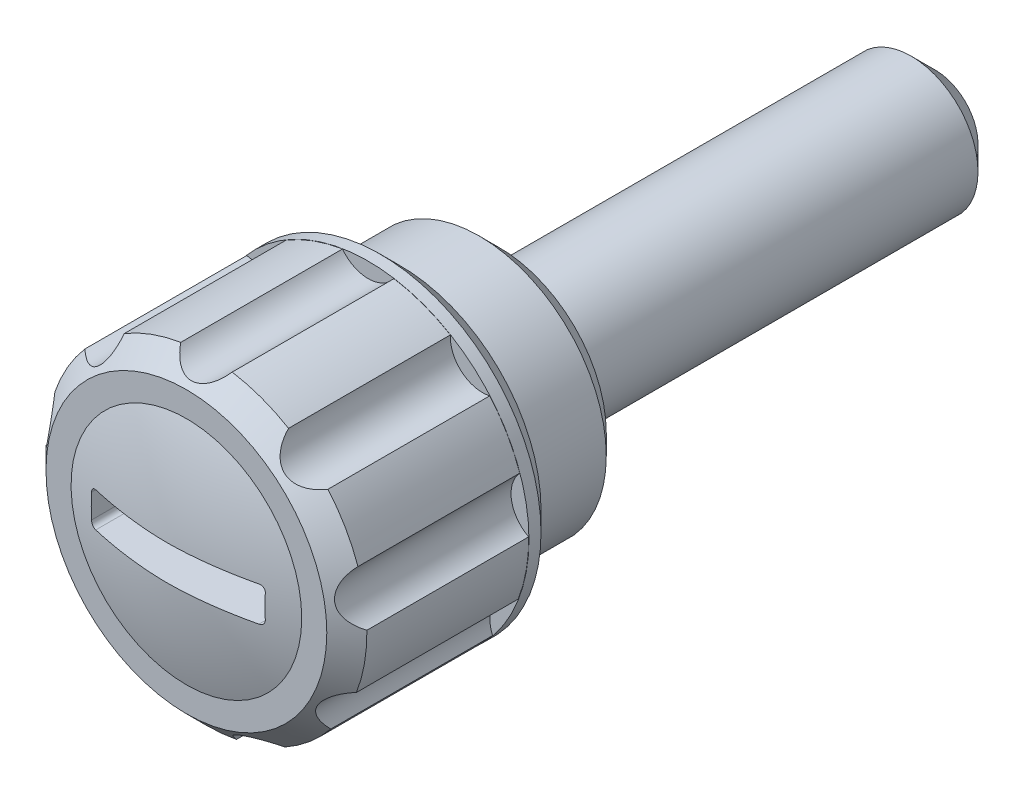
ISO-10303-21;
HEADER;
FILE_DESCRIPTION(('STEP AP214'),'2;1');
FILE_NAME('part.step','',(''),(''),'','','');
FILE_SCHEMA(('AUTOMOTIVE_DESIGN { 1 0 10303 214 1 1 1 1 }'));
ENDSEC;
DATA;
#1=APPLICATION_CONTEXT('core data for automotive mechanical design processes');
#2=APPLICATION_PROTOCOL_DEFINITION('international standard','automotive_design',2000,#1);
#3=PRODUCT_CONTEXT('',#1,'mechanical');
#4=PRODUCT('Part','Part','',(#3));
#5=PRODUCT_RELATED_PRODUCT_CATEGORY('part','',(#4));
#6=PRODUCT_DEFINITION_FORMATION('','',#4);
#7=PRODUCT_DEFINITION_CONTEXT('part definition',#1,'design');
#8=PRODUCT_DEFINITION('design','',#6,#7);
#9=PRODUCT_DEFINITION_SHAPE('','',#8);
#10=(LENGTH_UNIT() NAMED_UNIT(*) SI_UNIT(.MILLI.,.METRE.));
#11=(NAMED_UNIT(*) PLANE_ANGLE_UNIT() SI_UNIT($,.RADIAN.));
#12=(NAMED_UNIT(*) SI_UNIT($,.STERADIAN.) SOLID_ANGLE_UNIT());
#13=UNCERTAINTY_MEASURE_WITH_UNIT(LENGTH_MEASURE(1.E-05),#10,'distance_accuracy_value','');
#14=(GEOMETRIC_REPRESENTATION_CONTEXT(3) GLOBAL_UNCERTAINTY_ASSIGNED_CONTEXT((#13)) GLOBAL_UNIT_ASSIGNED_CONTEXT((#10,
#11,#12)) REPRESENTATION_CONTEXT('',''));
#15=CARTESIAN_POINT('',(0.,0.,0.));
#16=DIRECTION('',(0.,0.,1.));
#17=DIRECTION('',(1.,0.,0.));
#18=AXIS2_PLACEMENT_3D('',#15,#16,#17);
#19=CARTESIAN_POINT('',(0.,0.,-2.24502330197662));
#20=DIRECTION('',(0.,0.,1.));
#21=DIRECTION('',(1.,0.,0.));
#22=AXIS2_PLACEMENT_3D('',#19,#20,#21);
#23=DEGENERATE_TOROIDAL_SURFACE('',#22,0.386362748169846,14.9999999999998,.F.);
#24=CARTESIAN_POINT('',(0.,0.,12.));
#25=DIRECTION('',(0.,0.,1.));
#26=DIRECTION('',(1.,0.,0.));
#27=AXIS2_PLACEMENT_3D('',#24,#25,#26);
#28=CIRCLE('',#27,4.3125);
#29=CARTESIAN_POINT('',(4.3125,0.,12.));
#30=VERTEX_POINT('',#29);
#31=EDGE_CURVE('E351',#30,#30,#28,.T.);
#32=ORIENTED_EDGE('',*,*,#31,.T.);
#33=EDGE_LOOP('',(#32));
#34=FACE_BOUND('',#33,.T.);
#35=CARTESIAN_POINT('',(-3.0498,-0.649999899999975,12.3398097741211));
#36=CARTESIAN_POINT('',(-3.06120822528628,-0.650019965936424,12.3371277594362));
#37=CARTESIAN_POINT('',(-3.07262553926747,-0.649047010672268,12.3344789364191));
#38=CARTESIAN_POINT('',(-3.09516164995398,-0.645167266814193,12.3293198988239));
#39=CARTESIAN_POINT('',(-3.10628037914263,-0.642260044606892,12.326809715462));
#40=CARTESIAN_POINT('',(-3.1279071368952,-0.634560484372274,12.3219992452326));
#41=CARTESIAN_POINT('',(-3.13841459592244,-0.629766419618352,12.3196991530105));
#42=CARTESIAN_POINT('',(-3.15848770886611,-0.618413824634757,12.3153819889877));
#43=CARTESIAN_POINT('',(-3.16805381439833,-0.611856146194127,12.3133647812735));
#44=CARTESIAN_POINT('',(-3.18579781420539,-0.59727066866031,12.3097075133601));
#45=CARTESIAN_POINT('',(-3.19399634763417,-0.589269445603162,12.308061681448));
#46=CARTESIAN_POINT('',(-3.20893719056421,-0.571941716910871,12.3051577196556));
#47=CARTESIAN_POINT('',(-3.2156793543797,-0.562615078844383,12.303899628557));
#48=CARTESIAN_POINT('',(-3.22732440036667,-0.543172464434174,12.3018421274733));
#49=CARTESIAN_POINT('',(-3.23227144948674,-0.533084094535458,12.3010314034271));
#50=CARTESIAN_POINT('',(-3.24041051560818,-0.512202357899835,12.2998457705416));
#51=CARTESIAN_POINT('',(-3.24360397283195,-0.501409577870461,12.299470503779));
#52=CARTESIAN_POINT('',(-3.24725089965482,-0.483746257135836,12.2992265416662));
#53=CARTESIAN_POINT('',(-3.24828749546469,-0.476992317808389,12.2992171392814));
#54=CARTESIAN_POINT('',(-3.24966526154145,-0.4634255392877,12.2993633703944));
#55=CARTESIAN_POINT('',(-3.25000743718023,-0.456612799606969,12.2995187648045));
#56=CARTESIAN_POINT('',(-3.24999990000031,-0.449800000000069,12.2997561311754));
#57=B_SPLINE_CURVE_WITH_KNOTS('',3,(#35,#36,#37,#38,#39,#40,#41,#42,#43,#44,#45,#46,#47,#48,#49,
#50,#51,#52,#53,#54,#55,#56),.UNSPECIFIED.,.F.,.F.,(4,2,2,2,2,2,2,2,2,2,4),(0.,
0.0351172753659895,0.0702424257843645,0.10539979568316,0.140540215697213,0.175089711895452,
0.209642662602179,0.243276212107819,0.276882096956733,0.297346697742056,0.317781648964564),.UNSPECIFIED.);
#58=CARTESIAN_POINT('',(-3.05,-0.65,12.3397627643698));
#59=VERTEX_POINT('',#58);
#60=CARTESIAN_POINT('',(-3.25,-0.45,12.2997491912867));
#61=VERTEX_POINT('',#60);
#62=EDGE_CURVE('E462',#59,#61,#57,.T.);
#63=ORIENTED_EDGE('',*,*,#62,.T.);
#64=CARTESIAN_POINT('',(-3.25,0.,12.3075320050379));
#65=CARTESIAN_POINT('',(-3.25,0.277728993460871,12.3075356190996));
#66=CARTESIAN_POINT('',(-3.25,0.555440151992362,12.2986179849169));
#67=CARTESIAN_POINT('',(-3.25,1.10971337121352,12.2631914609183));
#68=CARTESIAN_POINT('',(-3.25,1.38627553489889,12.2366841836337));
#69=CARTESIAN_POINT('',(-3.25,1.93745588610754,12.1665755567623));
#70=CARTESIAN_POINT('',(-3.25,2.21207222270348,12.122959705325));
#71=CARTESIAN_POINT('',(-3.25,2.75819405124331,12.019207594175));
#72=CARTESIAN_POINT('',(-3.25,3.02969897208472,11.9590683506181));
#73=CARTESIAN_POINT('',(-3.25,3.68907942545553,11.7923343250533));
#74=CARTESIAN_POINT('',(-3.25,4.07477310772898,11.6769874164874));
#75=CARTESIAN_POINT('',(-3.25,4.83507528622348,11.4141726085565));
#76=CARTESIAN_POINT('',(-3.25,5.20968196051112,11.2666994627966));
#77=CARTESIAN_POINT('',(-3.25,5.94561682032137,10.9408021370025));
#78=CARTESIAN_POINT('',(-3.25,6.30693188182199,10.7623483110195));
#79=CARTESIAN_POINT('',(-3.25,7.013278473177,10.3760839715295));
#80=CARTESIAN_POINT('',(-3.25,7.35831779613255,10.1682877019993));
#81=CARTESIAN_POINT('',(-3.25,8.03118455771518,9.72399493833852));
#82=CARTESIAN_POINT('',(-3.25,8.35894545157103,9.48739766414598));
#83=CARTESIAN_POINT('',(-3.25,8.99368126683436,8.98778857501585));
#84=CARTESIAN_POINT('',(-3.25,9.30065586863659,8.72477635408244));
#85=CARTESIAN_POINT('',(-3.25,9.8916546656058,8.1742495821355));
#86=CARTESIAN_POINT('',(-3.25,10.1756840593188,7.88674061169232));
#87=CARTESIAN_POINT('',(-3.25,10.7189336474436,7.2891687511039));
#88=CARTESIAN_POINT('',(-3.25,10.9781537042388,6.97910573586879));
#89=CARTESIAN_POINT('',(-3.25,11.4737062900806,6.33376323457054));
#90=CARTESIAN_POINT('',(-3.25,11.7096373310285,5.9981753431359));
#91=CARTESIAN_POINT('',(-3.25,12.1524595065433,5.30835452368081));
#92=CARTESIAN_POINT('',(-3.25,12.3593503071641,4.95412138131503));
#93=CARTESIAN_POINT('',(-3.25,12.7426542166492,4.22948724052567));
#94=CARTESIAN_POINT('',(-3.25,12.9190643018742,3.85908464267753));
#95=CARTESIAN_POINT('',(-3.25,13.2401398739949,3.10476845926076));
#96=CARTESIAN_POINT('',(-3.25,13.3848053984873,2.72085488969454));
#97=CARTESIAN_POINT('',(-3.25,13.6416809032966,1.94130139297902));
#98=CARTESIAN_POINT('',(-3.25,13.753812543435,1.5456356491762));
#99=CARTESIAN_POINT('',(-3.25,13.944363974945,0.746267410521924));
#100=CARTESIAN_POINT('',(-3.25,14.0227836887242,0.342564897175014));
#101=CARTESIAN_POINT('',(-3.25,14.1453548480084,-0.469998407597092));
#102=CARTESIAN_POINT('',(-3.25,14.1895071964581,-0.8788590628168));
#103=CARTESIAN_POINT('',(-3.25,14.2432347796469,-1.69884576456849));
#104=CARTESIAN_POINT('',(-3.25,14.2528100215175,-2.10997181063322));
#105=CARTESIAN_POINT('',(-3.25,14.2373111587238,-2.93180992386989));
#106=CARTESIAN_POINT('',(-3.25,14.2122168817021,-3.34252161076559));
#107=CARTESIAN_POINT('',(-3.25,14.1275207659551,-4.16037161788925));
#108=CARTESIAN_POINT('',(-3.25,14.0679189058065,-4.56750993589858));
#109=CARTESIAN_POINT('',(-3.25,13.9146256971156,-5.37533907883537));
#110=CARTESIAN_POINT('',(-3.25,13.8209326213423,-5.77602957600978));
#111=CARTESIAN_POINT('',(-3.25,13.6001207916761,-6.568092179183));
#112=CARTESIAN_POINT('',(-3.25,13.4730020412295,-6.95946428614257));
#113=CARTESIAN_POINT('',(-3.25,13.186232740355,-7.7301217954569));
#114=CARTESIAN_POINT('',(-3.25,13.0265808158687,-8.10940668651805));
#115=CARTESIAN_POINT('',(-3.25,12.6758786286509,-8.85317181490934));
#116=CARTESIAN_POINT('',(-3.25,12.4848283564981,-9.21765204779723));
#117=CARTESIAN_POINT('',(-3.25,12.072711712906,-9.92915798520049));
#118=CARTESIAN_POINT('',(-3.25,11.8516496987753,-10.2761862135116));
#119=CARTESIAN_POINT('',(-3.25,11.3810523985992,-10.9503675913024));
#120=CARTESIAN_POINT('',(-3.25,11.1315171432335,-11.2775207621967));
#121=CARTESIAN_POINT('',(-3.25,10.6059307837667,-11.9093794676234));
#122=CARTESIAN_POINT('',(-3.25,10.3298992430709,-12.2141012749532));
#123=CARTESIAN_POINT('',(-3.25,9.75311451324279,-12.7991756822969));
#124=CARTESIAN_POINT('',(-3.25,9.45236128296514,-13.0795282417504));
#125=CARTESIAN_POINT('',(-3.25,8.82813062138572,-13.6139441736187));
#126=CARTESIAN_POINT('',(-3.25,8.50464416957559,-13.8679970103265));
#127=CARTESIAN_POINT('',(-3.25,7.8373363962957,-14.3478241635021));
#128=CARTESIAN_POINT('',(-3.25,7.49351512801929,-14.573598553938));
#129=CARTESIAN_POINT('',(-3.25,6.78879460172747,-14.9946762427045));
#130=CARTESIAN_POINT('',(-3.25,6.42793763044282,-15.1900503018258));
#131=CARTESIAN_POINT('',(-3.25,5.69092259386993,-15.5494366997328));
#132=CARTESIAN_POINT('',(-3.25,5.31476441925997,-15.7134488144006));
#133=CARTESIAN_POINT('',(-3.25,4.54996490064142,-16.0086112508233));
#134=CARTESIAN_POINT('',(-3.25,4.16132971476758,-16.1397775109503));
#135=CARTESIAN_POINT('',(-3.25,3.37414151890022,-16.367940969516));
#136=CARTESIAN_POINT('',(-3.25,2.97558824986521,-16.4649372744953));
#137=CARTESIAN_POINT('',(-3.25,2.17796770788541,-16.6218590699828));
#138=CARTESIAN_POINT('',(-3.25,1.77901685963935,-16.682368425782));
#139=CARTESIAN_POINT('',(-3.25,1.17783289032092,-16.7458571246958));
#140=CARTESIAN_POINT('',(-3.25,0.976962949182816,-16.7624743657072));
#141=CARTESIAN_POINT('',(-3.25,0.574677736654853,-16.7864370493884));
#142=CARTESIAN_POINT('',(-3.25,0.373262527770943,-16.7937835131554));
#143=CARTESIAN_POINT('',(-3.25,-0.0296307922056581,-16.7991040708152));
#144=CARTESIAN_POINT('',(-3.25,-0.231108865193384,-16.7970810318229));
#145=CARTESIAN_POINT('',(-3.25,-0.633740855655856,-16.7837024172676));
#146=CARTESIAN_POINT('',(-3.25,-0.834894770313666,-16.7723467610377));
#147=CARTESIAN_POINT('',(-3.25,-1.43727360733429,-16.7244784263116));
#148=CARTESIAN_POINT('',(-3.25,-1.83748615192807,-16.6741652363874));
#149=CARTESIAN_POINT('',(-3.25,-2.60244344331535,-16.5434913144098));
#150=CARTESIAN_POINT('',(-3.25,-2.9676242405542,-16.465624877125));
#151=CARTESIAN_POINT('',(-3.25,-3.69061293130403,-16.2811099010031));
#152=CARTESIAN_POINT('',(-3.25,-4.04842149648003,-16.1744639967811));
#153=CARTESIAN_POINT('',(-3.25,-4.75476881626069,-15.9334225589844));
#154=CARTESIAN_POINT('',(-3.25,-5.10330243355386,-15.7990119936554));
#155=CARTESIAN_POINT('',(-3.25,-5.78889033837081,-15.5035347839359));
#156=CARTESIAN_POINT('',(-3.25,-6.12594408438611,-15.3424668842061));
#157=CARTESIAN_POINT('',(-3.25,-6.80932679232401,-14.9828170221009));
#158=CARTESIAN_POINT('',(-3.25,-7.15470066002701,-14.7824174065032));
#159=CARTESIAN_POINT('',(-3.25,-7.82779768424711,-14.3538815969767));
#160=CARTESIAN_POINT('',(-3.25,-8.15552013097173,-14.1257442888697));
#161=CARTESIAN_POINT('',(-3.25,-8.79107255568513,-13.6433774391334));
#162=CARTESIAN_POINT('',(-3.25,-9.09890611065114,-13.3891526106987));
#163=CARTESIAN_POINT('',(-3.25,-9.69269581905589,-12.8563257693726));
#164=CARTESIAN_POINT('',(-3.25,-9.97865187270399,-12.5777236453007));
#165=CARTESIAN_POINT('',(-3.25,-10.5337680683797,-11.9906483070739));
#166=CARTESIAN_POINT('',(-3.25,-10.8023152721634,-11.6815951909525));
#167=CARTESIAN_POINT('',(-3.25,-11.3125257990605,-11.0420356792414));
#168=CARTESIAN_POINT('',(-3.25,-11.5541885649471,-10.7115288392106));
#169=CARTESIAN_POINT('',(-3.25,-12.0089741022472,-10.0313455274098));
#170=CARTESIAN_POINT('',(-3.25,-12.2220918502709,-9.6816656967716));
#171=CARTESIAN_POINT('',(-3.25,-12.6182423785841,-8.96566280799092));
#172=CARTESIAN_POINT('',(-3.25,-12.8012752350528,-8.59933979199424));
#173=CARTESIAN_POINT('',(-3.25,-13.1366167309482,-7.85119993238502));
#174=CARTESIAN_POINT('',(-3.25,-13.2888047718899,-7.46932902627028));
#175=CARTESIAN_POINT('',(-3.25,-13.5604975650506,-6.69413124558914));
#176=CARTESIAN_POINT('',(-3.25,-13.680002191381,-6.30080432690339));
#177=CARTESIAN_POINT('',(-3.25,-13.885478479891,-5.505506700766));
#178=CARTESIAN_POINT('',(-3.25,-13.9714517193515,-5.10353640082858));
#179=CARTESIAN_POINT('',(-3.25,-14.1092657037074,-4.29378701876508));
#180=CARTESIAN_POINT('',(-3.25,-14.1611064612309,-3.88600793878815));
#181=CARTESIAN_POINT('',(-3.25,-14.2303212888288,-3.06715435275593));
#182=CARTESIAN_POINT('',(-3.25,-14.2476633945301,-2.65607714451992));
#183=CARTESIAN_POINT('',(-3.25,-14.2476620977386,-1.83392251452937));
#184=CARTESIAN_POINT('',(-3.25,-14.2303186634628,-1.42284509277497));
#185=CARTESIAN_POINT('',(-3.25,-14.1610682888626,-0.603603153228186));
#186=CARTESIAN_POINT('',(-3.25,-14.1091606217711,-0.195438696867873));
#187=CARTESIAN_POINT('',(-3.25,-13.9711485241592,0.615067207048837));
#188=CARTESIAN_POINT('',(-3.25,-13.885044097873,1.01740865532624));
#189=CARTESIAN_POINT('',(-3.25,-13.6792331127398,1.81346557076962));
#190=CARTESIAN_POINT('',(-3.25,-13.5595217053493,2.20717978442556));
#191=CARTESIAN_POINT('',(-3.25,-13.2873494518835,2.98312116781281));
#192=CARTESIAN_POINT('',(-3.25,-13.1348885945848,3.36534833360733));
#193=CARTESIAN_POINT('',(-3.25,-12.7982999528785,4.11558729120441));
#194=CARTESIAN_POINT('',(-3.25,-12.6141727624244,4.48359934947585));
#195=CARTESIAN_POINT('',(-3.25,-12.2155528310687,5.20279306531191));
#196=CARTESIAN_POINT('',(-3.25,-12.0010601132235,5.55397473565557));
#197=CARTESIAN_POINT('',(-3.25,-11.5433180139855,6.2368658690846));
#198=CARTESIAN_POINT('',(-3.25,-11.3000801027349,6.56858302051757));
#199=CARTESIAN_POINT('',(-3.25,-10.7864981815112,7.2103264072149));
#200=CARTESIAN_POINT('',(-3.25,-10.5161541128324,7.52035259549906));
#201=CARTESIAN_POINT('',(-3.25,-9.95025306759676,8.11650757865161));
#202=CARTESIAN_POINT('',(-3.25,-9.65469453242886,8.4026348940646));
#203=CARTESIAN_POINT('',(-3.25,-9.04046877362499,8.94890264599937));
#204=CARTESIAN_POINT('',(-3.25,-8.72180175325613,9.20904331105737));
#205=CARTESIAN_POINT('',(-3.25,-8.06411837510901,9.70105813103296));
#206=CARTESIAN_POINT('',(-3.25,-7.72513441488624,9.93297559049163));
#207=CARTESIAN_POINT('',(-3.25,-7.02875492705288,10.3672880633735));
#208=CARTESIAN_POINT('',(-3.25,-6.67135962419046,10.5696834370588));
#209=CARTESIAN_POINT('',(-3.25,-5.94066060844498,10.9433896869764));
#210=CARTESIAN_POINT('',(-3.25,-5.56735649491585,11.1146997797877));
#211=CARTESIAN_POINT('',(-3.25,-4.80749189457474,11.4247686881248));
#212=CARTESIAN_POINT('',(-3.25,-4.42093314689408,11.5635317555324));
#213=CARTESIAN_POINT('',(-3.25,-3.70318039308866,11.786627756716));
#214=CARTESIAN_POINT('',(-3.25,-3.37360154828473,11.876189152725));
#215=CARTESIAN_POINT('',(-3.25,-2.70877137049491,12.0309482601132));
#216=CARTESIAN_POINT('',(-3.25,-2.37352047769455,12.0961478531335));
#217=CARTESIAN_POINT('',(-3.25,-1.69957377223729,12.2010954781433));
#218=CARTESIAN_POINT('',(-3.25,-1.36088404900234,12.2408824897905));
#219=CARTESIAN_POINT('',(-3.25,-0.681453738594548,12.2940966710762));
#220=CARTESIAN_POINT('',(-3.25,-0.340713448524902,12.3075275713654));
#221=CARTESIAN_POINT('',(-3.25,0.,12.3075320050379));
#222=B_SPLINE_CURVE_WITH_KNOTS('',3,(#64,#65,#66,#67,#68,#69,#70,#71,#72,#73,#74,#75,#76,#77,
#78,#79,#80,#81,#82,#83,#84,#85,#86,#87,#88,#89,#90,#91,#92,#93,#94,#95,#96,#97,#98,#99,#100,
#101,#102,#103,#104,#105,#106,#107,#108,#109,#110,#111,#112,#113,#114,#115,#116,#117,#118,#119,
#120,#121,#122,#123,#124,#125,#126,#127,#128,#129,#130,#131,#132,#133,#134,#135,#136,#137,#138,
#139,#140,#141,#142,#143,#144,#145,#146,#147,#148,#149,#150,#151,#152,#153,#154,#155,#156,#157,
#158,#159,#160,#161,#162,#163,#164,#165,#166,#167,#168,#169,#170,#171,#172,#173,#174,#175,#176,
#177,#178,#179,#180,#181,#182,#183,#184,#185,#186,#187,#188,#189,#190,#191,#192,#193,#194,#195,
#196,#197,#198,#199,#200,#201,#202,#203,#204,#205,#206,#207,#208,#209,#210,#211,#212,#213,#214,
#215,#216,#217,#218,#219,#220,#221),.UNSPECIFIED.,.T.,.F.,(4,2,2,2,2,2,2,2,2,2,2,2,2,2,2,2,2,2,
2,2,2,2,2,2,2,2,2,2,2,2,2,2,2,2,2,2,2,2,2,2,2,2,2,2,2,2,2,2,2,2,2,2,2,2,2,2,2,2,2,2,2,2,2,2,2,2,
2,2,2,2,2,2,2,2,2,2,2,2,4),(0.,0.833015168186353,1.66595398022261,2.49960035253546,
3.33339736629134,4.53957397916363,5.74594771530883,6.95348227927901,8.16043266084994,
9.37173482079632,10.583055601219,11.7941011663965,13.0051534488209,14.2343656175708,
15.4635919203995,16.6929400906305,17.9222868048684,19.15456962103,20.3868552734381,
21.6191084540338,22.8513613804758,24.0843315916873,25.3173025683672,26.5503360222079,
27.7833693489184,29.01645476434,30.2495405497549,31.4824474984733,32.7153531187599,
33.9473553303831,35.1793595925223,36.4118555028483,37.6443481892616,38.8739277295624,
40.1035160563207,41.3325065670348,42.5615292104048,43.7703236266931,44.3748145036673,
44.97923879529,45.583478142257,46.1877227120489,47.3960010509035,48.5150195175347,
49.6339355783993,50.7534590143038,51.8730351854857,53.0695719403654,54.2661567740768,
55.4625258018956,56.658900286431,57.8857327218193,59.1125905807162,60.3396640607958,
61.5667344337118,62.7985136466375,64.0302976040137,65.2620236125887,66.4937491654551,
67.7266154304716,68.9594828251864,70.1923761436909,71.4252693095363,72.6583404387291,
73.8914119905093,75.1244604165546,76.3575079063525,77.5900650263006,78.8226248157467,
80.05526085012,81.2878860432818,82.5185954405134,83.7492898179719,84.9800152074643,
86.2105797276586,87.2343070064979,88.2579551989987,89.2800294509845,90.3019590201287),.UNSPECIFIED.);
#223=CARTESIAN_POINT('',(-3.25,0.45,12.2997491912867));
#224=VERTEX_POINT('',#223);
#225=EDGE_CURVE('E194',#61,#224,#222,.T.);
#226=ORIENTED_EDGE('',*,*,#225,.T.);
#227=CARTESIAN_POINT('',(-3.24999989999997,0.4498,12.2997561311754));
#228=CARTESIAN_POINT('',(-3.25002147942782,0.460776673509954,12.2993714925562));
#229=CARTESIAN_POINT('',(-3.24911882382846,0.471758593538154,12.2992032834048));
#230=CARTESIAN_POINT('',(-3.24553635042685,0.493412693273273,12.2992941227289));
#231=CARTESIAN_POINT('',(-3.24285883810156,0.504085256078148,12.299552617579));
#232=CARTESIAN_POINT('',(-3.23579622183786,0.524834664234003,12.3004904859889));
#233=CARTESIAN_POINT('',(-3.23141042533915,0.53491126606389,12.3011700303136));
#234=CARTESIAN_POINT('',(-3.22107038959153,0.554184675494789,12.3029273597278));
#235=CARTESIAN_POINT('',(-3.21511623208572,0.563381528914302,12.3040051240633));
#236=CARTESIAN_POINT('',(-3.20177417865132,0.580709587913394,12.3065339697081));
#237=CARTESIAN_POINT('',(-3.19437690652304,0.588833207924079,12.3079875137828));
#238=CARTESIAN_POINT('',(-3.17839327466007,0.603735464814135,12.3112205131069));
#239=CARTESIAN_POINT('',(-3.16980667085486,0.610513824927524,12.3130000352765));
#240=CARTESIAN_POINT('',(-3.15148706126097,0.62269653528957,12.3168763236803));
#241=CARTESIAN_POINT('',(-3.14173272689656,0.628066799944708,12.3189792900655));
#242=CARTESIAN_POINT('',(-3.12151319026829,0.637105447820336,12.3234120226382));
#243=CARTESIAN_POINT('',(-3.11104805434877,0.640773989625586,12.3257417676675));
#244=CARTESIAN_POINT('',(-3.09210451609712,0.64570458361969,12.3300193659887));
#245=CARTESIAN_POINT('',(-3.08370936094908,0.647322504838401,12.3319350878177));
#246=CARTESIAN_POINT('',(-3.06680849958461,0.649474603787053,12.3358309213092));
#247=CARTESIAN_POINT('',(-3.05830296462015,0.650010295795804,12.3378109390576));
#248=CARTESIAN_POINT('',(-3.0498,0.649999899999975,12.3398097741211));
#249=B_SPLINE_CURVE_WITH_KNOTS('',3,(#227,#228,#229,#230,#231,#232,#233,#234,#235,#236,#237,
#238,#239,#240,#241,#242,#243,#244,#245,#246,#247,#248),.UNSPECIFIED.,.F.,.F.,(4,2,2,2,2,2,2,2,
2,2,4),(0.,0.0329053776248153,0.0657680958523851,0.0986441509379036,0.13151849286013,
0.1646140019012,0.197716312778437,0.231558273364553,0.265397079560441,0.291616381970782,
0.31779897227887),.UNSPECIFIED.);
#250=CARTESIAN_POINT('',(-3.04999999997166,0.65,12.3397627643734));
#251=VERTEX_POINT('',#250);
#252=EDGE_CURVE('E416',#224,#251,#249,.T.);
#253=ORIENTED_EDGE('',*,*,#252,.T.);
#254=CARTESIAN_POINT('',(0.,0.65,12.7191322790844));
#255=CARTESIAN_POINT('',(0.108520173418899,0.65,12.7191277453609));
#256=CARTESIAN_POINT('',(0.217041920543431,0.65,12.7172094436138));
#257=CARTESIAN_POINT('',(0.433997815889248,0.65,12.7099981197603));
#258=CARTESIAN_POINT('',(0.542431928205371,0.65,12.7047040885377));
#259=CARTESIAN_POINT('',(0.759555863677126,0.65,12.6912706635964));
#260=CARTESIAN_POINT('',(0.868244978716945,0.65,12.6831199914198));
#261=CARTESIAN_POINT('',(1.08539837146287,0.65,12.6642185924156));
#262=CARTESIAN_POINT('',(1.19386263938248,0.65,12.6534677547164));
#263=CARTESIAN_POINT('',(1.51887735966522,0.65,12.6174925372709));
#264=CARTESIAN_POINT('',(1.73502604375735,0.65,12.5885469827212));
#265=CARTESIAN_POINT('',(2.16611297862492,0.65,12.5210525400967));
#266=CARTESIAN_POINT('',(2.38104917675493,0.65,12.4824906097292));
#267=CARTESIAN_POINT('',(2.80901885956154,0.65,12.3959374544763));
#268=CARTESIAN_POINT('',(3.02205219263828,0.65,12.3479454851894));
#269=CARTESIAN_POINT('',(3.64169701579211,0.65,12.1939819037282));
#270=CARTESIAN_POINT('',(4.04525595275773,0.65,12.0754170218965));
#271=CARTESIAN_POINT('',(4.84106887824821,0.65,11.804706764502));
#272=CARTESIAN_POINT('',(5.23331827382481,0.65,11.6525479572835));
#273=CARTESIAN_POINT('',(6.00390173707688,0.65,11.3156534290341));
#274=CARTESIAN_POINT('',(6.382226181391,0.65,11.1308956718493));
#275=CARTESIAN_POINT('',(7.12194189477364,0.65,10.7302214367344));
#276=CARTESIAN_POINT('',(7.48333496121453,0.65,10.5143082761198));
#277=CARTESIAN_POINT('',(8.18679974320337,0.65,10.0527629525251));
#278=CARTESIAN_POINT('',(8.52886465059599,0.65,9.80712041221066));
#279=CARTESIAN_POINT('',(9.19111928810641,0.65,9.28791513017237));
#280=CARTESIAN_POINT('',(9.51130841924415,0.65,9.01435162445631));
#281=CARTESIAN_POINT('',(10.1275007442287,0.65,8.44128082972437));
#282=CARTESIAN_POINT('',(10.4235063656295,0.65,8.14177615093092));
#283=CARTESIAN_POINT('',(10.9892674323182,0.65,7.51892636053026));
#284=CARTESIAN_POINT('',(11.2590230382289,0.65,7.19558139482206));
#285=CARTESIAN_POINT('',(11.7706885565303,0.65,6.52693164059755));
#286=CARTESIAN_POINT('',(12.012563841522,0.65,6.18160035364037));
#287=CARTESIAN_POINT('',(12.4663665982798,0.65,5.47179015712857));
#288=CARTESIAN_POINT('',(12.6782939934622,0.65,5.10731119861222));
#289=CARTESIAN_POINT('',(13.0706918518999,0.65,4.36180202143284));
#290=CARTESIAN_POINT('',(13.2511627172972,0.65,3.98077201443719));
#291=CARTESIAN_POINT('',(13.5793682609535,0.65,3.20486500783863));
#292=CARTESIAN_POINT('',(13.7271029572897,0.65,2.80998801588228));
#293=CARTESIAN_POINT('',(13.988800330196,0.65,2.00915107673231));
#294=CARTESIAN_POINT('',(14.1027594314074,0.65,1.60318996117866));
#295=CARTESIAN_POINT('',(14.2960746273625,0.65,0.783110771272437));
#296=CARTESIAN_POINT('',(14.3754307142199,0.65,0.368992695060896));
#297=CARTESIAN_POINT('',(14.498977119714,0.65,-0.464465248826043));
#298=CARTESIAN_POINT('',(14.5431666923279,0.65,-0.883805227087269));
#299=CARTESIAN_POINT('',(14.596063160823,0.65,-1.72471716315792));
#300=CARTESIAN_POINT('',(14.6047700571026,0.65,-2.1462891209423));
#301=CARTESIAN_POINT('',(14.5866390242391,0.65,-2.98868011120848));
#302=CARTESIAN_POINT('',(14.5598000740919,0.65,-3.40949912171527));
#303=CARTESIAN_POINT('',(14.4707663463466,0.65,-4.24738022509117));
#304=CARTESIAN_POINT('',(14.4085715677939,0.65,-4.66444231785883));
#305=CARTESIAN_POINT('',(14.2492707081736,0.65,-5.49183187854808));
#306=CARTESIAN_POINT('',(14.1521656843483,0.65,-5.90215955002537));
#307=CARTESIAN_POINT('',(13.92373427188,0.65,-6.7131760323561));
#308=CARTESIAN_POINT('',(13.7924078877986,0.65,-7.11386484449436));
#309=CARTESIAN_POINT('',(13.4964692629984,0.65,-7.90274953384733));
#310=CARTESIAN_POINT('',(13.3318574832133,0.65,-8.29094558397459));
#311=CARTESIAN_POINT('',(12.9705168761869,0.65,-9.05209088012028));
#312=CARTESIAN_POINT('',(12.7737880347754,0.65,-9.42504011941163));
#313=CARTESIAN_POINT('',(12.3495993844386,0.65,-10.1530610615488));
#314=CARTESIAN_POINT('',(12.1221378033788,0.65,-10.5081317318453));
#315=CARTESIAN_POINT('',(11.6381096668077,0.65,-11.1978469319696));
#316=CARTESIAN_POINT('',(11.3815431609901,0.65,-11.5324914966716));
#317=CARTESIAN_POINT('',(10.8411381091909,0.65,-12.1789638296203));
#318=CARTESIAN_POINT('',(10.5573005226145,0.65,-12.4907923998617));
#319=CARTESIAN_POINT('',(9.9643609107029,0.65,-13.0894299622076));
#320=CARTESIAN_POINT('',(9.65525870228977,0.65,-13.3762387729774));
#321=CARTESIAN_POINT('',(9.01399860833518,0.65,-13.9227850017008));
#322=CARTESIAN_POINT('',(8.681841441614,0.65,-14.1825232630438));
#323=CARTESIAN_POINT('',(7.99683299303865,0.65,-14.6730822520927));
#324=CARTESIAN_POINT('',(7.64398231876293,0.65,-14.9039038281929));
#325=CARTESIAN_POINT('',(6.92002553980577,0.65,-15.335028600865));
#326=CARTESIAN_POINT('',(6.5489163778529,0.65,-15.5353266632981));
#327=CARTESIAN_POINT('',(5.79113277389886,0.65,-15.903924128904));
#328=CARTESIAN_POINT('',(5.40445847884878,0.65,-16.0722238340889));
#329=CARTESIAN_POINT('',(4.61839618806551,0.65,-16.3755712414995));
#330=CARTESIAN_POINT('',(4.21901109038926,0.65,-16.5106264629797));
#331=CARTESIAN_POINT('',(3.41037855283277,0.65,-16.7464936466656));
#332=CARTESIAN_POINT('',(3.00113546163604,0.65,-16.8473204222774));
#333=CARTESIAN_POINT('',(2.37474825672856,0.65,-16.9737106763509));
#334=CARTESIAN_POINT('',(2.16011736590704,0.65,-17.0121235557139));
#335=CARTESIAN_POINT('',(1.72933145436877,0.65,-17.0793970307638));
#336=CARTESIAN_POINT('',(1.51317639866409,0.65,-17.1082574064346));
#337=CARTESIAN_POINT('',(1.1883245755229,0.65,-17.1440821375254));
#338=CARTESIAN_POINT('',(1.08002619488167,0.65,-17.1547737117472));
#339=CARTESIAN_POINT('',(0.863198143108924,0.65,-17.1735629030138));
#340=CARTESIAN_POINT('',(0.754668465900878,0.65,-17.1816604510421));
#341=CARTESIAN_POINT('',(0.537464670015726,0.65,-17.1950151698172));
#342=CARTESIAN_POINT('',(0.42879060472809,0.65,-17.2002731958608));
#343=CARTESIAN_POINT('',(0.211334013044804,0.65,-17.20738850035));
#344=CARTESIAN_POINT('',(0.102551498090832,0.65,-17.2092461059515));
#345=CARTESIAN_POINT('',(-0.098037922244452,0.65,-17.2091183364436));
#346=CARTESIAN_POINT('',(-0.189845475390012,0.65,-17.2076873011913));
#347=CARTESIAN_POINT('',(-0.373392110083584,0.65,-17.2023544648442));
#348=CARTESIAN_POINT('',(-0.465131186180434,0.65,-17.1984524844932));
#349=CARTESIAN_POINT('',(-0.648525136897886,0.65,-17.1885366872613));
#350=CARTESIAN_POINT('',(-0.740179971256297,0.65,-17.1825221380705));
#351=CARTESIAN_POINT('',(-0.923340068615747,0.65,-17.1685825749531));
#352=CARTESIAN_POINT('',(-1.01484533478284,0.65,-17.1606576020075));
#353=CARTESIAN_POINT('',(-1.28932831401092,0.65,-17.1341570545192));
#354=CARTESIAN_POINT('',(-1.47205047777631,0.65,-17.1128685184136));
#355=CARTESIAN_POINT('',(-1.83651738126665,0.65,-17.0634122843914));
#356=CARTESIAN_POINT('',(-2.01826229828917,0.65,-17.0352458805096));
#357=CARTESIAN_POINT('',(-2.38129600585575,0.65,-16.9720306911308));
#358=CARTESIAN_POINT('',(-2.56258014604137,0.65,-16.936955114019));
#359=CARTESIAN_POINT('',(-2.92371751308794,0.65,-16.8600846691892));
#360=CARTESIAN_POINT('',(-3.10357066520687,0.65,-16.8182894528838));
#361=CARTESIAN_POINT('',(-3.64033450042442,0.65,-16.6830040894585));
#362=CARTESIAN_POINT('',(-3.9947892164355,0.65,-16.57955495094));
#363=CARTESIAN_POINT('',(-4.71178689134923,0.65,-16.3411791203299));
#364=CARTESIAN_POINT('',(-5.07390702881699,0.65,-16.2049845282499));
#365=CARTESIAN_POINT('',(-5.78663052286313,0.65,-15.9049349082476));
#366=CARTESIAN_POINT('',(-6.13723052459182,0.65,-15.7410719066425));
#367=CARTESIAN_POINT('',(-6.82400082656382,0.65,-15.3870663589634));
#368=CARTESIAN_POINT('',(-7.16019896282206,0.65,-15.1969778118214));
#369=CARTESIAN_POINT('',(-7.81689468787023,0.65,-14.7914249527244));
#370=CARTESIAN_POINT('',(-8.13739298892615,0.65,-14.5759617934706));
#371=CARTESIAN_POINT('',(-8.7889588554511,0.65,-14.1003791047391));
#372=CARTESIAN_POINT('',(-9.118369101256,0.65,-13.8379842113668));
#373=CARTESIAN_POINT('',(-9.75396306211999,0.65,-13.2863857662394));
#374=CARTESIAN_POINT('',(-10.0601446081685,0.65,-12.9971797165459));
#375=CARTESIAN_POINT('',(-10.6473742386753,0.65,-12.3937305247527));
#376=CARTESIAN_POINT('',(-10.9283974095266,0.65,-12.0794631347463));
#377=CARTESIAN_POINT('',(-11.4629667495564,0.65,-11.4283824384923));
#378=CARTESIAN_POINT('',(-11.716513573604,0.65,-11.0915696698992));
#379=CARTESIAN_POINT('',(-12.1943966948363,0.65,-10.3976989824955));
#380=CARTESIAN_POINT('',(-12.4187257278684,0.65,-10.0406360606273));
#381=CARTESIAN_POINT('',(-12.836505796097,0.65,-9.30887820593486));
#382=CARTESIAN_POINT('',(-13.0299566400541,0.65,-8.93418316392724));
#383=CARTESIAN_POINT('',(-13.3845512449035,0.65,-8.1699401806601));
#384=CARTESIAN_POINT('',(-13.5457045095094,0.65,-7.78039664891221));
#385=CARTESIAN_POINT('',(-13.8346300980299,0.65,-6.98912166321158));
#386=CARTESIAN_POINT('',(-13.9624024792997,0.65,-6.58739023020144));
#387=CARTESIAN_POINT('',(-14.1836800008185,0.65,-5.77451590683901));
#388=CARTESIAN_POINT('',(-14.2771785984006,0.65,-5.36337123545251));
#389=CARTESIAN_POINT('',(-14.4292098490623,0.65,-4.53466691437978));
#390=CARTESIAN_POINT('',(-14.487742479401,0.65,-4.11710726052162));
#391=CARTESIAN_POINT('',(-14.5694291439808,0.65,-3.27850601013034));
#392=CARTESIAN_POINT('',(-14.5925801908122,0.65,-2.85746412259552));
#393=CARTESIAN_POINT('',(-14.6033296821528,0.65,-2.01492679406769));
#394=CARTESIAN_POINT('',(-14.5909281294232,0.65,-1.59343135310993));
#395=CARTESIAN_POINT('',(-14.5306606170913,0.65,-0.752983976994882));
#396=CARTESIAN_POINT('',(-14.4827946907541,0.65,-0.334032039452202));
#397=CARTESIAN_POINT('',(-14.351938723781,0.65,0.49835010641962));
#398=CARTESIAN_POINT('',(-14.2689486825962,0.65,0.911780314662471));
#399=CARTESIAN_POINT('',(-14.0684388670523,0.65,1.73016147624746));
#400=CARTESIAN_POINT('',(-13.9509206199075,0.65,2.13511280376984));
#401=CARTESIAN_POINT('',(-13.6821883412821,0.65,2.93367609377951));
#402=CARTESIAN_POINT('',(-13.5309743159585,0.65,3.32728805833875));
#403=CARTESIAN_POINT('',(-13.1959267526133,0.65,4.10037092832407));
#404=CARTESIAN_POINT('',(-13.0120935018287,0.65,4.47984195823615));
#405=CARTESIAN_POINT('',(-12.6131130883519,0.65,5.22194896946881));
#406=CARTESIAN_POINT('',(-12.3979659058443,0.65,5.58458494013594));
#407=CARTESIAN_POINT('',(-11.9378740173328,0.65,6.29046298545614));
#408=CARTESIAN_POINT('',(-11.6929276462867,0.65,6.63370397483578));
#409=CARTESIAN_POINT('',(-11.1749886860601,0.65,7.29832838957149));
#410=CARTESIAN_POINT('',(-10.9019961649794,0.65,7.61971186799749));
#411=CARTESIAN_POINT('',(-10.3299256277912,0.65,8.23831388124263));
#412=CARTESIAN_POINT('',(-10.0308495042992,0.65,8.53553416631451));
#413=CARTESIAN_POINT('',(-9.40871715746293,0.65,9.10372430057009));
#414=CARTESIAN_POINT('',(-9.08566069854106,0.65,9.37469389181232));
#415=CARTESIAN_POINT('',(-8.41785441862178,0.65,9.88845978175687));
#416=CARTESIAN_POINT('',(-8.07310383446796,0.65,10.1312550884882));
#417=CARTESIAN_POINT('',(-7.36438263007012,0.65,10.5869228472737));
#418=CARTESIAN_POINT('',(-7.00041275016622,0.65,10.799796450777));
#419=CARTESIAN_POINT('',(-6.25574024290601,0.65,11.1941576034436));
#420=CARTESIAN_POINT('',(-5.87503367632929,0.65,11.3756377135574));
#421=CARTESIAN_POINT('',(-5.09960838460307,0.65,11.7058730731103));
#422=CARTESIAN_POINT('',(-4.70488757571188,0.65,11.8546234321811));
#423=CARTESIAN_POINT('',(-3.90465475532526,0.65,12.118151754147));
#424=CARTESIAN_POINT('',(-3.49915214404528,0.65,12.2329583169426));
#425=CARTESIAN_POINT('',(-2.67985286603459,0.65,12.4278850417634));
#426=CARTESIAN_POINT('',(-2.26605705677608,0.65,12.5080087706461));
#427=CARTESIAN_POINT('',(-1.69646981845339,0.65,12.5931341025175));
#428=CARTESIAN_POINT('',(-1.54287539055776,0.65,12.6136119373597));
#429=CARTESIAN_POINT('',(-1.23513895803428,0.65,12.6495835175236));
#430=CARTESIAN_POINT('',(-1.08099712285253,0.65,12.6650786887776));
#431=CARTESIAN_POINT('',(-0.772511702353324,0.65,12.6907884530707));
#432=CARTESIAN_POINT('',(-0.618168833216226,0.65,12.7010114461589));
#433=CARTESIAN_POINT('',(-0.386454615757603,0.65,12.7116612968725));
#434=CARTESIAN_POINT('',(-0.309189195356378,0.65,12.7144304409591));
#435=CARTESIAN_POINT('',(-0.154616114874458,0.65,12.7181675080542));
#436=CARTESIAN_POINT('',(-0.0773084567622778,0.65,12.7191355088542));
#437=CARTESIAN_POINT('',(0.,0.65,12.7191322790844));
#438=B_SPLINE_CURVE_WITH_KNOTS('',3,(#254,#255,#256,#257,#258,#259,#260,#261,#262,#263,#264,
#265,#266,#267,#268,#269,#270,#271,#272,#273,#274,#275,#276,#277,#278,#279,#280,#281,#282,#283,
#284,#285,#286,#287,#288,#289,#290,#291,#292,#293,#294,#295,#296,#297,#298,#299,#300,#301,#302,
#303,#304,#305,#306,#307,#308,#309,#310,#311,#312,#313,#314,#315,#316,#317,#318,#319,#320,#321,
#322,#323,#324,#325,#326,#327,#328,#329,#330,#331,#332,#333,#334,#335,#336,#337,#338,#339,#340,
#341,#342,#343,#344,#345,#346,#347,#348,#349,#350,#351,#352,#353,#354,#355,#356,#357,#358,#359,
#360,#361,#362,#363,#364,#365,#366,#367,#368,#369,#370,#371,#372,#373,#374,#375,#376,#377,#378,
#379,#380,#381,#382,#383,#384,#385,#386,#387,#388,#389,#390,#391,#392,#393,#394,#395,#396,#397,
#398,#399,#400,#401,#402,#403,#404,#405,#406,#407,#408,#409,#410,#411,#412,#413,#414,#415,#416,
#417,#418,#419,#420,#421,#422,#423,#424,#425,#426,#427,#428,#429,#430,#431,#432,#433,#434,#435,
#436,#437),.UNSPECIFIED.,.T.,.F.,(4,2,2,2,2,2,2,2,2,2,2,2,2,2,2,2,2,2,2,2,2,2,2,2,2,2,2,2,2,2,2,
2,2,2,2,2,2,2,2,2,2,2,2,2,2,2,2,2,2,2,2,2,2,2,2,2,2,2,2,2,2,2,2,2,2,2,2,2,2,2,2,2,2,2,2,2,2,2,2,
2,2,2,2,2,2,2,2,2,2,2,2,4),(0.,0.325550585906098,0.651198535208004,0.978146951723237,
1.30510931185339,1.95910516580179,2.61399287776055,3.26893230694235,4.52915364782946,
5.78987977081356,7.05146140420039,8.31290880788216,9.57479780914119,10.8367213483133,
12.0985180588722,13.3603070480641,14.6236466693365,15.8869895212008,17.1503162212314,
18.4136422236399,19.6771019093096,20.9405618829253,22.2040486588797,23.4675354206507,
24.7310584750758,25.9945815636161,27.2580663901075,28.5215510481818,29.7850182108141,
31.048485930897,32.3120265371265,33.5755649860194,34.8390589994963,36.1025621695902,
37.366025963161,38.6294526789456,39.8930916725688,41.1567187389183,42.4200597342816,
43.6828532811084,44.3368060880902,44.9907739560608,45.3172246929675,45.64368411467,
45.9700451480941,46.296374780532,46.5717928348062,46.8472308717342,47.1227644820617,
47.3982921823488,47.9500163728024,48.5016368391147,49.0554399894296,49.6092718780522,
50.7159038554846,51.8754142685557,53.0352594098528,54.1927510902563,55.3501902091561,
56.6121057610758,57.8741390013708,59.1374084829,60.4006478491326,61.6642006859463,
62.9277613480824,64.1909496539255,65.4541357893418,66.7175629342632,67.9809909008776,
69.2445255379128,70.5080600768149,71.7715934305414,73.0351268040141,74.2986042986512,
75.5620815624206,76.8255477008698,78.0890146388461,79.3525522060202,80.6160867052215,
81.8795295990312,83.1429849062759,84.4064846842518,85.6699358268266,86.9336859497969,
88.1976247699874,89.4604955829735,90.7232364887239,91.1880404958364,91.6527113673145,
92.1166395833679,92.3485678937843,92.5804861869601),.UNSPECIFIED.);
#439=CARTESIAN_POINT('',(3.05,0.65,12.3397627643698));
#440=VERTEX_POINT('',#439);
#441=EDGE_CURVE('E427',#251,#440,#438,.T.);
#442=ORIENTED_EDGE('',*,*,#441,.T.);
#443=CARTESIAN_POINT('',(3.0498,0.649999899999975,12.3398097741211));
#444=CARTESIAN_POINT('',(3.06120822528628,0.650019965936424,12.3371277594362));
#445=CARTESIAN_POINT('',(3.07262553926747,0.649047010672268,12.3344789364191));
#446=CARTESIAN_POINT('',(3.09516164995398,0.645167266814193,12.3293198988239));
#447=CARTESIAN_POINT('',(3.10628037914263,0.642260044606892,12.326809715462));
#448=CARTESIAN_POINT('',(3.1279071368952,0.634560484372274,12.3219992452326));
#449=CARTESIAN_POINT('',(3.13841459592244,0.629766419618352,12.3196991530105));
#450=CARTESIAN_POINT('',(3.15848770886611,0.618413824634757,12.3153819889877));
#451=CARTESIAN_POINT('',(3.16805381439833,0.611856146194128,12.3133647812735));
#452=CARTESIAN_POINT('',(3.18579781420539,0.597270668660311,12.3097075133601));
#453=CARTESIAN_POINT('',(3.19399634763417,0.589269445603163,12.308061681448));
#454=CARTESIAN_POINT('',(3.20893719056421,0.571941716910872,12.3051577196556));
#455=CARTESIAN_POINT('',(3.2156793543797,0.562615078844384,12.303899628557));
#456=CARTESIAN_POINT('',(3.22732440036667,0.543172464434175,12.3018421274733));
#457=CARTESIAN_POINT('',(3.23227144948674,0.533084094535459,12.3010314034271));
#458=CARTESIAN_POINT('',(3.24041051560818,0.512202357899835,12.2998457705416));
#459=CARTESIAN_POINT('',(3.24360397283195,0.501409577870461,12.299470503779));
#460=CARTESIAN_POINT('',(3.24725089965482,0.483746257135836,12.2992265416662));
#461=CARTESIAN_POINT('',(3.24828749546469,0.476992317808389,12.2992171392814));
#462=CARTESIAN_POINT('',(3.24966526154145,0.4634255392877,12.2993633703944));
#463=CARTESIAN_POINT('',(3.25000743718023,0.456612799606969,12.2995187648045));
#464=CARTESIAN_POINT('',(3.24999990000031,0.449800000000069,12.2997561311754));
#465=B_SPLINE_CURVE_WITH_KNOTS('',3,(#443,#444,#445,#446,#447,#448,#449,#450,#451,#452,#453,
#454,#455,#456,#457,#458,#459,#460,#461,#462,#463,#464),.UNSPECIFIED.,.F.,.F.,(4,2,2,2,2,2,2,2,
2,2,4),(0.,0.0351172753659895,0.0702424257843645,0.105399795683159,0.140540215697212,
0.175089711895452,0.209642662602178,0.243276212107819,0.276882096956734,0.297346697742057,
0.317781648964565),.UNSPECIFIED.);
#466=CARTESIAN_POINT('',(3.25,0.45,12.2997491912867));
#467=VERTEX_POINT('',#466);
#468=EDGE_CURVE('E434',#440,#467,#465,.T.);
#469=ORIENTED_EDGE('',*,*,#468,.T.);
#470=CARTESIAN_POINT('',(3.25,0.,12.3075320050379));
#471=CARTESIAN_POINT('',(3.25,-0.277728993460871,12.3075356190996));
#472=CARTESIAN_POINT('',(3.25,-0.555440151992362,12.2986179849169));
#473=CARTESIAN_POINT('',(3.25,-1.10971337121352,12.2631914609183));
#474=CARTESIAN_POINT('',(3.25,-1.38627553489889,12.2366841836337));
#475=CARTESIAN_POINT('',(3.25,-1.93745588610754,12.1665755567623));
#476=CARTESIAN_POINT('',(3.25,-2.21207222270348,12.122959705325));
#477=CARTESIAN_POINT('',(3.25,-2.75819405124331,12.019207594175));
#478=CARTESIAN_POINT('',(3.25,-3.02969897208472,11.9590683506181));
#479=CARTESIAN_POINT('',(3.25,-3.68907942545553,11.7923343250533));
#480=CARTESIAN_POINT('',(3.25,-4.07477310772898,11.6769874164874));
#481=CARTESIAN_POINT('',(3.25,-4.83507528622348,11.4141726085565));
#482=CARTESIAN_POINT('',(3.25,-5.20968196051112,11.2666994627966));
#483=CARTESIAN_POINT('',(3.25,-5.94561682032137,10.9408021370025));
#484=CARTESIAN_POINT('',(3.25,-6.30693188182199,10.7623483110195));
#485=CARTESIAN_POINT('',(3.25,-7.013278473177,10.3760839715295));
#486=CARTESIAN_POINT('',(3.25,-7.35831779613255,10.1682877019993));
#487=CARTESIAN_POINT('',(3.25,-8.03118455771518,9.72399493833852));
#488=CARTESIAN_POINT('',(3.25,-8.35894545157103,9.48739766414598));
#489=CARTESIAN_POINT('',(3.25,-8.99368126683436,8.98778857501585));
#490=CARTESIAN_POINT('',(3.25,-9.30065586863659,8.72477635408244));
#491=CARTESIAN_POINT('',(3.25,-9.8916546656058,8.1742495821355));
#492=CARTESIAN_POINT('',(3.25,-10.1756840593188,7.88674061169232));
#493=CARTESIAN_POINT('',(3.25,-10.7189336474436,7.2891687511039));
#494=CARTESIAN_POINT('',(3.25,-10.9781537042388,6.97910573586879));
#495=CARTESIAN_POINT('',(3.25,-11.4737062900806,6.33376323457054));
#496=CARTESIAN_POINT('',(3.25,-11.7096373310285,5.9981753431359));
#497=CARTESIAN_POINT('',(3.25,-12.1524595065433,5.30835452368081));
#498=CARTESIAN_POINT('',(3.25,-12.3593503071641,4.95412138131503));
#499=CARTESIAN_POINT('',(3.25,-12.7426542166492,4.22948724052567));
#500=CARTESIAN_POINT('',(3.25,-12.9190643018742,3.85908464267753));
#501=CARTESIAN_POINT('',(3.25,-13.2401398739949,3.10476845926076));
#502=CARTESIAN_POINT('',(3.25,-13.3848053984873,2.72085488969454));
#503=CARTESIAN_POINT('',(3.25,-13.6416809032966,1.94130139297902));
#504=CARTESIAN_POINT('',(3.25,-13.753812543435,1.5456356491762));
#505=CARTESIAN_POINT('',(3.25,-13.944363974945,0.746267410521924));
#506=CARTESIAN_POINT('',(3.25,-14.0227836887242,0.342564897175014));
#507=CARTESIAN_POINT('',(3.25,-14.1453548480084,-0.469998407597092));
#508=CARTESIAN_POINT('',(3.25,-14.1895071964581,-0.8788590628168));
#509=CARTESIAN_POINT('',(3.25,-14.2432347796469,-1.69884576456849));
#510=CARTESIAN_POINT('',(3.25,-14.2528100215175,-2.10997181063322));
#511=CARTESIAN_POINT('',(3.25,-14.2373111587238,-2.93180992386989));
#512=CARTESIAN_POINT('',(3.25,-14.2122168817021,-3.34252161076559));
#513=CARTESIAN_POINT('',(3.25,-14.1275207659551,-4.16037161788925));
#514=CARTESIAN_POINT('',(3.25,-14.0679189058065,-4.56750993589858));
#515=CARTESIAN_POINT('',(3.25,-13.9146256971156,-5.37533907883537));
#516=CARTESIAN_POINT('',(3.25,-13.8209326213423,-5.77602957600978));
#517=CARTESIAN_POINT('',(3.25,-13.6001207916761,-6.568092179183));
#518=CARTESIAN_POINT('',(3.25,-13.4730020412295,-6.95946428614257));
#519=CARTESIAN_POINT('',(3.25,-13.186232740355,-7.7301217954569));
#520=CARTESIAN_POINT('',(3.25,-13.0265808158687,-8.10940668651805));
#521=CARTESIAN_POINT('',(3.25,-12.6758786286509,-8.85317181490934));
#522=CARTESIAN_POINT('',(3.25,-12.4848283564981,-9.21765204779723));
#523=CARTESIAN_POINT('',(3.25,-12.072711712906,-9.92915798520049));
#524=CARTESIAN_POINT('',(3.25,-11.8516496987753,-10.2761862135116));
#525=CARTESIAN_POINT('',(3.25,-11.3810523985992,-10.9503675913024));
#526=CARTESIAN_POINT('',(3.25,-11.1315171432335,-11.2775207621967));
#527=CARTESIAN_POINT('',(3.25,-10.6059307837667,-11.9093794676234));
#528=CARTESIAN_POINT('',(3.25,-10.3298992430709,-12.2141012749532));
#529=CARTESIAN_POINT('',(3.25,-9.75311451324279,-12.7991756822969));
#530=CARTESIAN_POINT('',(3.25,-9.45236128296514,-13.0795282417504));
#531=CARTESIAN_POINT('',(3.25,-8.82813062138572,-13.6139441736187));
#532=CARTESIAN_POINT('',(3.25,-8.50464416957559,-13.8679970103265));
#533=CARTESIAN_POINT('',(3.25,-7.8373363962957,-14.3478241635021));
#534=CARTESIAN_POINT('',(3.25,-7.49351512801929,-14.573598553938));
#535=CARTESIAN_POINT('',(3.25,-6.78879460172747,-14.9946762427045));
#536=CARTESIAN_POINT('',(3.25,-6.42793763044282,-15.1900503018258));
#537=CARTESIAN_POINT('',(3.25,-5.69092259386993,-15.5494366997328));
#538=CARTESIAN_POINT('',(3.25,-5.31476441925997,-15.7134488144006));
#539=CARTESIAN_POINT('',(3.25,-4.54996490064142,-16.0086112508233));
#540=CARTESIAN_POINT('',(3.25,-4.16132971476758,-16.1397775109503));
#541=CARTESIAN_POINT('',(3.25,-3.37414151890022,-16.367940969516));
#542=CARTESIAN_POINT('',(3.25,-2.97558824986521,-16.4649372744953));
#543=CARTESIAN_POINT('',(3.25,-2.17796770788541,-16.6218590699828));
#544=CARTESIAN_POINT('',(3.25,-1.77901685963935,-16.682368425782));
#545=CARTESIAN_POINT('',(3.25,-1.17783289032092,-16.7458571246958));
#546=CARTESIAN_POINT('',(3.25,-0.976962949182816,-16.7624743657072));
#547=CARTESIAN_POINT('',(3.25,-0.574677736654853,-16.7864370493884));
#548=CARTESIAN_POINT('',(3.25,-0.373262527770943,-16.7937835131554));
#549=CARTESIAN_POINT('',(3.25,0.0296307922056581,-16.7991040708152));
#550=CARTESIAN_POINT('',(3.25,0.231108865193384,-16.7970810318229));
#551=CARTESIAN_POINT('',(3.25,0.633740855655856,-16.7837024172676));
#552=CARTESIAN_POINT('',(3.25,0.834894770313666,-16.7723467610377));
#553=CARTESIAN_POINT('',(3.25,1.43727360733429,-16.7244784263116));
#554=CARTESIAN_POINT('',(3.25,1.83748615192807,-16.6741652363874));
#555=CARTESIAN_POINT('',(3.25,2.60244344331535,-16.5434913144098));
#556=CARTESIAN_POINT('',(3.25,2.9676242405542,-16.465624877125));
#557=CARTESIAN_POINT('',(3.25,3.69061293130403,-16.2811099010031));
#558=CARTESIAN_POINT('',(3.25,4.04842149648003,-16.1744639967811));
#559=CARTESIAN_POINT('',(3.25,4.75476881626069,-15.9334225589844));
#560=CARTESIAN_POINT('',(3.25,5.10330243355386,-15.7990119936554));
#561=CARTESIAN_POINT('',(3.25,5.78889033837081,-15.5035347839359));
#562=CARTESIAN_POINT('',(3.25,6.12594408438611,-15.3424668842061));
#563=CARTESIAN_POINT('',(3.25,6.80932679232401,-14.9828170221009));
#564=CARTESIAN_POINT('',(3.25,7.15470066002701,-14.7824174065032));
#565=CARTESIAN_POINT('',(3.25,7.82779768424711,-14.3538815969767));
#566=CARTESIAN_POINT('',(3.25,8.15552013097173,-14.1257442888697));
#567=CARTESIAN_POINT('',(3.25,8.79107255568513,-13.6433774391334));
#568=CARTESIAN_POINT('',(3.25,9.09890611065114,-13.3891526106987));
#569=CARTESIAN_POINT('',(3.25,9.69269581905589,-12.8563257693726));
#570=CARTESIAN_POINT('',(3.25,9.97865187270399,-12.5777236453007));
#571=CARTESIAN_POINT('',(3.25,10.5337680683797,-11.9906483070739));
#572=CARTESIAN_POINT('',(3.25,10.8023152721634,-11.6815951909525));
#573=CARTESIAN_POINT('',(3.25,11.3125257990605,-11.0420356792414));
#574=CARTESIAN_POINT('',(3.25,11.5541885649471,-10.7115288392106));
#575=CARTESIAN_POINT('',(3.25,12.0089741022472,-10.0313455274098));
#576=CARTESIAN_POINT('',(3.25,12.2220918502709,-9.6816656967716));
#577=CARTESIAN_POINT('',(3.25,12.6182423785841,-8.96566280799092));
#578=CARTESIAN_POINT('',(3.25,12.8012752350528,-8.59933979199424));
#579=CARTESIAN_POINT('',(3.25,13.1366167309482,-7.85119993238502));
#580=CARTESIAN_POINT('',(3.25,13.2888047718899,-7.46932902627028));
#581=CARTESIAN_POINT('',(3.25,13.5604975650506,-6.69413124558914));
#582=CARTESIAN_POINT('',(3.25,13.680002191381,-6.30080432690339));
#583=CARTESIAN_POINT('',(3.25,13.885478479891,-5.505506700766));
#584=CARTESIAN_POINT('',(3.25,13.9714517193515,-5.10353640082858));
#585=CARTESIAN_POINT('',(3.25,14.1092657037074,-4.29378701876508));
#586=CARTESIAN_POINT('',(3.25,14.1611064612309,-3.88600793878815));
#587=CARTESIAN_POINT('',(3.25,14.2303212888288,-3.06715435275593));
#588=CARTESIAN_POINT('',(3.25,14.2476633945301,-2.65607714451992));
#589=CARTESIAN_POINT('',(3.25,14.2476620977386,-1.83392251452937));
#590=CARTESIAN_POINT('',(3.25,14.2303186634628,-1.42284509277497));
#591=CARTESIAN_POINT('',(3.25,14.1610682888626,-0.603603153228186));
#592=CARTESIAN_POINT('',(3.25,14.1091606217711,-0.195438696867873));
#593=CARTESIAN_POINT('',(3.25,13.9711485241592,0.615067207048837));
#594=CARTESIAN_POINT('',(3.25,13.885044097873,1.01740865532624));
#595=CARTESIAN_POINT('',(3.25,13.6792331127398,1.81346557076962));
#596=CARTESIAN_POINT('',(3.25,13.5595217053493,2.20717978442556));
#597=CARTESIAN_POINT('',(3.25,13.2873494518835,2.98312116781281));
#598=CARTESIAN_POINT('',(3.25,13.1348885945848,3.36534833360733));
#599=CARTESIAN_POINT('',(3.25,12.7982999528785,4.11558729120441));
#600=CARTESIAN_POINT('',(3.25,12.6141727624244,4.48359934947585));
#601=CARTESIAN_POINT('',(3.25,12.2155528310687,5.20279306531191));
#602=CARTESIAN_POINT('',(3.25,12.0010601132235,5.55397473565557));
#603=CARTESIAN_POINT('',(3.25,11.5433180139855,6.2368658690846));
#604=CARTESIAN_POINT('',(3.25,11.3000801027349,6.56858302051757));
#605=CARTESIAN_POINT('',(3.25,10.7864981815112,7.2103264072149));
#606=CARTESIAN_POINT('',(3.25,10.5161541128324,7.52035259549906));
#607=CARTESIAN_POINT('',(3.25,9.95025306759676,8.11650757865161));
#608=CARTESIAN_POINT('',(3.25,9.65469453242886,8.4026348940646));
#609=CARTESIAN_POINT('',(3.25,9.04046877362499,8.94890264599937));
#610=CARTESIAN_POINT('',(3.25,8.72180175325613,9.20904331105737));
#611=CARTESIAN_POINT('',(3.25,8.06411837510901,9.70105813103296));
#612=CARTESIAN_POINT('',(3.25,7.72513441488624,9.93297559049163));
#613=CARTESIAN_POINT('',(3.25,7.02875492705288,10.3672880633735));
#614=CARTESIAN_POINT('',(3.25,6.67135962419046,10.5696834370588));
#615=CARTESIAN_POINT('',(3.25,5.94066060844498,10.9433896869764));
#616=CARTESIAN_POINT('',(3.25,5.56735649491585,11.1146997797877));
#617=CARTESIAN_POINT('',(3.25,4.80749189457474,11.4247686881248));
#618=CARTESIAN_POINT('',(3.25,4.42093314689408,11.5635317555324));
#619=CARTESIAN_POINT('',(3.25,3.70318039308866,11.786627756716));
#620=CARTESIAN_POINT('',(3.25,3.37360154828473,11.876189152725));
#621=CARTESIAN_POINT('',(3.25,2.70877137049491,12.0309482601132));
#622=CARTESIAN_POINT('',(3.25,2.37352047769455,12.0961478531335));
#623=CARTESIAN_POINT('',(3.25,1.69957377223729,12.2010954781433));
#624=CARTESIAN_POINT('',(3.25,1.36088404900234,12.2408824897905));
#625=CARTESIAN_POINT('',(3.25,0.681453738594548,12.2940966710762));
#626=CARTESIAN_POINT('',(3.25,0.340713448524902,12.3075275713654));
#627=CARTESIAN_POINT('',(3.25,0.,12.3075320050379));
#628=B_SPLINE_CURVE_WITH_KNOTS('',3,(#470,#471,#472,#473,#474,#475,#476,#477,#478,#479,#480,
#481,#482,#483,#484,#485,#486,#487,#488,#489,#490,#491,#492,#493,#494,#495,#496,#497,#498,#499,
#500,#501,#502,#503,#504,#505,#506,#507,#508,#509,#510,#511,#512,#513,#514,#515,#516,#517,#518,
#519,#520,#521,#522,#523,#524,#525,#526,#527,#528,#529,#530,#531,#532,#533,#534,#535,#536,#537,
#538,#539,#540,#541,#542,#543,#544,#545,#546,#547,#548,#549,#550,#551,#552,#553,#554,#555,#556,
#557,#558,#559,#560,#561,#562,#563,#564,#565,#566,#567,#568,#569,#570,#571,#572,#573,#574,#575,
#576,#577,#578,#579,#580,#581,#582,#583,#584,#585,#586,#587,#588,#589,#590,#591,#592,#593,#594,
#595,#596,#597,#598,#599,#600,#601,#602,#603,#604,#605,#606,#607,#608,#609,#610,#611,#612,#613,
#614,#615,#616,#617,#618,#619,#620,#621,#622,#623,#624,#625,#626,#627),.UNSPECIFIED.,.T.,.F.,(4,
2,2,2,2,2,2,2,2,2,2,2,2,2,2,2,2,2,2,2,2,2,2,2,2,2,2,2,2,2,2,2,2,2,2,2,2,2,2,2,2,2,2,2,2,2,2,2,2,
2,2,2,2,2,2,2,2,2,2,2,2,2,2,2,2,2,2,2,2,2,2,2,2,2,2,2,2,2,4),(0.,0.833015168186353,
1.66595398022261,2.49960035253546,3.33339736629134,4.53957397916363,5.74594771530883,
6.95348227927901,8.16043266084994,9.37173482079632,10.583055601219,11.7941011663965,
13.0051534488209,14.2343656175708,15.4635919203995,16.6929400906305,17.9222868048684,
19.15456962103,20.3868552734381,21.6191084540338,22.8513613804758,24.0843315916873,
25.3173025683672,26.5503360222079,27.7833693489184,29.01645476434,30.2495405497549,
31.4824474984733,32.7153531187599,33.9473553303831,35.1793595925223,36.4118555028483,
37.6443481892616,38.8739277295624,40.1035160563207,41.3325065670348,42.5615292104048,
43.7703236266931,44.3748145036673,44.97923879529,45.583478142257,46.1877227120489,
47.3960010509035,48.5150195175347,49.6339355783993,50.7534590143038,51.8730351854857,
53.0695719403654,54.2661567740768,55.4625258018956,56.658900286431,57.8857327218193,
59.1125905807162,60.3396640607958,61.5667344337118,62.7985136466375,64.0302976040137,
65.2620236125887,66.4937491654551,67.7266154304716,68.9594828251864,70.1923761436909,
71.4252693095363,72.6583404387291,73.8914119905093,75.1244604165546,76.3575079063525,
77.5900650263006,78.8226248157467,80.05526085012,81.2878860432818,82.5185954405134,
83.7492898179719,84.9800152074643,86.2105797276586,87.2343070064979,88.2579551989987,
89.2800294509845,90.3019590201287),.UNSPECIFIED.);
#629=CARTESIAN_POINT('',(3.25,-0.45,12.2997491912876));
#630=VERTEX_POINT('',#629);
#631=EDGE_CURVE('E442',#467,#630,#628,.T.);
#632=ORIENTED_EDGE('',*,*,#631,.T.);
#633=CARTESIAN_POINT('',(3.24999989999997,-0.4498,12.2997561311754));
#634=CARTESIAN_POINT('',(3.25002147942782,-0.460776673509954,12.2993714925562));
#635=CARTESIAN_POINT('',(3.24911882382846,-0.471758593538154,12.2992032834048));
#636=CARTESIAN_POINT('',(3.24553635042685,-0.493412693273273,12.2992941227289));
#637=CARTESIAN_POINT('',(3.24285883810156,-0.504085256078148,12.299552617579));
#638=CARTESIAN_POINT('',(3.23579622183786,-0.524834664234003,12.3004904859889));
#639=CARTESIAN_POINT('',(3.23141042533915,-0.53491126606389,12.3011700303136));
#640=CARTESIAN_POINT('',(3.22107038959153,-0.554184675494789,12.3029273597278));
#641=CARTESIAN_POINT('',(3.21511623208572,-0.563381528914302,12.3040051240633));
#642=CARTESIAN_POINT('',(3.20177417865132,-0.580709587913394,12.3065339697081));
#643=CARTESIAN_POINT('',(3.19437690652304,-0.588833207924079,12.3079875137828));
#644=CARTESIAN_POINT('',(3.17839327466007,-0.603735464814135,12.3112205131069));
#645=CARTESIAN_POINT('',(3.16980667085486,-0.610513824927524,12.3130000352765));
#646=CARTESIAN_POINT('',(3.15148706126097,-0.62269653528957,12.3168763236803));
#647=CARTESIAN_POINT('',(3.14173272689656,-0.628066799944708,12.3189792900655));
#648=CARTESIAN_POINT('',(3.12151319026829,-0.637105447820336,12.3234120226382));
#649=CARTESIAN_POINT('',(3.11104805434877,-0.640773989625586,12.3257417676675));
#650=CARTESIAN_POINT('',(3.09210451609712,-0.64570458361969,12.3300193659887));
#651=CARTESIAN_POINT('',(3.08370936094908,-0.647322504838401,12.3319350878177));
#652=CARTESIAN_POINT('',(3.06680849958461,-0.649474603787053,12.3358309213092));
#653=CARTESIAN_POINT('',(3.05830296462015,-0.650010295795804,12.3378109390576));
#654=CARTESIAN_POINT('',(3.0498,-0.649999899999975,12.3398097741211));
#655=B_SPLINE_CURVE_WITH_KNOTS('',3,(#633,#634,#635,#636,#637,#638,#639,#640,#641,#642,#643,
#644,#645,#646,#647,#648,#649,#650,#651,#652,#653,#654),.UNSPECIFIED.,.F.,.F.,(4,2,2,2,2,2,2,2,
2,2,4),(0.,0.0329053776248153,0.0657680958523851,0.0986441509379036,0.13151849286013,
0.1646140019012,0.197716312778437,0.231558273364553,0.265397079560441,0.291616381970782,
0.31779897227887),.UNSPECIFIED.);
#656=CARTESIAN_POINT('',(3.05,-0.65,12.3397627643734));
#657=VERTEX_POINT('',#656);
#658=EDGE_CURVE('E449',#630,#657,#655,.T.);
#659=ORIENTED_EDGE('',*,*,#658,.T.);
#660=CARTESIAN_POINT('',(0.,-0.65,12.7191322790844));
#661=CARTESIAN_POINT('',(-0.108520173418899,-0.65,12.7191277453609));
#662=CARTESIAN_POINT('',(-0.217041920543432,-0.65,12.7172094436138));
#663=CARTESIAN_POINT('',(-0.433997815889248,-0.65,12.7099981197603));
#664=CARTESIAN_POINT('',(-0.542431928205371,-0.65,12.7047040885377));
#665=CARTESIAN_POINT('',(-0.759555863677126,-0.65,12.6912706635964));
#666=CARTESIAN_POINT('',(-0.868244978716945,-0.65,12.6831199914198));
#667=CARTESIAN_POINT('',(-1.08539837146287,-0.65,12.6642185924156));
#668=CARTESIAN_POINT('',(-1.19386263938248,-0.65,12.6534677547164));
#669=CARTESIAN_POINT('',(-1.51887735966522,-0.65,12.6174925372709));
#670=CARTESIAN_POINT('',(-1.73502604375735,-0.65,12.5885469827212));
#671=CARTESIAN_POINT('',(-2.16611297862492,-0.65,12.5210525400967));
#672=CARTESIAN_POINT('',(-2.38104917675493,-0.65,12.4824906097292));
#673=CARTESIAN_POINT('',(-2.80901885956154,-0.65,12.3959374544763));
#674=CARTESIAN_POINT('',(-3.02205219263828,-0.65,12.3479454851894));
#675=CARTESIAN_POINT('',(-3.64169701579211,-0.65,12.1939819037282));
#676=CARTESIAN_POINT('',(-4.04525595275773,-0.65,12.0754170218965));
#677=CARTESIAN_POINT('',(-4.84106887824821,-0.65,11.804706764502));
#678=CARTESIAN_POINT('',(-5.23331827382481,-0.65,11.6525479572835));
#679=CARTESIAN_POINT('',(-6.00390173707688,-0.65,11.3156534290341));
#680=CARTESIAN_POINT('',(-6.382226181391,-0.65,11.1308956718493));
#681=CARTESIAN_POINT('',(-7.12194189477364,-0.65,10.7302214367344));
#682=CARTESIAN_POINT('',(-7.48333496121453,-0.65,10.5143082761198));
#683=CARTESIAN_POINT('',(-8.18679974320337,-0.65,10.0527629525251));
#684=CARTESIAN_POINT('',(-8.52886465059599,-0.65,9.80712041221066));
#685=CARTESIAN_POINT('',(-9.19111928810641,-0.65,9.28791513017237));
#686=CARTESIAN_POINT('',(-9.51130841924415,-0.65,9.01435162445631));
#687=CARTESIAN_POINT('',(-10.1275007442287,-0.65,8.44128082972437));
#688=CARTESIAN_POINT('',(-10.4235063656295,-0.65,8.14177615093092));
#689=CARTESIAN_POINT('',(-10.9892674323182,-0.65,7.51892636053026));
#690=CARTESIAN_POINT('',(-11.2590230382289,-0.65,7.19558139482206));
#691=CARTESIAN_POINT('',(-11.7706885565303,-0.65,6.52693164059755));
#692=CARTESIAN_POINT('',(-12.012563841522,-0.65,6.18160035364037));
#693=CARTESIAN_POINT('',(-12.4663665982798,-0.65,5.47179015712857));
#694=CARTESIAN_POINT('',(-12.6782939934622,-0.65,5.10731119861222));
#695=CARTESIAN_POINT('',(-13.0706918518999,-0.65,4.36180202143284));
#696=CARTESIAN_POINT('',(-13.2511627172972,-0.65,3.98077201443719));
#697=CARTESIAN_POINT('',(-13.5793682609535,-0.65,3.20486500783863));
#698=CARTESIAN_POINT('',(-13.7271029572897,-0.65,2.80998801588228));
#699=CARTESIAN_POINT('',(-13.988800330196,-0.65,2.00915107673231));
#700=CARTESIAN_POINT('',(-14.1027594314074,-0.65,1.60318996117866));
#701=CARTESIAN_POINT('',(-14.2960746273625,-0.65,0.783110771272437));
#702=CARTESIAN_POINT('',(-14.3754307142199,-0.65,0.368992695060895));
#703=CARTESIAN_POINT('',(-14.498977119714,-0.65,-0.464465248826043));
#704=CARTESIAN_POINT('',(-14.5431666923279,-0.65,-0.883805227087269));
#705=CARTESIAN_POINT('',(-14.596063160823,-0.65,-1.72471716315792));
#706=CARTESIAN_POINT('',(-14.6047700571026,-0.65,-2.1462891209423));
#707=CARTESIAN_POINT('',(-14.5866390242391,-0.65,-2.98868011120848));
#708=CARTESIAN_POINT('',(-14.5598000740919,-0.65,-3.40949912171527));
#709=CARTESIAN_POINT('',(-14.4707663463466,-0.65,-4.24738022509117));
#710=CARTESIAN_POINT('',(-14.4085715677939,-0.65,-4.66444231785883));
#711=CARTESIAN_POINT('',(-14.2492707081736,-0.65,-5.49183187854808));
#712=CARTESIAN_POINT('',(-14.1521656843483,-0.65,-5.90215955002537));
#713=CARTESIAN_POINT('',(-13.92373427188,-0.65,-6.7131760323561));
#714=CARTESIAN_POINT('',(-13.7924078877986,-0.65,-7.11386484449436));
#715=CARTESIAN_POINT('',(-13.4964692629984,-0.65,-7.90274953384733));
#716=CARTESIAN_POINT('',(-13.3318574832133,-0.65,-8.29094558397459));
#717=CARTESIAN_POINT('',(-12.9705168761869,-0.65,-9.05209088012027));
#718=CARTESIAN_POINT('',(-12.7737880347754,-0.65,-9.42504011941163));
#719=CARTESIAN_POINT('',(-12.3495993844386,-0.65,-10.1530610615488));
#720=CARTESIAN_POINT('',(-12.1221378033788,-0.65,-10.5081317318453));
#721=CARTESIAN_POINT('',(-11.6381096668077,-0.65,-11.1978469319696));
#722=CARTESIAN_POINT('',(-11.3815431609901,-0.65,-11.5324914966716));
#723=CARTESIAN_POINT('',(-10.8411381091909,-0.65,-12.1789638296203));
#724=CARTESIAN_POINT('',(-10.5573005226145,-0.65,-12.4907923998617));
#725=CARTESIAN_POINT('',(-9.96436091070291,-0.65,-13.0894299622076));
#726=CARTESIAN_POINT('',(-9.65525870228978,-0.65,-13.3762387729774));
#727=CARTESIAN_POINT('',(-9.01399860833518,-0.65,-13.9227850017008));
#728=CARTESIAN_POINT('',(-8.681841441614,-0.65,-14.1825232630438));
#729=CARTESIAN_POINT('',(-7.99683299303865,-0.65,-14.6730822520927));
#730=CARTESIAN_POINT('',(-7.64398231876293,-0.65,-14.9039038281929));
#731=CARTESIAN_POINT('',(-6.92002553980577,-0.65,-15.335028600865));
#732=CARTESIAN_POINT('',(-6.5489163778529,-0.65,-15.5353266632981));
#733=CARTESIAN_POINT('',(-5.79113277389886,-0.65,-15.903924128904));
#734=CARTESIAN_POINT('',(-5.40445847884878,-0.65,-16.0722238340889));
#735=CARTESIAN_POINT('',(-4.61839618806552,-0.65,-16.3755712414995));
#736=CARTESIAN_POINT('',(-4.21901109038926,-0.65,-16.5106264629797));
#737=CARTESIAN_POINT('',(-3.41037855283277,-0.65,-16.7464936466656));
#738=CARTESIAN_POINT('',(-3.00113546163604,-0.65,-16.8473204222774));
#739=CARTESIAN_POINT('',(-2.37474825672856,-0.65,-16.9737106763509));
#740=CARTESIAN_POINT('',(-2.16011736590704,-0.65,-17.0121235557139));
#741=CARTESIAN_POINT('',(-1.72933145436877,-0.65,-17.0793970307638));
#742=CARTESIAN_POINT('',(-1.51317639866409,-0.65,-17.1082574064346));
#743=CARTESIAN_POINT('',(-1.1883245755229,-0.65,-17.1440821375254));
#744=CARTESIAN_POINT('',(-1.08002619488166,-0.65,-17.1547737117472));
#745=CARTESIAN_POINT('',(-0.86319814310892,-0.65,-17.1735629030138));
#746=CARTESIAN_POINT('',(-0.754668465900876,-0.65,-17.1816604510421));
#747=CARTESIAN_POINT('',(-0.537464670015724,-0.65,-17.1950151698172));
#748=CARTESIAN_POINT('',(-0.428790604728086,-0.65,-17.2002731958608));
#749=CARTESIAN_POINT('',(-0.211334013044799,-0.65,-17.20738850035));
#750=CARTESIAN_POINT('',(-0.10255149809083,-0.65,-17.2092461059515));
#751=CARTESIAN_POINT('',(0.0980379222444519,-0.65,-17.2091183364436));
#752=CARTESIAN_POINT('',(0.189845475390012,-0.65,-17.2076873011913));
#753=CARTESIAN_POINT('',(0.373392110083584,-0.65,-17.2023544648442));
#754=CARTESIAN_POINT('',(0.465131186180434,-0.65,-17.1984524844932));
#755=CARTESIAN_POINT('',(0.648525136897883,-0.65,-17.1885366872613));
#756=CARTESIAN_POINT('',(0.740179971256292,-0.65,-17.1825221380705));
#757=CARTESIAN_POINT('',(0.923340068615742,-0.65,-17.1685825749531));
#758=CARTESIAN_POINT('',(1.01484533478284,-0.65,-17.1606576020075));
#759=CARTESIAN_POINT('',(1.28932831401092,-0.65,-17.1341570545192));
#760=CARTESIAN_POINT('',(1.47205047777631,-0.65,-17.1128685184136));
#761=CARTESIAN_POINT('',(1.83651738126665,-0.65,-17.0634122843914));
#762=CARTESIAN_POINT('',(2.01826229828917,-0.65,-17.0352458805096));
#763=CARTESIAN_POINT('',(2.38129600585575,-0.65,-16.9720306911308));
#764=CARTESIAN_POINT('',(2.56258014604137,-0.65,-16.936955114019));
#765=CARTESIAN_POINT('',(2.92371751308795,-0.65,-16.8600846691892));
#766=CARTESIAN_POINT('',(3.10357066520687,-0.65,-16.8182894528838));
#767=CARTESIAN_POINT('',(3.64033450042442,-0.65,-16.6830040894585));
#768=CARTESIAN_POINT('',(3.9947892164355,-0.65,-16.57955495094));
#769=CARTESIAN_POINT('',(4.71178689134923,-0.65,-16.3411791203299));
#770=CARTESIAN_POINT('',(5.07390702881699,-0.65,-16.2049845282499));
#771=CARTESIAN_POINT('',(5.78663052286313,-0.65,-15.9049349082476));
#772=CARTESIAN_POINT('',(6.13723052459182,-0.65,-15.7410719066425));
#773=CARTESIAN_POINT('',(6.82400082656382,-0.65,-15.3870663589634));
#774=CARTESIAN_POINT('',(7.16019896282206,-0.65,-15.1969778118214));
#775=CARTESIAN_POINT('',(7.81689468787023,-0.65,-14.7914249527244));
#776=CARTESIAN_POINT('',(8.13739298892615,-0.65,-14.5759617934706));
#777=CARTESIAN_POINT('',(8.7889588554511,-0.65,-14.1003791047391));
#778=CARTESIAN_POINT('',(9.118369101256,-0.65,-13.8379842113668));
#779=CARTESIAN_POINT('',(9.75396306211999,-0.65,-13.2863857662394));
#780=CARTESIAN_POINT('',(10.0601446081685,-0.65,-12.9971797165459));
#781=CARTESIAN_POINT('',(10.6473742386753,-0.65,-12.3937305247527));
#782=CARTESIAN_POINT('',(10.9283974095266,-0.65,-12.0794631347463));
#783=CARTESIAN_POINT('',(11.4629667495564,-0.65,-11.4283824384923));
#784=CARTESIAN_POINT('',(11.716513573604,-0.65,-11.0915696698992));
#785=CARTESIAN_POINT('',(12.1943966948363,-0.65,-10.3976989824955));
#786=CARTESIAN_POINT('',(12.4187257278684,-0.65,-10.0406360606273));
#787=CARTESIAN_POINT('',(12.836505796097,-0.65,-9.30887820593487));
#788=CARTESIAN_POINT('',(13.0299566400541,-0.65,-8.93418316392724));
#789=CARTESIAN_POINT('',(13.3845512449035,-0.65,-8.16994018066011));
#790=CARTESIAN_POINT('',(13.5457045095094,-0.65,-7.78039664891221));
#791=CARTESIAN_POINT('',(13.8346300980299,-0.65,-6.98912166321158));
#792=CARTESIAN_POINT('',(13.9624024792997,-0.65,-6.58739023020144));
#793=CARTESIAN_POINT('',(14.1836800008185,-0.65,-5.77451590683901));
#794=CARTESIAN_POINT('',(14.2771785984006,-0.65,-5.36337123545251));
#795=CARTESIAN_POINT('',(14.4292098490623,-0.65,-4.53466691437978));
#796=CARTESIAN_POINT('',(14.487742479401,-0.65,-4.11710726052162));
#797=CARTESIAN_POINT('',(14.5694291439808,-0.65,-3.27850601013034));
#798=CARTESIAN_POINT('',(14.5925801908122,-0.65,-2.85746412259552));
#799=CARTESIAN_POINT('',(14.6033296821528,-0.65,-2.01492679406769));
#800=CARTESIAN_POINT('',(14.5909281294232,-0.65,-1.59343135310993));
#801=CARTESIAN_POINT('',(14.5306606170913,-0.65,-0.752983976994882));
#802=CARTESIAN_POINT('',(14.4827946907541,-0.65,-0.334032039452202));
#803=CARTESIAN_POINT('',(14.351938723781,-0.65,0.49835010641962));
#804=CARTESIAN_POINT('',(14.2689486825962,-0.65,0.911780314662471));
#805=CARTESIAN_POINT('',(14.0684388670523,-0.65,1.73016147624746));
#806=CARTESIAN_POINT('',(13.9509206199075,-0.65,2.13511280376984));
#807=CARTESIAN_POINT('',(13.6821883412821,-0.65,2.93367609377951));
#808=CARTESIAN_POINT('',(13.5309743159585,-0.65,3.32728805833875));
#809=CARTESIAN_POINT('',(13.1959267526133,-0.65,4.10037092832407));
#810=CARTESIAN_POINT('',(13.0120935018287,-0.65,4.47984195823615));
#811=CARTESIAN_POINT('',(12.6131130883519,-0.65,5.22194896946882));
#812=CARTESIAN_POINT('',(12.3979659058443,-0.65,5.58458494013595));
#813=CARTESIAN_POINT('',(11.9378740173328,-0.65,6.29046298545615));
#814=CARTESIAN_POINT('',(11.6929276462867,-0.65,6.63370397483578));
#815=CARTESIAN_POINT('',(11.1749886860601,-0.65,7.29832838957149));
#816=CARTESIAN_POINT('',(10.9019961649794,-0.65,7.61971186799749));
#817=CARTESIAN_POINT('',(10.3299256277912,-0.65,8.23831388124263));
#818=CARTESIAN_POINT('',(10.0308495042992,-0.65,8.53553416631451));
#819=CARTESIAN_POINT('',(9.40871715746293,-0.65,9.10372430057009));
#820=CARTESIAN_POINT('',(9.08566069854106,-0.65,9.37469389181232));
#821=CARTESIAN_POINT('',(8.41785441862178,-0.65,9.88845978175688));
#822=CARTESIAN_POINT('',(8.07310383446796,-0.65,10.1312550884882));
#823=CARTESIAN_POINT('',(7.36438263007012,-0.65,10.5869228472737));
#824=CARTESIAN_POINT('',(7.00041275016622,-0.65,10.799796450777));
#825=CARTESIAN_POINT('',(6.25574024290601,-0.65,11.1941576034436));
#826=CARTESIAN_POINT('',(5.87503367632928,-0.65,11.3756377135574));
#827=CARTESIAN_POINT('',(5.09960838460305,-0.65,11.7058730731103));
#828=CARTESIAN_POINT('',(4.70488757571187,-0.65,11.8546234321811));
#829=CARTESIAN_POINT('',(3.90465475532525,-0.65,12.118151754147));
#830=CARTESIAN_POINT('',(3.49915214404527,-0.65,12.2329583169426));
#831=CARTESIAN_POINT('',(2.6798528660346,-0.65,12.4278850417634));
#832=CARTESIAN_POINT('',(2.26605705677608,-0.65,12.5080087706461));
#833=CARTESIAN_POINT('',(1.69646981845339,-0.65,12.5931341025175));
#834=CARTESIAN_POINT('',(1.54287539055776,-0.65,12.6136119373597));
#835=CARTESIAN_POINT('',(1.23513895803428,-0.65,12.6495835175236));
#836=CARTESIAN_POINT('',(1.08099712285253,-0.65,12.6650786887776));
#837=CARTESIAN_POINT('',(0.772511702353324,-0.65,12.6907884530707));
#838=CARTESIAN_POINT('',(0.618168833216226,-0.65,12.7010114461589));
#839=CARTESIAN_POINT('',(0.386454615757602,-0.65,12.7116612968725));
#840=CARTESIAN_POINT('',(0.309189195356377,-0.65,12.7144304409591));
#841=CARTESIAN_POINT('',(0.154616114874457,-0.65,12.7181675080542));
#842=CARTESIAN_POINT('',(0.0773084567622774,-0.65,12.7191355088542));
#843=CARTESIAN_POINT('',(0.,-0.65,12.7191322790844));
#844=B_SPLINE_CURVE_WITH_KNOTS('',3,(#660,#661,#662,#663,#664,#665,#666,#667,#668,#669,#670,
#671,#672,#673,#674,#675,#676,#677,#678,#679,#680,#681,#682,#683,#684,#685,#686,#687,#688,#689,
#690,#691,#692,#693,#694,#695,#696,#697,#698,#699,#700,#701,#702,#703,#704,#705,#706,#707,#708,
#709,#710,#711,#712,#713,#714,#715,#716,#717,#718,#719,#720,#721,#722,#723,#724,#725,#726,#727,
#728,#729,#730,#731,#732,#733,#734,#735,#736,#737,#738,#739,#740,#741,#742,#743,#744,#745,#746,
#747,#748,#749,#750,#751,#752,#753,#754,#755,#756,#757,#758,#759,#760,#761,#762,#763,#764,#765,
#766,#767,#768,#769,#770,#771,#772,#773,#774,#775,#776,#777,#778,#779,#780,#781,#782,#783,#784,
#785,#786,#787,#788,#789,#790,#791,#792,#793,#794,#795,#796,#797,#798,#799,#800,#801,#802,#803,
#804,#805,#806,#807,#808,#809,#810,#811,#812,#813,#814,#815,#816,#817,#818,#819,#820,#821,#822,
#823,#824,#825,#826,#827,#828,#829,#830,#831,#832,#833,#834,#835,#836,#837,#838,#839,#840,#841,
#842,#843),.UNSPECIFIED.,.T.,.F.,(4,2,2,2,2,2,2,2,2,2,2,2,2,2,2,2,2,2,2,2,2,2,2,2,2,2,2,2,2,2,2,
2,2,2,2,2,2,2,2,2,2,2,2,2,2,2,2,2,2,2,2,2,2,2,2,2,2,2,2,2,2,2,2,2,2,2,2,2,2,2,2,2,2,2,2,2,2,2,2,
2,2,2,2,2,2,2,2,2,2,2,2,4),(0.,0.325550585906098,0.651198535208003,0.978146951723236,
1.30510931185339,1.95910516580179,2.61399287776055,3.26893230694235,4.52915364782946,
5.78987977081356,7.05146140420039,8.31290880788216,9.57479780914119,10.8367213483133,
12.0985180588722,13.3603070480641,14.6236466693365,15.8869895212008,17.1503162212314,
18.4136422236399,19.6771019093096,20.9405618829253,22.2040486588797,23.4675354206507,
24.7310584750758,25.9945815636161,27.2580663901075,28.5215510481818,29.7850182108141,
31.048485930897,32.3120265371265,33.5755649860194,34.8390589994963,36.1025621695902,
37.366025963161,38.6294526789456,39.8930916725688,41.1567187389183,42.4200597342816,
43.6828532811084,44.3368060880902,44.9907739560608,45.3172246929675,45.64368411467,
45.9700451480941,46.296374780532,46.5717928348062,46.8472308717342,47.1227644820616,
47.3982921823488,47.9500163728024,48.5016368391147,49.0554399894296,49.6092718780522,
50.7159038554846,51.8754142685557,53.0352594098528,54.1927510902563,55.3501902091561,
56.6121057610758,57.8741390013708,59.1374084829,60.4006478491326,61.6642006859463,
62.9277613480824,64.1909496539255,65.4541357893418,66.7175629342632,67.9809909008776,
69.2445255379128,70.5080600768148,71.7715934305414,73.0351268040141,74.2986042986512,
75.5620815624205,76.8255477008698,78.0890146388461,79.3525522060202,80.6160867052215,
81.8795295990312,83.1429849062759,84.4064846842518,85.6699358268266,86.9336859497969,
88.1976247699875,89.4604955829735,90.7232364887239,91.1880404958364,91.6527113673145,
92.1166395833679,92.3485678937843,92.5804861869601),.UNSPECIFIED.);
#845=EDGE_CURVE('E456',#657,#59,#844,.T.);
#846=ORIENTED_EDGE('',*,*,#845,.T.);
#847=EDGE_LOOP('',(#63,#226,#253,#442,#469,#632,#659,#846));
#848=FACE_BOUND('',#847,.T.);
#849=ADVANCED_FACE('F14',(#34,#848),#23,.F.);
#850=CARTESIAN_POINT('',(0.,0.,0.));
#851=DIRECTION('',(0.,0.,1.));
#852=DIRECTION('',(1.,0.,0.));
#853=AXIS2_PLACEMENT_3D('',#850,#851,#852);
#854=PLANE('',#853);
#855=CARTESIAN_POINT('',(0.,0.,0.));
#856=DIRECTION('',(0.,0.,1.));
#857=DIRECTION('',(1.,0.,0.));
#858=AXIS2_PLACEMENT_3D('',#855,#856,#857);
#859=CIRCLE('',#858,3.33333333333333);
#860=CARTESIAN_POINT('',(3.33333333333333,0.,0.));
#861=VERTEX_POINT('',#860);
#862=EDGE_CURVE('E378',#861,#861,#859,.T.);
#863=ORIENTED_EDGE('',*,*,#862,.F.);
#864=EDGE_LOOP('',(#863));
#865=FACE_BOUND('',#864,.T.);
#866=CARTESIAN_POINT('',(0.,0.,0.));
#867=DIRECTION('',(0.,0.,1.));
#868=DIRECTION('',(1.,0.,0.));
#869=AXIS2_PLACEMENT_3D('',#866,#867,#868);
#870=CIRCLE('',#869,2.5);
#871=CARTESIAN_POINT('',(2.5,0.,0.));
#872=VERTEX_POINT('',#871);
#873=EDGE_CURVE('E213',#872,#872,#870,.T.);
#874=ORIENTED_EDGE('',*,*,#873,.T.);
#875=EDGE_LOOP('',(#874));
#876=FACE_BOUND('',#875,.T.);
#877=ADVANCED_FACE('F410',(#865,#876),#854,.F.);
#878=CARTESIAN_POINT('',(0.,0.,12.75));
#879=DIRECTION('',(0.,0.,1.));
#880=DIRECTION('',(1.,0.,0.));
#881=AXIS2_PLACEMENT_3D('',#878,#879,#880);
#882=CYLINDRICAL_SURFACE('',#881,3.33333333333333);
#883=CARTESIAN_POINT('',(0.,0.,0.3));
#884=DIRECTION('',(0.,0.,1.));
#885=DIRECTION('',(1.,0.,0.));
#886=AXIS2_PLACEMENT_3D('',#883,#884,#885);
#887=CIRCLE('',#886,3.33333333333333);
#888=CARTESIAN_POINT('',(3.33333333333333,0.,0.3));
#889=VERTEX_POINT('',#888);
#890=EDGE_CURVE('E375',#889,#889,#887,.T.);
#891=ORIENTED_EDGE('',*,*,#890,.F.);
#892=EDGE_LOOP('',(#891));
#893=FACE_BOUND('',#892,.T.);
#894=ORIENTED_EDGE('',*,*,#862,.T.);
#895=EDGE_LOOP('',(#894));
#896=FACE_BOUND('',#895,.T.);
#897=ADVANCED_FACE('F973',(#893,#896),#882,.T.);
#898=CARTESIAN_POINT('',(0.,3.33333333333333,0.3));
#899=DIRECTION('',(0.,0.,1.));
#900=DIRECTION('',(1.,0.,0.));
#901=AXIS2_PLACEMENT_3D('',#898,#899,#900);
#902=PLANE('',#901);
#903=CARTESIAN_POINT('',(0.,0.,0.3));
#904=DIRECTION('',(0.,0.,1.));
#905=DIRECTION('',(1.,0.,0.));
#906=AXIS2_PLACEMENT_3D('',#903,#904,#905);
#907=CIRCLE('',#906,4.);
#908=CARTESIAN_POINT('',(4.,0.,0.3));
#909=VERTEX_POINT('',#908);
#910=EDGE_CURVE('E372',#909,#909,#907,.T.);
#911=ORIENTED_EDGE('',*,*,#910,.F.);
#912=EDGE_LOOP('',(#911));
#913=FACE_BOUND('',#912,.T.);
#914=ORIENTED_EDGE('',*,*,#890,.T.);
#915=EDGE_LOOP('',(#914));
#916=FACE_BOUND('',#915,.T.);
#917=ADVANCED_FACE('F964',(#913,#916),#902,.F.);
#918=CARTESIAN_POINT('',(0.,0.,0.3));
#919=DIRECTION('',(0.,0.,1.));
#920=DIRECTION('',(1.,0.,0.));
#921=AXIS2_PLACEMENT_3D('',#918,#919,#920);
#922=CONICAL_SURFACE('',#921,4.,0.785398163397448);
#923=CARTESIAN_POINT('',(0.,0.,1.05));
#924=DIRECTION('',(0.,0.,1.));
#925=DIRECTION('',(1.,0.,0.));
#926=AXIS2_PLACEMENT_3D('',#923,#924,#925);
#927=CIRCLE('',#926,4.75);
#928=CARTESIAN_POINT('',(4.75,0.,1.05));
#929=VERTEX_POINT('',#928);
#930=EDGE_CURVE('E369',#929,#929,#927,.T.);
#931=ORIENTED_EDGE('',*,*,#930,.F.);
#932=EDGE_LOOP('',(#931));
#933=FACE_BOUND('',#932,.T.);
#934=ORIENTED_EDGE('',*,*,#910,.T.);
#935=EDGE_LOOP('',(#934));
#936=FACE_BOUND('',#935,.T.);
#937=ADVANCED_FACE('F955',(#933,#936),#922,.T.);
#938=CARTESIAN_POINT('',(0.,0.,12.75));
#939=DIRECTION('',(0.,0.,1.));
#940=DIRECTION('',(1.,0.,0.));
#941=AXIS2_PLACEMENT_3D('',#938,#939,#940);
#942=CYLINDRICAL_SURFACE('',#941,4.75);
#943=CARTESIAN_POINT('',(0.,0.,4.));
#944=DIRECTION('',(0.,0.,1.));
#945=DIRECTION('',(1.,0.,0.));
#946=AXIS2_PLACEMENT_3D('',#943,#944,#945);
#947=CIRCLE('',#946,4.75);
#948=CARTESIAN_POINT('',(4.75,0.,4.));
#949=VERTEX_POINT('',#948);
#950=EDGE_CURVE('E366',#949,#949,#947,.T.);
#951=ORIENTED_EDGE('',*,*,#950,.F.);
#952=EDGE_LOOP('',(#951));
#953=FACE_BOUND('',#952,.T.);
#954=ORIENTED_EDGE('',*,*,#930,.T.);
#955=EDGE_LOOP('',(#954));
#956=FACE_BOUND('',#955,.T.);
#957=ADVANCED_FACE('F946',(#953,#956),#942,.T.);
#958=CARTESIAN_POINT('',(0.,4.75,4.));
#959=DIRECTION('',(0.,0.,1.));
#960=DIRECTION('',(1.,0.,0.));
#961=AXIS2_PLACEMENT_3D('',#958,#959,#960);
#962=PLANE('',#961);
#963=CARTESIAN_POINT('',(0.,0.,4.));
#964=DIRECTION('',(0.,0.,1.));
#965=DIRECTION('',(1.,0.,0.));
#966=AXIS2_PLACEMENT_3D('',#963,#964,#965);
#967=CIRCLE('',#966,5.);
#968=CARTESIAN_POINT('',(5.,0.,4.));
#969=VERTEX_POINT('',#968);
#970=EDGE_CURVE('E363',#969,#969,#967,.T.);
#971=ORIENTED_EDGE('',*,*,#970,.F.);
#972=EDGE_LOOP('',(#971));
#973=FACE_BOUND('',#972,.T.);
#974=ORIENTED_EDGE('',*,*,#950,.T.);
#975=EDGE_LOOP('',(#974));
#976=FACE_BOUND('',#975,.T.);
#977=ADVANCED_FACE('F937',(#973,#976),#962,.F.);
#978=CARTESIAN_POINT('',(0.,0.,12.75));
#979=DIRECTION('',(0.,0.,1.));
#980=DIRECTION('',(1.,0.,0.));
#981=AXIS2_PLACEMENT_3D('',#978,#979,#980);
#982=CYLINDRICAL_SURFACE('',#981,5.);
#983=CARTESIAN_POINT('',(0.,0.,8.));
#984=DIRECTION('',(0.,0.,1.));
#985=DIRECTION('',(1.,0.,0.));
#986=AXIS2_PLACEMENT_3D('',#983,#984,#985);
#987=CIRCLE('',#986,5.);
#988=CARTESIAN_POINT('',(5.,0.,8.));
#989=VERTEX_POINT('',#988);
#990=EDGE_CURVE('E360',#989,#989,#987,.T.);
#991=ORIENTED_EDGE('',*,*,#990,.F.);
#992=EDGE_LOOP('',(#991));
#993=FACE_BOUND('',#992,.T.);
#994=ORIENTED_EDGE('',*,*,#970,.T.);
#995=EDGE_LOOP('',(#994));
#996=FACE_BOUND('',#995,.T.);
#997=ADVANCED_FACE('F928',(#993,#996),#982,.T.);
#998=CARTESIAN_POINT('',(0.,5.,8.));
#999=DIRECTION('',(0.,0.,1.));
#1000=DIRECTION('',(1.,0.,0.));
#1001=AXIS2_PLACEMENT_3D('',#998,#999,#1000);
#1002=PLANE('',#1001);
#1003=CARTESIAN_POINT('',(0.,0.,8.));
#1004=DIRECTION('',(0.,0.,1.));
#1005=DIRECTION('',(1.,0.,0.));
#1006=AXIS2_PLACEMENT_3D('',#1003,#1004,#1005);
#1007=CIRCLE('',#1006,5.21739130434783);
#1008=CARTESIAN_POINT('',(5.21739130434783,0.,8.));
#1009=VERTEX_POINT('',#1008);
#1010=EDGE_CURVE('E357',#1009,#1009,#1007,.T.);
#1011=ORIENTED_EDGE('',*,*,#1010,.F.);
#1012=EDGE_LOOP('',(#1011));
#1013=FACE_BOUND('',#1012,.T.);
#1014=ORIENTED_EDGE('',*,*,#990,.T.);
#1015=EDGE_LOOP('',(#1014));
#1016=FACE_BOUND('',#1015,.T.);
#1017=ADVANCED_FACE('F920',(#1013,#1016),#1002,.F.);
#1018=CARTESIAN_POINT('',(0.,0.,12.75));
#1019=DIRECTION('',(0.,0.,1.));
#1020=DIRECTION('',(1.,0.,0.));
#1021=AXIS2_PLACEMENT_3D('',#1018,#1019,#1020);
#1022=CYLINDRICAL_SURFACE('',#1021,5.21739130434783);
#1023=CARTESIAN_POINT('',(0.,0.,4.));
#1024=DIRECTION('',(0.,0.,1.));
#1025=DIRECTION('',(1.,0.,0.));
#1026=AXIS2_PLACEMENT_3D('',#1023,#1024,#1025);
#1027=CIRCLE('',#1026,5.21739130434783);
#1028=CARTESIAN_POINT('',(5.21739130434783,0.,4.));
#1029=VERTEX_POINT('',#1028);
#1030=EDGE_CURVE('E251',#1029,#1029,#1027,.T.);
#1031=ORIENTED_EDGE('',*,*,#1030,.F.);
#1032=EDGE_LOOP('',(#1031));
#1033=FACE_BOUND('',#1032,.T.);
#1034=ORIENTED_EDGE('',*,*,#1010,.T.);
#1035=EDGE_LOOP('',(#1034));
#1036=FACE_BOUND('',#1035,.T.);
#1037=ADVANCED_FACE('F491',(#1033,#1036),#1022,.F.);
#1038=CARTESIAN_POINT('',(0.,5.21739130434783,5.2));
#1039=DIRECTION('',(0.,0.,1.));
#1040=DIRECTION('',(1.,0.,0.));
#1041=AXIS2_PLACEMENT_3D('',#1038,#1039,#1040);
#1042=PLANE('',#1041);
#1043=CARTESIAN_POINT('',(0.,0.,5.2));
#1044=DIRECTION('',(0.,0.,1.));
#1045=DIRECTION('',(1.,0.,0.));
#1046=AXIS2_PLACEMENT_3D('',#1043,#1044,#1045);
#1047=CIRCLE('',#1046,6.01);
#1048=CARTESIAN_POINT('',(6.01,0.,5.2));
#1049=VERTEX_POINT('',#1048);
#1050=EDGE_CURVE('E248',#1049,#1049,#1047,.T.);
#1051=ORIENTED_EDGE('',*,*,#1050,.T.);
#1052=EDGE_LOOP('',(#1051));
#1053=FACE_BOUND('',#1052,.T.);
#1054=CARTESIAN_POINT('',(-6.53912348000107,1.15302389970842,5.2));
#1055=DIRECTION('',(0.,0.,1.));
#1056=DIRECTION('',(1.,0.,0.));
#1057=AXIS2_PLACEMENT_3D('',#1054,#1055,#1056);
#1058=CIRCLE('',#1057,1.2);
#1059=CARTESIAN_POINT('',(-5.99945018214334,0.0812250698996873,5.2));
#1060=VERTEX_POINT('',#1059);
#1061=CARTESIAN_POINT('',(-5.6654196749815,1.97560621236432,5.2));
#1062=VERTEX_POINT('',#1061);
#1063=EDGE_CURVE('E346',#1060,#1062,#1058,.T.);
#1064=ORIENTED_EDGE('',*,*,#1063,.T.);
#1065=CARTESIAN_POINT('',(0.,0.,5.2));
#1066=DIRECTION('',(0.,0.,1.));
#1067=DIRECTION('',(1.,0.,0.));
#1068=AXIS2_PLACEMENT_3D('',#1065,#1066,#1067);
#1069=CIRCLE('',#1068,6.);
#1070=CARTESIAN_POINT('',(-4.54363500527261,3.918594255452,5.2));
#1071=VERTEX_POINT('',#1070);
#1072=EDGE_CURVE('E344',#1071,#1062,#1069,.T.);
#1073=ORIENTED_EDGE('',*,*,#1072,.F.);
#1074=CARTESIAN_POINT('',(-4.26810972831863,5.08653510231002,5.2));
#1075=DIRECTION('',(0.,0.,1.));
#1076=DIRECTION('',(1.,0.,0.));
#1077=AXIS2_PLACEMENT_3D('',#1074,#1075,#1076);
#1078=CIRCLE('',#1077,1.2);
#1079=CARTESIAN_POINT('',(-3.07006806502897,5.15506373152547,5.2));
#1080=VERTEX_POINT('',#1079);
#1081=EDGE_CURVE('E341',#1071,#1080,#1078,.T.);
#1082=ORIENTED_EDGE('',*,*,#1081,.T.);
#1083=CARTESIAN_POINT('',(0.,0.,5.2));
#1084=DIRECTION('',(0.,0.,1.));
#1085=DIRECTION('',(1.,0.,0.));
#1086=AXIS2_PLACEMENT_3D('',#1083,#1084,#1085);
#1087=CIRCLE('',#1086,6.);
#1088=CARTESIAN_POINT('',(-0.961802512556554,5.92240963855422,5.2));
#1089=VERTEX_POINT('',#1088);
#1090=EDGE_CURVE('E339',#1089,#1080,#1087,.T.);
#1091=ORIENTED_EDGE('',*,*,#1090,.F.);
#1092=CARTESIAN_POINT('',(0.,6.64,5.2));
#1093=DIRECTION('',(0.,0.,1.));
#1094=DIRECTION('',(1.,0.,0.));
#1095=AXIS2_PLACEMENT_3D('',#1092,#1093,#1094);
#1096=CIRCLE('',#1095,1.2);
#1097=CARTESIAN_POINT('',(0.961802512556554,5.92240963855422,5.2));
#1098=VERTEX_POINT('',#1097);
#1099=EDGE_CURVE('E337',#1089,#1098,#1096,.T.);
#1100=ORIENTED_EDGE('',*,*,#1099,.T.);
#1101=CARTESIAN_POINT('',(0.,0.,5.2));
#1102=DIRECTION('',(0.,0.,1.));
#1103=DIRECTION('',(1.,0.,0.));
#1104=AXIS2_PLACEMENT_3D('',#1101,#1102,#1103);
#1105=CIRCLE('',#1104,6.);
#1106=CARTESIAN_POINT('',(3.07006806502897,5.15506373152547,5.2));
#1107=VERTEX_POINT('',#1106);
#1108=EDGE_CURVE('E334',#1107,#1098,#1105,.T.);
#1109=ORIENTED_EDGE('',*,*,#1108,.F.);
#1110=CARTESIAN_POINT('',(4.26810972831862,5.08653510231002,5.2));
#1111=DIRECTION('',(0.,0.,1.));
#1112=DIRECTION('',(1.,0.,0.));
#1113=AXIS2_PLACEMENT_3D('',#1110,#1111,#1112);
#1114=CIRCLE('',#1113,1.2);
#1115=CARTESIAN_POINT('',(4.54363500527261,3.91859425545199,5.2));
#1116=VERTEX_POINT('',#1115);
#1117=EDGE_CURVE('E331',#1107,#1116,#1114,.T.);
#1118=ORIENTED_EDGE('',*,*,#1117,.T.);
#1119=CARTESIAN_POINT('',(0.,0.,5.2));
#1120=DIRECTION('',(0.,0.,1.));
#1121=DIRECTION('',(1.,0.,0.));
#1122=AXIS2_PLACEMENT_3D('',#1119,#1120,#1121);
#1123=CIRCLE('',#1122,6.);
#1124=CARTESIAN_POINT('',(5.6654196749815,1.97560621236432,5.2));
#1125=VERTEX_POINT('',#1124);
#1126=EDGE_CURVE('E329',#1125,#1116,#1123,.T.);
#1127=ORIENTED_EDGE('',*,*,#1126,.F.);
#1128=CARTESIAN_POINT('',(6.53912348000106,1.15302389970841,5.2));
#1129=DIRECTION('',(0.,0.,1.));
#1130=DIRECTION('',(1.,0.,0.));
#1131=AXIS2_PLACEMENT_3D('',#1128,#1129,#1130);
#1132=CIRCLE('',#1131,1.2);
#1133=CARTESIAN_POINT('',(5.99945018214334,0.0812250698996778,5.2));
#1134=VERTEX_POINT('',#1133);
#1135=EDGE_CURVE('E326',#1125,#1134,#1132,.T.);
#1136=ORIENTED_EDGE('',*,*,#1135,.T.);
#1137=CARTESIAN_POINT('',(0.,0.,5.2));
#1138=DIRECTION('',(0.,0.,1.));
#1139=DIRECTION('',(1.,0.,0.));
#1140=AXIS2_PLACEMENT_3D('',#1137,#1138,#1139);
#1141=CIRCLE('',#1140,6.);
#1142=CARTESIAN_POINT('',(5.60985845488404,-2.12825940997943,5.2));
#1143=VERTEX_POINT('',#1142);
#1144=EDGE_CURVE('E324',#1143,#1134,#1141,.T.);
#1145=ORIENTED_EDGE('',*,*,#1144,.F.);
#1146=CARTESIAN_POINT('',(5.75040868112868,-3.32,5.2));
#1147=DIRECTION('',(0.,0.,1.));
#1148=DIRECTION('',(1.,0.,0.));
#1149=AXIS2_PLACEMENT_3D('',#1146,#1147,#1148);
#1150=CIRCLE('',#1149,1.2);
#1151=CARTESIAN_POINT('',(4.64805594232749,-3.79415022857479,5.2));
#1152=VERTEX_POINT('',#1151);
#1153=EDGE_CURVE('E321',#1143,#1152,#1150,.T.);
#1154=ORIENTED_EDGE('',*,*,#1153,.T.);
#1155=CARTESIAN_POINT('',(0.,0.,5.2));
#1156=DIRECTION('',(0.,0.,1.));
#1157=DIRECTION('',(1.,0.,0.));
#1158=AXIS2_PLACEMENT_3D('',#1155,#1156,#1157);
#1159=CIRCLE('',#1158,6.);
#1160=CARTESIAN_POINT('',(2.92938211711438,-5.23628880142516,5.2));
#1161=VERTEX_POINT('',#1160);
#1162=EDGE_CURVE('E319',#1161,#1152,#1159,.T.);
#1163=ORIENTED_EDGE('',*,*,#1162,.F.);
#1164=CARTESIAN_POINT('',(2.27101375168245,-6.23955900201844,5.2));
#1165=DIRECTION('',(0.,0.,1.));
#1166=DIRECTION('',(1.,0.,0.));
#1167=AXIS2_PLACEMENT_3D('',#1164,#1165,#1166);
#1168=CIRCLE('',#1167,1.2);
#1169=CARTESIAN_POINT('',(1.12178466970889,-5.89420046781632,5.2));
#1170=VERTEX_POINT('',#1169);
#1171=EDGE_CURVE('E316',#1161,#1170,#1168,.T.);
#1172=ORIENTED_EDGE('',*,*,#1171,.T.);
#1173=CARTESIAN_POINT('',(0.,0.,5.2));
#1174=DIRECTION('',(0.,0.,1.));
#1175=DIRECTION('',(1.,0.,0.));
#1176=AXIS2_PLACEMENT_3D('',#1173,#1174,#1175);
#1177=CIRCLE('',#1176,6.);
#1178=CARTESIAN_POINT('',(-1.1217846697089,-5.89420046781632,5.2));
#1179=VERTEX_POINT('',#1178);
#1180=EDGE_CURVE('E314',#1179,#1170,#1177,.T.);
#1181=ORIENTED_EDGE('',*,*,#1180,.F.);
#1182=CARTESIAN_POINT('',(-2.27101375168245,-6.23955900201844,5.2));
#1183=DIRECTION('',(0.,0.,1.));
#1184=DIRECTION('',(1.,0.,0.));
#1185=AXIS2_PLACEMENT_3D('',#1182,#1183,#1184);
#1186=CIRCLE('',#1185,1.2);
#1187=CARTESIAN_POINT('',(-2.92938211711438,-5.23628880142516,5.2));
#1188=VERTEX_POINT('',#1187);
#1189=EDGE_CURVE('E311',#1179,#1188,#1186,.T.);
#1190=ORIENTED_EDGE('',*,*,#1189,.T.);
#1191=CARTESIAN_POINT('',(0.,0.,5.2));
#1192=DIRECTION('',(0.,0.,1.));
#1193=DIRECTION('',(1.,0.,0.));
#1194=AXIS2_PLACEMENT_3D('',#1191,#1192,#1193);
#1195=CIRCLE('',#1194,6.);
#1196=CARTESIAN_POINT('',(-4.64805594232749,-3.79415022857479,5.2));
#1197=VERTEX_POINT('',#1196);
#1198=EDGE_CURVE('E309',#1197,#1188,#1195,.T.);
#1199=ORIENTED_EDGE('',*,*,#1198,.F.);
#1200=CARTESIAN_POINT('',(-5.75040868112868,-3.32,5.2));
#1201=DIRECTION('',(0.,0.,1.));
#1202=DIRECTION('',(1.,0.,0.));
#1203=AXIS2_PLACEMENT_3D('',#1200,#1201,#1202);
#1204=CIRCLE('',#1203,1.2);
#1205=CARTESIAN_POINT('',(-5.60985845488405,-2.12825940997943,5.2));
#1206=VERTEX_POINT('',#1205);
#1207=EDGE_CURVE('E306',#1197,#1206,#1204,.T.);
#1208=ORIENTED_EDGE('',*,*,#1207,.T.);
#1209=CARTESIAN_POINT('',(0.,0.,5.2));
#1210=DIRECTION('',(0.,0.,1.));
#1211=DIRECTION('',(1.,0.,0.));
#1212=AXIS2_PLACEMENT_3D('',#1209,#1210,#1211);
#1213=CIRCLE('',#1212,6.);
#1214=EDGE_CURVE('E349',#1060,#1206,#1213,.T.);
#1215=ORIENTED_EDGE('',*,*,#1214,.F.);
#1216=EDGE_LOOP('',(#1064,#1073,#1082,#1091,#1100,#1109,#1118,#1127,#1136,#1145,#1154,#1163,
#1172,#1181,#1190,#1199,#1208,#1215));
#1217=FACE_BOUND('',#1216,.T.);
#1218=ADVANCED_FACE('F488',(#1053,#1217),#1042,.T.);
#1219=CARTESIAN_POINT('',(0.,5.26,4.));
#1220=DIRECTION('',(0.,0.,-1.));
#1221=DIRECTION('',(-1.,0.,0.));
#1222=AXIS2_PLACEMENT_3D('',#1219,#1220,#1221);
#1223=PLANE('',#1222);
#1224=ORIENTED_EDGE('',*,*,#1030,.T.);
#1225=EDGE_LOOP('',(#1224));
#1226=FACE_BOUND('',#1225,.T.);
#1227=CARTESIAN_POINT('',(0.,0.,4.));
#1228=DIRECTION('',(0.,0.,1.));
#1229=DIRECTION('',(1.,0.,0.));
#1230=AXIS2_PLACEMENT_3D('',#1227,#1228,#1229);
#1231=CIRCLE('',#1230,5.26);
#1232=CARTESIAN_POINT('',(5.26,0.,4.));
#1233=VERTEX_POINT('',#1232);
#1234=EDGE_CURVE('E197',#1233,#1233,#1231,.T.);
#1235=ORIENTED_EDGE('',*,*,#1234,.F.);
#1236=EDGE_LOOP('',(#1235));
#1237=FACE_BOUND('',#1236,.T.);
#1238=ADVANCED_FACE('F486',(#1226,#1237),#1223,.T.);
#1239=CARTESIAN_POINT('',(0.,0.,12.));
#1240=DIRECTION('',(0.,0.,1.));
#1241=DIRECTION('',(1.,0.,0.));
#1242=AXIS2_PLACEMENT_3D('',#1239,#1240,#1241);
#1243=CYLINDRICAL_SURFACE('',#1242,6.01);
#1244=CARTESIAN_POINT('',(0.,0.,4.75));
#1245=DIRECTION('',(0.,0.,1.));
#1246=DIRECTION('',(1.,0.,0.));
#1247=AXIS2_PLACEMENT_3D('',#1244,#1245,#1246);
#1248=CIRCLE('',#1247,6.01);
#1249=CARTESIAN_POINT('',(6.01,0.,4.75));
#1250=VERTEX_POINT('',#1249);
#1251=EDGE_CURVE('E245',#1250,#1250,#1248,.T.);
#1252=ORIENTED_EDGE('',*,*,#1251,.T.);
#1253=EDGE_LOOP('',(#1252));
#1254=FACE_BOUND('',#1253,.T.);
#1255=ORIENTED_EDGE('',*,*,#1050,.F.);
#1256=EDGE_LOOP('',(#1255));
#1257=FACE_BOUND('',#1256,.T.);
#1258=ADVANCED_FACE('F482',(#1254,#1257),#1243,.T.);
#1259=CARTESIAN_POINT('',(0.,0.,4.75));
#1260=DIRECTION('',(0.,0.,1.));
#1261=DIRECTION('',(1.,0.,0.));
#1262=AXIS2_PLACEMENT_3D('',#1259,#1260,#1261);
#1263=CONICAL_SURFACE('',#1262,6.01,0.785398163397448);
#1264=ORIENTED_EDGE('',*,*,#1234,.T.);
#1265=EDGE_LOOP('',(#1264));
#1266=FACE_BOUND('',#1265,.T.);
#1267=ORIENTED_EDGE('',*,*,#1251,.F.);
#1268=EDGE_LOOP('',(#1267));
#1269=FACE_BOUND('',#1268,.T.);
#1270=ADVANCED_FACE('F479',(#1266,#1269),#1263,.T.);
#1271=CARTESIAN_POINT('',(0.,5.25,12.));
#1272=DIRECTION('',(0.,0.,-1.));
#1273=DIRECTION('',(-1.,0.,0.));
#1274=AXIS2_PLACEMENT_3D('',#1271,#1272,#1273);
#1275=PLANE('',#1274);
#1276=ORIENTED_EDGE('',*,*,#31,.F.);
#1277=EDGE_LOOP('',(#1276));
#1278=FACE_BOUND('',#1277,.T.);
#1279=CARTESIAN_POINT('',(0.,0.,12.));
#1280=DIRECTION('',(0.,0.,1.));
#1281=DIRECTION('',(1.,0.,0.));
#1282=AXIS2_PLACEMENT_3D('',#1279,#1280,#1281);
#1283=CIRCLE('',#1282,5.25);
#1284=CARTESIAN_POINT('',(5.25,0.,12.));
#1285=VERTEX_POINT('',#1284);
#1286=EDGE_CURVE('E354',#1285,#1285,#1283,.T.);
#1287=ORIENTED_EDGE('',*,*,#1286,.T.);
#1288=EDGE_LOOP('',(#1287));
#1289=FACE_BOUND('',#1288,.T.);
#1290=ADVANCED_FACE('F412',(#1278,#1289),#1275,.F.);
#1291=CARTESIAN_POINT('',(0.,0.,10.25));
#1292=DIRECTION('',(0.,0.,-1.));
#1293=DIRECTION('',(-1.,0.,0.));
#1294=AXIS2_PLACEMENT_3D('',#1291,#1292,#1293);
#1295=CONICAL_SURFACE('',#1294,7.,0.785398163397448);
#1296=ORIENTED_EDGE('',*,*,#1286,.F.);
#1297=EDGE_LOOP('',(#1296));
#1298=FACE_BOUND('',#1297,.T.);
#1299=CARTESIAN_POINT('',(0.,0.,11.25));
#1300=DIRECTION('',(0.,0.,-1.));
#1301=DIRECTION('',(-1.,0.,0.));
#1302=AXIS2_PLACEMENT_3D('',#1299,#1300,#1301);
#1303=CIRCLE('',#1302,6.);
#1304=CARTESIAN_POINT('',(-5.6654196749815,1.97560621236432,11.25));
#1305=VERTEX_POINT('',#1304);
#1306=CARTESIAN_POINT('',(-4.54363500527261,3.918594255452,11.25));
#1307=VERTEX_POINT('',#1306);
#1308=EDGE_CURVE('E509',#1305,#1307,#1303,.T.);
#1309=ORIENTED_EDGE('',*,*,#1308,.F.);
#1310=CARTESIAN_POINT('',(-6.1599348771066,2.29153872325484,10.6776376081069));
#1311=CARTESIAN_POINT('',(-6.11686247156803,2.2771796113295,10.7230063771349));
#1312=CARTESIAN_POINT('',(-6.07463808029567,2.26041349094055,10.7684330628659));
#1313=CARTESIAN_POINT('',(-5.99210689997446,2.2220680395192,10.8591555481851));
#1314=CARTESIAN_POINT('',(-5.95180363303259,2.20048025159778,10.9044509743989));
#1315=CARTESIAN_POINT('',(-5.87413099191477,2.15293523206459,10.9937651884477));
#1316=CARTESIAN_POINT('',(-5.83672441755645,2.12705522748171,11.0377927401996));
#1317=CARTESIAN_POINT('',(-5.76448823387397,2.07065048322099,11.1249114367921));
#1318=CARTESIAN_POINT('',(-5.72965566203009,2.0401312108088,11.1680036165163));
#1319=CARTESIAN_POINT('',(-5.68593417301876,1.99699045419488,11.2235762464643));
#1320=CARTESIAN_POINT('',(-5.67569770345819,1.98651663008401,11.2367020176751));
#1321=CARTESIAN_POINT('',(-5.61323978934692,1.92021622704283,11.317511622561));
#1322=CARTESIAN_POINT('',(-5.5648257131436,1.8582526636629,11.3833412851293));
#1323=CARTESIAN_POINT('',(-5.47875013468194,1.72063192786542,11.507654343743));
#1324=CARTESIAN_POINT('',(-5.44107335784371,1.64499446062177,11.5661481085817));
#1325=CARTESIAN_POINT('',(-5.39543000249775,1.51917191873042,11.6448951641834));
#1326=CARTESIAN_POINT('',(-5.38186987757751,1.47409800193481,11.6700642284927));
#1327=CARTESIAN_POINT('',(-5.35986422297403,1.38031798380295,11.715416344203));
#1328=CARTESIAN_POINT('',(-5.35141296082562,1.33161602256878,11.7356049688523));
#1329=CARTESIAN_POINT('',(-5.34055192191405,1.23067012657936,11.7696952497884));
#1330=CARTESIAN_POINT('',(-5.33821648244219,1.17839046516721,11.7835178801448));
#1331=CARTESIAN_POINT('',(-5.3406646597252,1.07248742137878,11.8029605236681));
#1332=CARTESIAN_POINT('',(-5.3454374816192,1.01886619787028,11.8085929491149));
#1333=CARTESIAN_POINT('',(-5.36097156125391,0.920512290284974,11.8107672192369));
#1334=CARTESIAN_POINT('',(-5.37073641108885,0.875643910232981,11.8085366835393));
#1335=CARTESIAN_POINT('',(-5.39508175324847,0.78800754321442,11.7978607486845));
#1336=CARTESIAN_POINT('',(-5.40966354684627,0.745240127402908,11.7894136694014));
#1337=CARTESIAN_POINT('',(-5.44220048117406,0.664581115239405,11.7675270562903));
#1338=CARTESIAN_POINT('',(-5.45999109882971,0.626560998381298,11.754308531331));
#1339=CARTESIAN_POINT('',(-5.49857999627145,0.553887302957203,11.7237252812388));
#1340=CARTESIAN_POINT('',(-5.51937976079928,0.519235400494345,11.7063585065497));
#1341=CARTESIAN_POINT('',(-5.57668221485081,0.433475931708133,11.6567748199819));
#1342=CARTESIAN_POINT('',(-5.61505797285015,0.385133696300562,11.6219393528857));
#1343=CARTESIAN_POINT('',(-5.69590085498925,0.297124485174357,11.5465441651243));
#1344=CARTESIAN_POINT('',(-5.73837696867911,0.257477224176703,11.5059717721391));
#1345=CARTESIAN_POINT('',(-5.81703260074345,0.193549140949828,11.4298226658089));
#1346=CARTESIAN_POINT('',(-5.85270425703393,0.16778551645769,11.3949411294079));
#1347=CARTESIAN_POINT('',(-5.92530521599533,0.120991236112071,11.3235097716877));
#1348=CARTESIAN_POINT('',(-5.9622324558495,0.0999532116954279,11.2869626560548));
#1349=CARTESIAN_POINT('',(-6.02334454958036,0.0692012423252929,11.226269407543));
#1350=CARTESIAN_POINT('',(-6.04723559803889,0.0581639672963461,11.2024911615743));
#1351=CARTESIAN_POINT('',(-6.0712814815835,0.0479791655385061,11.178528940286));
#1352=B_SPLINE_CURVE_WITH_KNOTS('',3,(#1310,#1311,#1312,#1313,#1314,#1315,#1316,#1317,#1318,
#1319,#1320,#1321,#1322,#1323,#1324,#1325,#1326,#1327,#1328,#1329,#1330,#1331,#1332,#1333,#1334,
#1335,#1336,#1337,#1338,#1339,#1340,#1341,#1342,#1343,#1344,#1345,#1346,#1347,#1348,#1349,#1350,
#1351),.UNSPECIFIED.,.F.,.F.,(4,2,2,2,2,2,2,2,2,2,2,2,2,2,2,2,2,2,2,2,4),(0.,0.192522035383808,
0.385384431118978,0.575092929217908,0.764579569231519,0.823579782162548,1.12980695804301,
1.43559630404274,1.5952480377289,1.75472029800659,1.91612212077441,2.0772790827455,
2.21446346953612,2.35168494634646,2.48322923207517,2.61483864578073,2.82626534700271,
3.03816658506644,3.20636997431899,3.37430923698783,3.48065494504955),.UNSPECIFIED.);
#1353=CARTESIAN_POINT('',(-5.99945018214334,0.0812250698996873,11.25));
#1354=VERTEX_POINT('',#1353);
#1355=EDGE_CURVE('E502',#1305,#1354,#1352,.T.);
#1356=ORIENTED_EDGE('',*,*,#1355,.T.);
#1357=CARTESIAN_POINT('',(0.,0.,11.25));
#1358=DIRECTION('',(0.,0.,-1.));
#1359=DIRECTION('',(-1.,0.,0.));
#1360=AXIS2_PLACEMENT_3D('',#1357,#1358,#1359);
#1361=CIRCLE('',#1360,6.);
#1362=CARTESIAN_POINT('',(-5.60985845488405,-2.12825940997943,11.25));
#1363=VERTEX_POINT('',#1362);
#1364=EDGE_CURVE('E543',#1363,#1354,#1361,.T.);
#1365=ORIENTED_EDGE('',*,*,#1364,.F.);
#1366=CARTESIAN_POINT('',(-5.61005845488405,-2.12823583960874,11.2498213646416));
#1367=CARTESIAN_POINT('',(-5.57252093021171,-2.13266944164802,11.283338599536));
#1368=CARTESIAN_POINT('',(-5.53473069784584,-2.13890671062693,11.3163898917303));
#1369=CARTESIAN_POINT('',(-5.45867233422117,-2.15534590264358,11.3812579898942));
#1370=CARTESIAN_POINT('',(-5.42040284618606,-2.16556477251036,11.413068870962));
#1371=CARTESIAN_POINT('',(-5.34314088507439,-2.19048515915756,11.475340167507));
#1372=CARTESIAN_POINT('',(-5.30414645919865,-2.20525422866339,11.5057717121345));
#1373=CARTESIAN_POINT('',(-5.22642551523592,-2.23960935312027,11.564015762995));
#1374=CARTESIAN_POINT('',(-5.18769862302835,-2.25918595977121,11.5918332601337));
#1375=CARTESIAN_POINT('',(-5.10952697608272,-2.30443032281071,11.6449768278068));
#1376=CARTESIAN_POINT('',(-5.0701066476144,-2.33029216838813,11.6701769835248));
#1377=CARTESIAN_POINT('',(-4.99297449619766,-2.38801206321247,11.7155080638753));
#1378=CARTESIAN_POINT('',(-4.95525655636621,-2.41984609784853,11.7356585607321));
#1379=CARTESIAN_POINT('',(-4.88211897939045,-2.49013609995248,11.7697117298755));
#1380=CARTESIAN_POINT('',(-4.84673656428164,-2.52867447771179,11.783527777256));
#1381=CARTESIAN_POINT('',(-4.78054460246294,-2.61137147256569,11.8029661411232));
#1382=CARTESIAN_POINT('',(-4.74973026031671,-2.65552410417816,11.8085971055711));
#1383=CARTESIAN_POINT('',(-4.69841023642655,-2.74086045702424,11.8107657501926));
#1384=CARTESIAN_POINT('',(-4.67705274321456,-2.78150694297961,11.8085328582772));
#1385=CARTESIAN_POINT('',(-4.63937589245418,-2.86428689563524,11.797852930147));
#1386=CARTESIAN_POINT('',(-4.62305804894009,-2.90642080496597,11.789404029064));
#1387=CARTESIAN_POINT('',(-4.59613736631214,-2.98913023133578,11.7675121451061));
#1388=CARTESIAN_POINT('',(-4.58532691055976,-3.02969849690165,11.7542890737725));
#1389=CARTESIAN_POINT('',(-4.56817849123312,-3.11017495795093,11.7237008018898));
#1390=CARTESIAN_POINT('',(-4.56184120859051,-3.15008305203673,11.7063349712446));
#1391=CARTESIAN_POINT('',(-4.55062321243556,-3.25254633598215,11.656779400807));
#1392=CARTESIAN_POINT('',(-4.54894548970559,-3.31418958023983,11.6219789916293));
#1393=CARTESIAN_POINT('',(-4.55429294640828,-3.43358530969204,11.5465861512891));
#1394=CARTESIAN_POINT('',(-4.56135475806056,-3.49132034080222,11.5059699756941));
#1395=CARTESIAN_POINT('',(-4.58055982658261,-3.59107215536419,11.4296524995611));
#1396=CARTESIAN_POINT('',(-4.59137215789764,-3.63389234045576,11.3946394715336));
#1397=CARTESIAN_POINT('',(-4.61694865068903,-3.71636110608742,11.3231961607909));
#1398=CARTESIAN_POINT('',(-4.63167409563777,-3.75603606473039,11.2867826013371));
#1399=CARTESIAN_POINT('',(-4.64814198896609,-3.79435022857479,11.2498068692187));
#1400=B_SPLINE_CURVE_WITH_KNOTS('',3,(#1366,#1367,#1368,#1369,#1370,#1371,#1372,#1373,#1374,
#1375,#1376,#1377,#1378,#1379,#1380,#1381,#1382,#1383,#1384,#1385,#1386,#1387,#1388,#1389,#1390,
#1391,#1392,#1393,#1394,#1395,#1396,#1397,#1398,#1399),.UNSPECIFIED.,.F.,.F.,(4,2,2,2,2,2,2,2,2,
2,2,2,2,2,2,2,4),(0.,0.151575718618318,0.303803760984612,0.458410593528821,0.612715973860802,
0.772582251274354,0.931818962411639,1.09317268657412,1.25435580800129,1.39153260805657,
1.52875057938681,1.66031965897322,1.7919087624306,2.0031404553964,2.21526054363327,
2.38409677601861,2.55132101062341),.UNSPECIFIED.);
#1401=CARTESIAN_POINT('',(-4.64805594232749,-3.79415022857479,11.25));
#1402=VERTEX_POINT('',#1401);
#1403=EDGE_CURVE('E381',#1363,#1402,#1400,.T.);
#1404=ORIENTED_EDGE('',*,*,#1403,.T.);
#1405=CARTESIAN_POINT('',(0.,0.,11.25));
#1406=DIRECTION('',(0.,0.,-1.));
#1407=DIRECTION('',(-1.,0.,0.));
#1408=AXIS2_PLACEMENT_3D('',#1405,#1406,#1407);
#1409=CIRCLE('',#1408,6.);
#1410=CARTESIAN_POINT('',(-2.92938211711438,-5.23628880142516,11.25));
#1411=VERTEX_POINT('',#1410);
#1412=EDGE_CURVE('E390',#1411,#1402,#1409,.T.);
#1413=ORIENTED_EDGE('',*,*,#1412,.F.);
#1414=CARTESIAN_POINT('',(-2.92958211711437,-5.2364200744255,11.2497877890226));
#1415=CARTESIAN_POINT('',(-2.89797776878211,-5.21568693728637,11.2833053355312));
#1416=CARTESIAN_POINT('',(-2.86502047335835,-5.19617300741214,11.3163569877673));
#1417=CARTESIAN_POINT('',(-2.79619140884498,-5.15987494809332,11.381225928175));
#1418=CARTESIAN_POINT('',(-2.76030770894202,-5.14310292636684,11.4130372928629));
#1419=CARTESIAN_POINT('',(-2.68510515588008,-5.11252790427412,11.4753097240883));
#1420=CARTESIAN_POINT('',(-2.64574138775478,-5.09877539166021,11.5057419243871));
#1421=CARTESIAN_POINT('',(-2.5641227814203,-5.07513238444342,11.563987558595));
#1422=CARTESIAN_POINT('',(-2.52187372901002,-5.06523441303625,11.5918059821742));
#1423=CARTESIAN_POINT('',(-2.43290875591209,-5.04964252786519,11.6449527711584));
#1424=CARTESIAN_POINT('',(-2.38608667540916,-5.0441131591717,11.6701551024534));
#1425=CARTESIAN_POINT('',(-2.28989664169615,-5.03874611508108,11.715490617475));
#1426=CARTESIAN_POINT('',(-2.24053943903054,-5.0388861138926,11.7356433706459));
#1427=CARTESIAN_POINT('',(-2.13932862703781,-5.04571636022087,11.7697010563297));
#1428=CARTESIAN_POINT('',(-2.08745055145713,-5.05249367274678,11.7835193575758));
#1429=CARTESIAN_POINT('',(-1.98358434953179,-5.07329350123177,11.8029619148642));
#1430=CARTESIAN_POINT('',(-1.93159639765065,-5.08730834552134,11.8085948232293));
#1431=CARTESIAN_POINT('',(-1.8374264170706,-5.11969050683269,11.8107664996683));
#1432=CARTESIAN_POINT('',(-1.79493720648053,-5.13709858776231,11.808534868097));
#1433=CARTESIAN_POINT('',(-1.71286230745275,-5.17629264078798,11.7978570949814));
#1434=CARTESIAN_POINT('',(-1.67327749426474,-5.19807992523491,11.7894090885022));
#1435=CARTESIAN_POINT('',(-1.59948871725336,-5.24413387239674,11.7675188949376));
#1436=CARTESIAN_POINT('',(-1.56513026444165,-5.26826142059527,11.7542967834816));
#1437=CARTESIAN_POINT('',(-1.50026367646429,-5.31888583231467,11.7237103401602));
#1438=CARTESIAN_POINT('',(-1.46975612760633,-5.34538305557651,11.7063453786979));
#1439=CARTESIAN_POINT('',(-1.39530011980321,-5.41666129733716,11.6567925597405));
#1440=CARTESIAN_POINT('',(-1.35439124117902,-5.46280254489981,11.6219941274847));
#1441=CARTESIAN_POINT('',(-1.281740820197,-5.55769875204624,11.5466052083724));
#1442=CARTESIAN_POINT('',(-1.25003856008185,-5.60646388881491,11.5059909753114));
#1443=CARTESIAN_POINT('',(-1.20062762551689,-5.69522422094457,11.4296733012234));
#1444=CARTESIAN_POINT('',(-1.18138361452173,-5.73497942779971,11.3946578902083));
#1445=CARTESIAN_POINT('',(-1.14796240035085,-5.81460049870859,11.3232095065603));
#1446=CARTESIAN_POINT('',(-1.13373857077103,-5.85446168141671,11.2867932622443));
#1447=CARTESIAN_POINT('',(-1.12172458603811,-5.89440046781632,11.2498147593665));
#1448=B_SPLINE_CURVE_WITH_KNOTS('',3,(#1414,#1415,#1416,#1417,#1418,#1419,#1420,#1421,#1422,
#1423,#1424,#1425,#1426,#1427,#1428,#1429,#1430,#1431,#1432,#1433,#1434,#1435,#1436,#1437,#1438,
#1439,#1440,#1441,#1442,#1443,#1444,#1445,#1446,#1447),.UNSPECIFIED.,.F.,.F.,(4,2,2,2,2,2,2,2,2,
2,2,2,2,2,2,2,4),(0.,0.151575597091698,0.303803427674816,0.458409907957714,0.612714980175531,
0.77258668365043,0.93182887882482,1.09318830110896,1.25437703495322,1.39155669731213,
1.52877753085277,1.66034545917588,1.79193339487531,2.00315896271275,2.21527296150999,
2.38412244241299,2.55135964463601),.UNSPECIFIED.);
#1449=CARTESIAN_POINT('',(-1.1217846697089,-5.89420046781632,11.25));
#1450=VERTEX_POINT('',#1449);
#1451=EDGE_CURVE('E629',#1411,#1450,#1448,.T.);
#1452=ORIENTED_EDGE('',*,*,#1451,.T.);
#1453=CARTESIAN_POINT('',(0.,0.,11.25));
#1454=DIRECTION('',(0.,0.,-1.));
#1455=DIRECTION('',(-1.,0.,0.));
#1456=AXIS2_PLACEMENT_3D('',#1453,#1454,#1455);
#1457=CIRCLE('',#1456,6.);
#1458=CARTESIAN_POINT('',(1.12178466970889,-5.89420046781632,11.25));
#1459=VERTEX_POINT('',#1458);
#1460=EDGE_CURVE('E628',#1459,#1450,#1457,.T.);
#1461=ORIENTED_EDGE('',*,*,#1460,.F.);
#1462=CARTESIAN_POINT('',(1.12172458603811,-5.89440046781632,11.2498147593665));
#1463=CARTESIAN_POINT('',(1.13260891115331,-5.85820310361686,11.2833320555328));
#1464=CARTESIAN_POINT('',(1.14531337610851,-5.82207006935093,11.3163834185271));
#1465=CARTESIAN_POINT('',(1.17470969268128,-5.75002180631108,11.3812516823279));
#1466=CARTESIAN_POINT('',(1.19141846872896,-5.71410818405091,11.4130626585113));
#1467=CARTESIAN_POINT('',(1.22937607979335,-5.64234732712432,11.4753341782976));
#1468=CARTESIAN_POINT('',(1.25069177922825,-5.6065098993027,11.5057658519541));
#1469=CARTESIAN_POINT('',(1.29802043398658,-5.53593530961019,11.5640102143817));
#1470=CARTESIAN_POINT('',(1.32402414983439,-5.50119613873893,11.5918278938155));
#1471=CARTESIAN_POINT('',(1.38215501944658,-5.43206825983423,11.6449720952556));
#1472=CARTESIAN_POINT('',(1.41446910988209,-5.39773732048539,11.6701726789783));
#1473=CARTESIAN_POINT('',(1.4847057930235,-5.33179919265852,11.7155046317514));
#1474=CARTESIAN_POINT('',(1.52260579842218,-5.30018181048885,11.7356555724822));
#1475=CARTESIAN_POINT('',(1.60452815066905,-5.24036028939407,11.7697096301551));
#1476=CARTESIAN_POINT('',(1.64862519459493,-5.21220711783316,11.7835261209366));
#1477=CARTESIAN_POINT('',(1.74156019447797,-5.16138012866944,11.8029653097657));
#1478=CARTESIAN_POINT('',(1.79039308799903,-5.13870054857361,11.8085966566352));
#1479=CARTESIAN_POINT('',(1.88334495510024,-5.10297805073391,11.8107658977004));
#1480=CARTESIAN_POINT('',(1.92708274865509,-5.0890029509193,11.8085332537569));
#1481=CARTESIAN_POINT('',(2.0151479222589,-5.06627259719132,11.7978537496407));
#1482=CARTESIAN_POINT('',(2.05947547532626,-5.05751891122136,11.7894050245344));
#1483=CARTESIAN_POINT('',(2.14560324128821,-5.04536920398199,11.7675134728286));
#1484=CARTESIAN_POINT('',(2.18743236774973,-5.04176743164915,11.754290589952));
#1485=CARTESIAN_POINT('',(2.26966396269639,-5.03885381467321,11.7237026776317));
#1486=CARTESIAN_POINT('',(2.31006621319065,-5.03954262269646,11.7063370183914));
#1487=CARTESIAN_POINT('',(2.41292058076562,-5.04628720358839,11.6567819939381));
#1488=CARTESIAN_POINT('',(2.4739184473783,-5.0553389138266,11.6219819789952));
#1489=CARTESIAN_POINT('',(2.59057137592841,-5.08133736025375,11.5465899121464));
#1490=CARTESIAN_POINT('',(2.64620288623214,-5.09831714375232,11.5059741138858));
#1491=CARTESIAN_POINT('',(2.74110894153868,-5.13455338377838,11.4296534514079));
#1492=CARTESIAN_POINT('',(2.78140538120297,-5.15263910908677,11.3946365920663));
#1493=CARTESIAN_POINT('',(2.85818779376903,-5.19215230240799,11.3231853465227));
#1494=CARTESIAN_POINT('',(2.89470647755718,-5.21354621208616,11.2867676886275));
#1495=CARTESIAN_POINT('',(2.92958211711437,-5.2364200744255,11.2497877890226));
#1496=B_SPLINE_CURVE_WITH_KNOTS('',3,(#1462,#1463,#1464,#1465,#1466,#1467,#1468,#1469,#1470,
#1471,#1472,#1473,#1474,#1475,#1476,#1477,#1478,#1479,#1480,#1481,#1482,#1483,#1484,#1485,#1486,
#1487,#1488,#1489,#1490,#1491,#1492,#1493,#1494,#1495),.UNSPECIFIED.,.F.,.F.,(4,2,2,2,2,2,2,2,2,
2,2,2,2,2,2,2,4),(0.,0.151575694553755,0.303803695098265,0.458410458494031,0.612715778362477,
0.772583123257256,0.931820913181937,1.09317575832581,1.25435998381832,1.39153734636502,
1.5287558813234,1.66032473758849,1.79191360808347,2.00314406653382,2.21526298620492,
2.38411749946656,2.55135967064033),.UNSPECIFIED.);
#1497=CARTESIAN_POINT('',(2.92938211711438,-5.23628880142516,11.25));
#1498=VERTEX_POINT('',#1497);
#1499=EDGE_CURVE('E621',#1459,#1498,#1496,.T.);
#1500=ORIENTED_EDGE('',*,*,#1499,.T.);
#1501=CARTESIAN_POINT('',(0.,0.,11.25));
#1502=DIRECTION('',(0.,0.,-1.));
#1503=DIRECTION('',(-1.,0.,0.));
#1504=AXIS2_PLACEMENT_3D('',#1501,#1502,#1503);
#1505=CIRCLE('',#1504,6.);
#1506=CARTESIAN_POINT('',(4.64805594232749,-3.79415022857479,11.25));
#1507=VERTEX_POINT('',#1506);
#1508=EDGE_CURVE('E604',#1507,#1498,#1505,.T.);
#1509=ORIENTED_EDGE('',*,*,#1508,.F.);
#1510=CARTESIAN_POINT('',(4.6481419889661,-3.79435022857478,11.2498068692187));
#1511=CARTESIAN_POINT('',(4.63321242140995,-3.75962531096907,11.2833242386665));
#1512=CARTESIAN_POINT('',(4.61971850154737,-3.72377971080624,11.3163756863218));
#1513=CARTESIAN_POINT('',(4.59592515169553,-3.64969232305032,11.3812441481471));
#1514=CARTESIAN_POINT('',(4.5856397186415,-3.61144088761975,11.4130552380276));
#1515=CARTESIAN_POINT('',(4.56858937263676,-3.5320705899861,11.4753270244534));
#1516=CARTESIAN_POINT('',(4.56188198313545,-3.49091626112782,11.5057588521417));
#1517=CARTESIAN_POINT('',(4.55277269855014,-3.40643110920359,11.5640035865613));
#1518=CARTESIAN_POINT('',(4.55036243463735,-3.36310468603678,11.5918214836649));
#1519=CARTESIAN_POINT('',(4.55045793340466,-3.27278383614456,11.6449664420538));
#1520=CARTESIAN_POINT('',(4.55314407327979,-3.22571348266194,11.6701675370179));
#1521=CARTESIAN_POINT('',(4.56456355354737,-3.13005413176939,11.7155005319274));
#1522=CARTESIAN_POINT('',(4.57327303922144,-3.08147184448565,11.7356520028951));
#1523=CARTESIAN_POINT('',(4.59757606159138,-2.98298649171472,11.7697071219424));
#1524=CARTESIAN_POINT('',(4.61325958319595,-2.9330744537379,11.7835241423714));
#1525=CARTESIAN_POINT('',(4.65178056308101,-2.83440032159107,11.8029643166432));
#1526=CARTESIAN_POINT('',(4.67461043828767,-2.78563706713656,11.8085961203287));
#1527=CARTESIAN_POINT('',(4.72285353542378,-2.6985228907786,11.810766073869));
#1528=CARTESIAN_POINT('',(4.74737552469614,-2.65970289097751,11.8085337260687));
#1529=CARTESIAN_POINT('',(4.80022648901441,-2.5856825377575,11.7978547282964));
#1530=CARTESIAN_POINT('',(4.82855660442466,-2.55048327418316,11.7894062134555));
#1531=CARTESIAN_POINT('',(4.88672448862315,-2.48581376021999,11.7675150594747));
#1532=CARTESIAN_POINT('',(4.91645213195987,-2.45616728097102,11.754292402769));
#1533=CARTESIAN_POINT('',(4.97757207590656,-2.40107761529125,11.7237049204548));
#1534=CARTESIAN_POINT('',(5.00896462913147,-2.37563506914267,11.7063394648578));
#1535=CARTESIAN_POINT('',(5.09209045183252,-2.31468800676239,11.6567850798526));
#1536=CARTESIAN_POINT('',(5.14463545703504,-2.28241323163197,11.6219855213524));
#1537=CARTESIAN_POINT('',(5.25070748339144,-2.22734583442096,11.5465943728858));
#1538=CARTESIAN_POINT('',(5.30423770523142,-2.20459366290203,11.5059790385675));
#1539=CARTESIAN_POINT('',(5.40022651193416,-2.1713491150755,11.4296631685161));
#1540=CARTESIAN_POINT('',(5.44271538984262,-2.159302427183,11.3946509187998));
#1541=CARTESIAN_POINT('',(5.52692241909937,-2.14021713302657,11.3232091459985));
#1542=CARTESIAN_POINT('',(5.56864405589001,-2.13313180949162,11.2867963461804));
#1543=CARTESIAN_POINT('',(5.61005845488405,-2.12823583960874,11.2498213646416));
#1544=B_SPLINE_CURVE_WITH_KNOTS('',3,(#1510,#1511,#1512,#1513,#1514,#1515,#1516,#1517,#1518,
#1519,#1520,#1521,#1522,#1523,#1524,#1525,#1526,#1527,#1528,#1529,#1530,#1531,#1532,#1533,#1534,
#1535,#1536,#1537,#1538,#1539,#1540,#1541,#1542,#1543),.UNSPECIFIED.,.F.,.F.,(4,2,2,2,2,2,2,2,2,
2,2,2,2,2,2,2,4),(0.,0.151575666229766,0.303803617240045,0.458410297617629,0.612715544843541,
0.772584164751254,0.931823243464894,1.09317942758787,1.25436497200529,1.39154300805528,
1.52876221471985,1.66033079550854,1.79191939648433,2.00314846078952,2.21526590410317,
2.38409943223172,2.5513209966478),.UNSPECIFIED.);
#1545=CARTESIAN_POINT('',(5.60985845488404,-2.12825940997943,11.25));
#1546=VERTEX_POINT('',#1545);
#1547=EDGE_CURVE('E597',#1507,#1546,#1544,.T.);
#1548=ORIENTED_EDGE('',*,*,#1547,.T.);
#1549=CARTESIAN_POINT('',(0.,0.,11.25));
#1550=DIRECTION('',(0.,0.,-1.));
#1551=DIRECTION('',(-1.,0.,0.));
#1552=AXIS2_PLACEMENT_3D('',#1549,#1550,#1551);
#1553=CIRCLE('',#1552,6.);
#1554=CARTESIAN_POINT('',(5.99945018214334,0.0812250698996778,11.25));
#1555=VERTEX_POINT('',#1554);
#1556=EDGE_CURVE('E595',#1555,#1546,#1553,.T.);
#1557=ORIENTED_EDGE('',*,*,#1556,.F.);
#1558=CARTESIAN_POINT('',(6.07128148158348,0.0479791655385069,11.178528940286));
#1559=CARTESIAN_POINT('',(6.04723780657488,0.058161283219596,11.2024890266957));
#1560=CARTESIAN_POINT('',(6.02334563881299,0.0691997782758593,11.2262683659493));
#1561=CARTESIAN_POINT('',(5.96549724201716,0.0983116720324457,11.2837201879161));
#1562=CARTESIAN_POINT('',(5.93175295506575,0.11733979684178,11.3171272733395));
#1563=CARTESIAN_POINT('',(5.8653344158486,0.159267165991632,11.3825429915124));
#1564=CARTESIAN_POINT('',(5.83266075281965,0.182168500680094,11.4145508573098));
#1565=CARTESIAN_POINT('',(5.73679061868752,0.257018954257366,11.5076966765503));
#1566=CARTESIAN_POINT('',(5.6755016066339,0.315231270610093,11.5662007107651));
#1567=CARTESIAN_POINT('',(5.58959381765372,0.417839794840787,11.6449306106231));
#1568=CARTESIAN_POINT('',(5.56144410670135,0.455551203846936,11.6700911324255));
#1569=CARTESIAN_POINT('',(5.50869862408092,0.536146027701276,11.7154352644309));
#1570=CARTESIAN_POINT('',(5.48409942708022,0.579024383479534,11.7356236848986));
#1571=CARTESIAN_POINT('',(5.43937033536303,0.670171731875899,11.769710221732));
#1572=CARTESIAN_POINT('',(5.41929779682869,0.718499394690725,11.7835297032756));
#1573=CARTESIAN_POINT('',(5.38538295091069,0.818850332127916,11.8029662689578));
#1574=CARTESIAN_POINT('',(5.37153105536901,0.870867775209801,11.8085960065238));
#1575=CARTESIAN_POINT('',(5.35249337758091,0.96859912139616,11.8107662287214));
#1576=CARTESIAN_POINT('',(5.34632509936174,1.0140998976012,11.808534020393));
#1577=CARTESIAN_POINT('',(5.33923167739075,1.10477502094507,11.797855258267));
#1578=CARTESIAN_POINT('',(5.33830801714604,1.14994927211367,11.7894069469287));
#1579=CARTESIAN_POINT('',(5.34129791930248,1.23687126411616,11.7675179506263));
#1580=CARTESIAN_POINT('',(5.34501310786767,1.27868345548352,11.7542980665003));
#1581=CARTESIAN_POINT('',(5.35642111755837,1.3601724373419,11.7237123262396));
#1582=CARTESIAN_POINT('',(5.36411587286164,1.39984817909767,11.7063444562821));
#1583=CARTESIAN_POINT('',(5.38863486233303,1.50003837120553,11.6567556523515));
#1584=CARTESIAN_POINT('',(5.40816564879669,1.55859435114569,11.6219155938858));
#1585=CARTESIAN_POINT('',(5.4540373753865,1.66894643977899,11.5465146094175));
#1586=CARTESIAN_POINT('',(5.48039283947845,1.72072777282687,11.5059415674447));
#1587=CARTESIAN_POINT('',(5.53243498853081,1.80768747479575,11.4298020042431));
#1588=CARTESIAN_POINT('',(5.55713626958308,1.84408644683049,11.3949313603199));
#1589=CARTESIAN_POINT('',(5.60935632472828,1.91289045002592,11.3234969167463));
#1590=CARTESIAN_POINT('',(5.63687275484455,1.94529875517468,11.2869345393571));
#1591=CARTESIAN_POINT('',(5.70078527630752,2.01315296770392,11.2042432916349));
#1592=CARTESIAN_POINT('',(5.73778911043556,2.04765105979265,11.1578073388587));
#1593=CARTESIAN_POINT('',(5.8149268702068,2.11116635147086,11.0637151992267));
#1594=CARTESIAN_POINT('',(5.85506435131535,2.14017719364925,11.0160576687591));
#1595=CARTESIAN_POINT('',(5.93805314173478,2.19279987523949,10.920013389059));
#1596=CARTESIAN_POINT('',(5.98090786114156,2.21640475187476,10.8716257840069));
#1597=CARTESIAN_POINT('',(6.06883364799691,2.25809332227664,10.77468201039));
#1598=CARTESIAN_POINT('',(6.11390003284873,2.27618814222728,10.7261263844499));
#1599=CARTESIAN_POINT('',(6.1599348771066,2.29153872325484,10.6776376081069));
#1600=B_SPLINE_CURVE_WITH_KNOTS('',3,(#1558,#1559,#1560,#1561,#1562,#1563,#1564,#1565,#1566,
#1567,#1568,#1569,#1570,#1571,#1572,#1573,#1574,#1575,#1576,#1577,#1578,#1579,#1580,#1581,#1582,
#1583,#1584,#1585,#1586,#1587,#1588,#1589,#1590,#1591,#1592,#1593,#1594,#1595,#1596,#1597,#1598,
#1599),.UNSPECIFIED.,.F.,.F.,(4,2,2,2,2,2,2,2,2,2,2,2,2,2,2,2,2,2,2,2,4),(0.,0.106345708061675,
0.259624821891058,0.412986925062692,0.718632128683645,0.878264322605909,1.03774146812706,
1.19913808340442,1.36028506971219,1.49746475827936,1.63468324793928,1.76622965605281,
1.89784005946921,2.10928535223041,2.32118438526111,2.48933351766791,2.65734376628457,
2.86301930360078,3.06893169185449,3.2751078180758,3.48086481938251),.UNSPECIFIED.);
#1601=CARTESIAN_POINT('',(5.6654196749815,1.97560621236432,11.25));
#1602=VERTEX_POINT('',#1601);
#1603=EDGE_CURVE('E569',#1555,#1602,#1600,.T.);
#1604=ORIENTED_EDGE('',*,*,#1603,.T.);
#1605=CARTESIAN_POINT('',(0.,0.,11.25));
#1606=DIRECTION('',(0.,0.,-1.));
#1607=DIRECTION('',(-1.,0.,0.));
#1608=AXIS2_PLACEMENT_3D('',#1605,#1606,#1607);
#1609=CIRCLE('',#1608,6.);
#1610=CARTESIAN_POINT('',(4.54363500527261,3.91859425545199,11.25));
#1611=VERTEX_POINT('',#1610);
#1612=EDGE_CURVE('E568',#1611,#1602,#1609,.T.);
#1613=ORIENTED_EDGE('',*,*,#1612,.F.);
#1614=CARTESIAN_POINT('',(4.54383500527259,3.91864145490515,11.2498177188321));
#1615=CARTESIAN_POINT('',(4.50704495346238,3.9099689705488,11.2833349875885));
#1616=CARTESIAN_POINT('',(4.46940054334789,3.90290494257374,11.3163863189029));
#1617=CARTESIAN_POINT('',(4.39230665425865,3.89233897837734,11.3812545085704));
#1618=CARTESIAN_POINT('',(4.35285010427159,3.88885250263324,11.4130654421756));
#1619=CARTESIAN_POINT('',(4.27172446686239,3.88584456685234,11.4753368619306));
#1620=CARTESIAN_POINT('',(4.23003044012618,3.88638591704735,11.5057684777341));
#1621=CARTESIAN_POINT('',(4.14524662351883,3.8920867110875,11.5640127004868));
#1622=CARTESIAN_POINT('',(4.10215971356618,3.89723714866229,11.5918302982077));
#1623=CARTESIAN_POINT('',(4.01322783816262,3.91301630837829,11.6449742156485));
#1624=CARTESIAN_POINT('',(3.96733943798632,3.92383578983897,11.6701746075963));
#1625=CARTESIAN_POINT('',(3.87511725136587,3.95169371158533,11.7155061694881));
#1626=CARTESIAN_POINT('',(3.82878593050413,3.96870749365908,11.7356569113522));
#1627=CARTESIAN_POINT('',(3.73601810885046,4.00974374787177,11.7697105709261));
#1628=CARTESIAN_POINT('',(3.68958839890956,4.03385639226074,11.7835268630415));
#1629=CARTESIAN_POINT('',(3.59910380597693,4.08892705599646,11.8029656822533));
#1630=CARTESIAN_POINT('',(3.55504646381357,4.1198778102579,11.8085968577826));
#1631=CARTESIAN_POINT('',(3.4776342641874,4.18251525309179,11.8107658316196));
#1632=CARTESIAN_POINT('',(3.44366270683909,4.21340575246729,11.8085330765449));
#1633=CARTESIAN_POINT('',(3.37994531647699,4.27830723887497,11.7978533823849));
#1634=CARTESIAN_POINT('',(3.35020075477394,4.31231915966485,11.7894045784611));
#1635=CARTESIAN_POINT('',(3.29661508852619,4.38083315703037,11.7675128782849));
#1636=CARTESIAN_POINT('',(3.27258135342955,4.41525740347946,11.7542899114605));
#1637=CARTESIAN_POINT('',(3.22894240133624,4.48501533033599,11.723701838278));
#1638=CARTESIAN_POINT('',(3.20933785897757,4.52034914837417,11.7063361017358));
#1639=CARTESIAN_POINT('',(3.16375175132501,4.61279613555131,11.6567808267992));
#1640=CARTESIAN_POINT('',(3.14109189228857,4.67014785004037,11.62198062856));
#1641=CARTESIAN_POINT('',(3.10528091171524,4.78417174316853,11.5465882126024));
#1642=CARTESIAN_POINT('',(3.09217018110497,4.8408400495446,11.5059722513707));
#1643=CARTESIAN_POINT('',(3.07610005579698,4.94114195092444,11.4296569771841));
#1644=CARTESIAN_POINT('',(3.07161494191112,4.98507534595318,11.394646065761));
#1645=CARTESIAN_POINT('',(3.0674424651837,5.07131360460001,11.3232071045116));
#1646=CARTESIAN_POINT('',(3.06770970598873,5.11363001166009,11.2867957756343));
#1647=CARTESIAN_POINT('',(3.07007952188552,5.15526373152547,11.2498223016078));
#1648=B_SPLINE_CURVE_WITH_KNOTS('',3,(#1614,#1615,#1616,#1617,#1618,#1619,#1620,#1621,#1622,
#1623,#1624,#1625,#1626,#1627,#1628,#1629,#1630,#1631,#1632,#1633,#1634,#1635,#1636,#1637,#1638,
#1639,#1640,#1641,#1642,#1643,#1644,#1645,#1646,#1647),.UNSPECIFIED.,.F.,.F.,(4,2,2,2,2,2,2,2,2,
2,2,2,2,2,2,2,4),(0.,0.151575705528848,0.303803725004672,0.458410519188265,0.612715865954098,
0.772582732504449,0.931820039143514,1.09317438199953,1.25435811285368,1.3915352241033,
1.52875350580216,1.66032245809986,1.7919114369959,2.00314248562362,2.215261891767,
2.38408848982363,2.55130326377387),.UNSPECIFIED.);
#1649=CARTESIAN_POINT('',(3.07006806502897,5.15506373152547,11.25));
#1650=VERTEX_POINT('',#1649);
#1651=EDGE_CURVE('E564',#1611,#1650,#1648,.T.);
#1652=ORIENTED_EDGE('',*,*,#1651,.T.);
#1653=CARTESIAN_POINT('',(0.,0.,11.25));
#1654=DIRECTION('',(0.,0.,-1.));
#1655=DIRECTION('',(-1.,0.,0.));
#1656=AXIS2_PLACEMENT_3D('',#1653,#1654,#1655);
#1657=CIRCLE('',#1656,6.);
#1658=CARTESIAN_POINT('',(0.961802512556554,5.92240963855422,11.25));
#1659=VERTEX_POINT('',#1658);
#1660=EDGE_CURVE('E544',#1659,#1650,#1657,.T.);
#1661=ORIENTED_EDGE('',*,*,#1660,.F.);
#1662=CARTESIAN_POINT('',(0.961951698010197,5.92260963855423,11.2497786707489));
#1663=CARTESIAN_POINT('',(0.939344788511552,5.89231741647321,11.283296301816));
#1664=CARTESIAN_POINT('',(0.915049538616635,5.8627081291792,11.3163480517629));
#1665=CARTESIAN_POINT('',(0.862786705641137,5.80505789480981,11.3812172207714));
#1666=CARTESIAN_POINT('',(0.834803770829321,5.77702424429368,11.4130287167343));
#1667=CARTESIAN_POINT('',(0.77459448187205,5.72257198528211,11.4753014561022));
#1668=CARTESIAN_POINT('',(0.742308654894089,5.69618545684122,11.5057338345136));
#1669=CARTESIAN_POINT('',(0.673699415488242,5.64605265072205,11.5639798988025));
#1670=CARTESIAN_POINT('',(0.637383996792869,5.62230132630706,11.5917985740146));
#1671=CARTESIAN_POINT('',(0.559117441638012,5.57722113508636,11.6449462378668));
#1672=CARTESIAN_POINT('',(0.517010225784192,5.55601061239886,11.6701491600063));
#1673=CARTESIAN_POINT('',(0.428456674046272,5.51806726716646,11.7154858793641));
#1674=CARTESIAN_POINT('',(0.38202807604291,5.50131714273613,11.7356392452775));
#1675=CARTESIAN_POINT('',(0.284584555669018,5.47311830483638,11.7696981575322));
#1676=CARTESIAN_POINT('',(0.233516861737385,5.46174303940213,11.7835170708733));
#1677=CARTESIAN_POINT('',(0.128799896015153,5.44576321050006,11.8029607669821));
#1678=CARTESIAN_POINT('',(0.0751534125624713,5.44115149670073,11.8085942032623));
#1679=CARTESIAN_POINT('',(-0.0244135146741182,5.43937206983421,11.8107667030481));
#1680=CARTESIAN_POINT('',(-0.0702945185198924,5.44119786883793,11.8085354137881));
#1681=CARTESIAN_POINT('',(-0.160825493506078,5.44995648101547,11.7978582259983));
#1682=CARTESIAN_POINT('',(-0.20547509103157,5.45689082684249,11.7894104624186));
#1683=CARTESIAN_POINT('',(-0.29056560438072,5.47492975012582,11.767520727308));
#1684=CARTESIAN_POINT('',(-0.331104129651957,5.48585072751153,11.7542988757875));
#1685=CARTESIAN_POINT('',(-0.409373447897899,5.51123601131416,11.7237129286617));
#1686=CARTESIAN_POINT('',(-0.447103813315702,5.52570085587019,11.7063482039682));
#1687=CARTESIAN_POINT('',(-0.541448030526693,5.56721438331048,11.6567961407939));
#1688=CARTESIAN_POINT('',(-0.59567089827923,5.5965808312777,11.6219982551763));
#1689=CARTESIAN_POINT('',(-0.696396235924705,5.66090522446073,11.5466104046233));
#1690=CARTESIAN_POINT('',(-0.742865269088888,5.69588617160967,11.5059966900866));
#1691=CARTESIAN_POINT('',(-0.819661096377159,5.76239912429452,11.4296731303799));
#1692=CARTESIAN_POINT('',(-0.851347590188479,5.79318101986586,11.3946508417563));
#1693=CARTESIAN_POINT('',(-0.909995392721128,5.8565824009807,11.32318822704));
#1694=CARTESIAN_POINT('',(-0.936998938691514,5.88918152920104,11.2867646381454));
#1695=CARTESIAN_POINT('',(-0.961951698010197,5.92260963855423,11.2497786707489));
#1696=B_SPLINE_CURVE_WITH_KNOTS('',3,(#1662,#1663,#1664,#1665,#1666,#1667,#1668,#1669,#1670,
#1671,#1672,#1673,#1674,#1675,#1676,#1677,#1678,#1679,#1680,#1681,#1682,#1683,#1684,#1685,#1686,
#1687,#1688,#1689,#1690,#1691,#1692,#1693,#1694,#1695),.UNSPECIFIED.,.F.,.F.,(4,2,2,2,2,2,2,2,2,
2,2,2,2,2,2,2,4),(0.,0.151575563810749,0.303803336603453,0.458409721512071,0.612714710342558,
0.77258788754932,0.931831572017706,1.09319254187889,1.25438279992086,1.39156323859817,
1.52878485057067,1.66035247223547,1.79194008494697,2.00316393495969,2.2152763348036,
2.38415845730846,2.55142768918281),.UNSPECIFIED.);
#1697=CARTESIAN_POINT('',(-0.961802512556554,5.92240963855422,11.25));
#1698=VERTEX_POINT('',#1697);
#1699=EDGE_CURVE('E537',#1659,#1698,#1696,.T.);
#1700=ORIENTED_EDGE('',*,*,#1699,.T.);
#1701=CARTESIAN_POINT('',(0.,0.,11.25));
#1702=DIRECTION('',(0.,0.,-1.));
#1703=DIRECTION('',(-1.,0.,0.));
#1704=AXIS2_PLACEMENT_3D('',#1701,#1702,#1703);
#1705=CIRCLE('',#1704,6.);
#1706=CARTESIAN_POINT('',(-3.07006806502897,5.15506373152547,11.25));
#1707=VERTEX_POINT('',#1706);
#1708=EDGE_CURVE('E518',#1707,#1698,#1705,.T.);
#1709=ORIENTED_EDGE('',*,*,#1708,.F.);
#1710=CARTESIAN_POINT('',(-3.07007952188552,5.15526373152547,11.2498223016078));
#1711=CARTESIAN_POINT('',(-3.06792747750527,5.1175265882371,11.283339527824));
#1712=CARTESIAN_POINT('',(-3.06750781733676,5.07922737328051,11.3163908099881));
#1713=CARTESIAN_POINT('',(-3.07048993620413,5.00146985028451,11.3812588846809));
#1714=CARTESIAN_POINT('',(-3.0739081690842,4.96200726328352,11.4130697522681));
#1715=CARTESIAN_POINT('',(-3.08503364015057,4.88159168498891,11.4753410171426));
#1716=CARTESIAN_POINT('',(-3.09280706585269,4.84062504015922,11.5057725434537));
#1717=CARTESIAN_POINT('',(-3.11314424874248,4.75811913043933,11.5640165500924));
#1718=CARTESIAN_POINT('',(-3.12569863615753,4.71658113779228,11.5918340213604));
#1719=CARTESIAN_POINT('',(-3.15668135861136,4.63174052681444,11.644977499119));
#1720=CARTESIAN_POINT('',(-3.17530507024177,4.58842826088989,11.6701775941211));
#1721=CARTESIAN_POINT('',(-3.21875427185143,4.50244505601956,11.7155085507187));
#1722=CARTESIAN_POINT('',(-3.2435550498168,4.45977226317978,11.7356589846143));
#1723=CARTESIAN_POINT('',(-3.30007701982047,4.3755401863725,11.7697120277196));
#1724=CARTESIAN_POINT('',(-3.33188583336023,4.33400324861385,11.7835280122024));
#1725=CARTESIAN_POINT('',(-3.40183236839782,4.25445682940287,11.8029662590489));
#1726=CARTESIAN_POINT('',(-3.43996336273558,4.21644366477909,11.8085971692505));
#1727=CARTESIAN_POINT('',(-3.51509162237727,4.15108490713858,11.8107657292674));
#1728=CARTESIAN_POINT('',(-3.55141190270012,4.12299373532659,11.8085328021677));
#1729=CARTESIAN_POINT('',(-3.6263917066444,4.07151477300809,11.7978528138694));
#1730=CARTESIAN_POINT('',(-3.66505192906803,4.04812839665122,11.7894038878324));
#1731=CARTESIAN_POINT('',(-3.74183008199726,4.00725441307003,11.7675119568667));
#1732=CARTESIAN_POINT('',(-3.77990482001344,3.9895636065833,11.7542888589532));
#1733=CARTESIAN_POINT('',(-3.85618089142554,3.95870115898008,11.7237005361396));
#1734=CARTESIAN_POINT('',(-3.89438224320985,3.94553020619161,11.7063346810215));
#1735=CARTESIAN_POINT('',(-3.99334095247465,3.91669011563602,11.6567790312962));
#1736=CARTESIAN_POINT('',(-4.05375640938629,3.90433367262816,11.6219785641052));
#1737=CARTESIAN_POINT('',(-4.17226690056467,3.88886710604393,11.546585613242));
#1738=CARTESIAN_POINT('',(-4.23035110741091,3.8857960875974,11.505969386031));
#1739=CARTESIAN_POINT('',(-4.3319200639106,3.8873877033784,11.4296536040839));
#1740=CARTESIAN_POINT('',(-4.37596500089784,3.89059985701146,11.3946424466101));
#1741=CARTESIAN_POINT('',(-4.4616179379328,3.90146626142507,11.3232029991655));
#1742=CARTESIAN_POINT('',(-4.5032451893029,3.90907780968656,11.2867914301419));
#1743=CARTESIAN_POINT('',(-4.54383500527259,3.91864145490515,11.2498177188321));
#1744=B_SPLINE_CURVE_WITH_KNOTS('',3,(#1710,#1711,#1712,#1713,#1714,#1715,#1716,#1717,#1718,
#1719,#1720,#1721,#1722,#1723,#1724,#1725,#1726,#1727,#1728,#1729,#1730,#1731,#1732,#1733,#1734,
#1735,#1736,#1737,#1738,#1739,#1740,#1741,#1742,#1743),.UNSPECIFIED.,.F.,.F.,(4,2,2,2,2,2,2,2,2,
2,2,2,2,2,2,2,4),(0.,0.151575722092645,0.303803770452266,0.458410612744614,0.612716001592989,
0.772582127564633,0.931818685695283,1.09317225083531,1.25435521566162,1.39153193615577,
1.52874982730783,1.66031893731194,1.79190807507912,2.00313995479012,2.21526019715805,
2.38408765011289,2.5513032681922),.UNSPECIFIED.);
#1745=EDGE_CURVE('E511',#1707,#1307,#1744,.T.);
#1746=ORIENTED_EDGE('',*,*,#1745,.T.);
#1747=EDGE_LOOP('',(#1309,#1356,#1365,#1404,#1413,#1452,#1461,#1500,#1509,#1548,#1557,#1604,
#1613,#1652,#1661,#1700,#1709,#1746));
#1748=FACE_BOUND('',#1747,.T.);
#1749=ADVANCED_FACE('F392',(#1298,#1748),#1295,.T.);
#1750=CARTESIAN_POINT('',(-5.75040868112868,-3.32,4.));
#1751=DIRECTION('',(0.,0.,1.));
#1752=DIRECTION('',(1.,0.,0.));
#1753=AXIS2_PLACEMENT_3D('',#1750,#1751,#1752);
#1754=CYLINDRICAL_SURFACE('',#1753,1.2);
#1755=DIRECTION('',(0.,0.,1.));
#1756=VECTOR('',#1755,1.);
#1757=CARTESIAN_POINT('',(-4.64805594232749,-3.79415022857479,4.));
#1758=LINE('',#1757,#1756);
#1759=EDGE_CURVE('E37',#1197,#1402,#1758,.T.);
#1760=ORIENTED_EDGE('',*,*,#1759,.T.);
#1761=ORIENTED_EDGE('',*,*,#1403,.F.);
#1762=DIRECTION('',(0.,0.,1.));
#1763=VECTOR('',#1762,1.);
#1764=CARTESIAN_POINT('',(-5.60985845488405,-2.12825940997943,4.));
#1765=LINE('',#1764,#1763);
#1766=EDGE_CURVE('E254',#1206,#1363,#1765,.T.);
#1767=ORIENTED_EDGE('',*,*,#1766,.F.);
#1768=ORIENTED_EDGE('',*,*,#1207,.F.);
#1769=EDGE_LOOP('',(#1760,#1761,#1767,#1768));
#1770=FACE_BOUND('',#1769,.T.);
#1771=ADVANCED_FACE('F396',(#1770),#1754,.F.);
#1772=CARTESIAN_POINT('',(0.,0.,4.));
#1773=DIRECTION('',(0.,0.,1.));
#1774=DIRECTION('',(1.,0.,0.));
#1775=AXIS2_PLACEMENT_3D('',#1772,#1773,#1774);
#1776=CYLINDRICAL_SURFACE('',#1775,6.);
#1777=ORIENTED_EDGE('',*,*,#1198,.T.);
#1778=DIRECTION('',(0.,0.,1.));
#1779=VECTOR('',#1778,1.);
#1780=CARTESIAN_POINT('',(-2.92938211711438,-5.23628880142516,4.));
#1781=LINE('',#1780,#1779);
#1782=EDGE_CURVE('E298',#1188,#1411,#1781,.T.);
#1783=ORIENTED_EDGE('',*,*,#1782,.T.);
#1784=ORIENTED_EDGE('',*,*,#1412,.T.);
#1785=ORIENTED_EDGE('',*,*,#1759,.F.);
#1786=EDGE_LOOP('',(#1777,#1783,#1784,#1785));
#1787=FACE_BOUND('',#1786,.T.);
#1788=ADVANCED_FACE('F401',(#1787),#1776,.T.);
#1789=CARTESIAN_POINT('',(-2.27101375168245,-6.23955900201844,4.));
#1790=DIRECTION('',(0.,0.,1.));
#1791=DIRECTION('',(1.,0.,0.));
#1792=AXIS2_PLACEMENT_3D('',#1789,#1790,#1791);
#1793=CYLINDRICAL_SURFACE('',#1792,1.2);
#1794=DIRECTION('',(0.,0.,1.));
#1795=VECTOR('',#1794,1.);
#1796=CARTESIAN_POINT('',(-1.1217846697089,-5.89420046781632,4.));
#1797=LINE('',#1796,#1795);
#1798=EDGE_CURVE('E295',#1179,#1450,#1797,.T.);
#1799=ORIENTED_EDGE('',*,*,#1798,.T.);
#1800=ORIENTED_EDGE('',*,*,#1451,.F.);
#1801=ORIENTED_EDGE('',*,*,#1782,.F.);
#1802=ORIENTED_EDGE('',*,*,#1189,.F.);
#1803=EDGE_LOOP('',(#1799,#1800,#1801,#1802));
#1804=FACE_BOUND('',#1803,.T.);
#1805=ADVANCED_FACE('F635',(#1804),#1793,.F.);
#1806=CARTESIAN_POINT('',(0.,0.,4.));
#1807=DIRECTION('',(0.,0.,1.));
#1808=DIRECTION('',(1.,0.,0.));
#1809=AXIS2_PLACEMENT_3D('',#1806,#1807,#1808);
#1810=CYLINDRICAL_SURFACE('',#1809,6.);
#1811=ORIENTED_EDGE('',*,*,#1180,.T.);
#1812=DIRECTION('',(0.,0.,1.));
#1813=VECTOR('',#1812,1.);
#1814=CARTESIAN_POINT('',(1.12178466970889,-5.89420046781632,4.));
#1815=LINE('',#1814,#1813);
#1816=EDGE_CURVE('E292',#1170,#1459,#1815,.T.);
#1817=ORIENTED_EDGE('',*,*,#1816,.T.);
#1818=ORIENTED_EDGE('',*,*,#1460,.T.);
#1819=ORIENTED_EDGE('',*,*,#1798,.F.);
#1820=EDGE_LOOP('',(#1811,#1817,#1818,#1819));
#1821=FACE_BOUND('',#1820,.T.);
#1822=ADVANCED_FACE('F619',(#1821),#1810,.T.);
#1823=CARTESIAN_POINT('',(2.27101375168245,-6.23955900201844,4.));
#1824=DIRECTION('',(0.,0.,1.));
#1825=DIRECTION('',(1.,0.,0.));
#1826=AXIS2_PLACEMENT_3D('',#1823,#1824,#1825);
#1827=CYLINDRICAL_SURFACE('',#1826,1.2);
#1828=DIRECTION('',(0.,0.,1.));
#1829=VECTOR('',#1828,1.);
#1830=CARTESIAN_POINT('',(2.92938211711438,-5.23628880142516,4.));
#1831=LINE('',#1830,#1829);
#1832=EDGE_CURVE('E289',#1161,#1498,#1831,.T.);
#1833=ORIENTED_EDGE('',*,*,#1832,.T.);
#1834=ORIENTED_EDGE('',*,*,#1499,.F.);
#1835=ORIENTED_EDGE('',*,*,#1816,.F.);
#1836=ORIENTED_EDGE('',*,*,#1171,.F.);
#1837=EDGE_LOOP('',(#1833,#1834,#1835,#1836));
#1838=FACE_BOUND('',#1837,.T.);
#1839=ADVANCED_FACE('F614',(#1838),#1827,.F.);
#1840=CARTESIAN_POINT('',(0.,0.,4.));
#1841=DIRECTION('',(0.,0.,1.));
#1842=DIRECTION('',(1.,0.,0.));
#1843=AXIS2_PLACEMENT_3D('',#1840,#1841,#1842);
#1844=CYLINDRICAL_SURFACE('',#1843,6.);
#1845=ORIENTED_EDGE('',*,*,#1162,.T.);
#1846=DIRECTION('',(0.,0.,1.));
#1847=VECTOR('',#1846,1.);
#1848=CARTESIAN_POINT('',(4.64805594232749,-3.79415022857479,4.));
#1849=LINE('',#1848,#1847);
#1850=EDGE_CURVE('E286',#1152,#1507,#1849,.T.);
#1851=ORIENTED_EDGE('',*,*,#1850,.T.);
#1852=ORIENTED_EDGE('',*,*,#1508,.T.);
#1853=ORIENTED_EDGE('',*,*,#1832,.F.);
#1854=EDGE_LOOP('',(#1845,#1851,#1852,#1853));
#1855=FACE_BOUND('',#1854,.T.);
#1856=ADVANCED_FACE('F610',(#1855),#1844,.T.);
#1857=CARTESIAN_POINT('',(5.75040868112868,-3.32,4.));
#1858=DIRECTION('',(0.,0.,1.));
#1859=DIRECTION('',(1.,0.,0.));
#1860=AXIS2_PLACEMENT_3D('',#1857,#1858,#1859);
#1861=CYLINDRICAL_SURFACE('',#1860,1.2);
#1862=DIRECTION('',(0.,0.,1.));
#1863=VECTOR('',#1862,1.);
#1864=CARTESIAN_POINT('',(5.60985845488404,-2.12825940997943,4.));
#1865=LINE('',#1864,#1863);
#1866=EDGE_CURVE('E283',#1143,#1546,#1865,.T.);
#1867=ORIENTED_EDGE('',*,*,#1866,.T.);
#1868=ORIENTED_EDGE('',*,*,#1547,.F.);
#1869=ORIENTED_EDGE('',*,*,#1850,.F.);
#1870=ORIENTED_EDGE('',*,*,#1153,.F.);
#1871=EDGE_LOOP('',(#1867,#1868,#1869,#1870));
#1872=FACE_BOUND('',#1871,.T.);
#1873=ADVANCED_FACE('F606',(#1872),#1861,.F.);
#1874=CARTESIAN_POINT('',(0.,0.,4.));
#1875=DIRECTION('',(0.,0.,1.));
#1876=DIRECTION('',(1.,0.,0.));
#1877=AXIS2_PLACEMENT_3D('',#1874,#1875,#1876);
#1878=CYLINDRICAL_SURFACE('',#1877,6.);
#1879=ORIENTED_EDGE('',*,*,#1144,.T.);
#1880=DIRECTION('',(0.,0.,1.));
#1881=VECTOR('',#1880,1.);
#1882=CARTESIAN_POINT('',(5.99945018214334,0.0812250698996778,4.));
#1883=LINE('',#1882,#1881);
#1884=EDGE_CURVE('E280',#1134,#1555,#1883,.T.);
#1885=ORIENTED_EDGE('',*,*,#1884,.T.);
#1886=ORIENTED_EDGE('',*,*,#1556,.T.);
#1887=ORIENTED_EDGE('',*,*,#1866,.F.);
#1888=EDGE_LOOP('',(#1879,#1885,#1886,#1887));
#1889=FACE_BOUND('',#1888,.T.);
#1890=ADVANCED_FACE('F587',(#1889),#1878,.T.);
#1891=CARTESIAN_POINT('',(6.53912348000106,1.15302389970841,4.));
#1892=DIRECTION('',(0.,0.,1.));
#1893=DIRECTION('',(1.,0.,0.));
#1894=AXIS2_PLACEMENT_3D('',#1891,#1892,#1893);
#1895=CYLINDRICAL_SURFACE('',#1894,1.2);
#1896=DIRECTION('',(0.,0.,1.));
#1897=VECTOR('',#1896,1.);
#1898=CARTESIAN_POINT('',(5.6654196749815,1.97560621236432,4.));
#1899=LINE('',#1898,#1897);
#1900=EDGE_CURVE('E277',#1125,#1602,#1899,.T.);
#1901=ORIENTED_EDGE('',*,*,#1900,.T.);
#1902=ORIENTED_EDGE('',*,*,#1603,.F.);
#1903=ORIENTED_EDGE('',*,*,#1884,.F.);
#1904=ORIENTED_EDGE('',*,*,#1135,.F.);
#1905=EDGE_LOOP('',(#1901,#1902,#1903,#1904));
#1906=FACE_BOUND('',#1905,.T.);
#1907=ADVANCED_FACE('F582',(#1906),#1895,.F.);
#1908=CARTESIAN_POINT('',(0.,0.,4.));
#1909=DIRECTION('',(0.,0.,1.));
#1910=DIRECTION('',(1.,0.,0.));
#1911=AXIS2_PLACEMENT_3D('',#1908,#1909,#1910);
#1912=CYLINDRICAL_SURFACE('',#1911,6.);
#1913=ORIENTED_EDGE('',*,*,#1126,.T.);
#1914=DIRECTION('',(0.,0.,1.));
#1915=VECTOR('',#1914,1.);
#1916=CARTESIAN_POINT('',(4.54363500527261,3.91859425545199,4.));
#1917=LINE('',#1916,#1915);
#1918=EDGE_CURVE('E274',#1116,#1611,#1917,.T.);
#1919=ORIENTED_EDGE('',*,*,#1918,.T.);
#1920=ORIENTED_EDGE('',*,*,#1612,.T.);
#1921=ORIENTED_EDGE('',*,*,#1900,.F.);
#1922=EDGE_LOOP('',(#1913,#1919,#1920,#1921));
#1923=FACE_BOUND('',#1922,.T.);
#1924=ADVANCED_FACE('F579',(#1923),#1912,.T.);
#1925=CARTESIAN_POINT('',(4.26810972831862,5.08653510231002,4.));
#1926=DIRECTION('',(0.,0.,1.));
#1927=DIRECTION('',(1.,0.,0.));
#1928=AXIS2_PLACEMENT_3D('',#1925,#1926,#1927);
#1929=CYLINDRICAL_SURFACE('',#1928,1.2);
#1930=DIRECTION('',(0.,0.,1.));
#1931=VECTOR('',#1930,1.);
#1932=CARTESIAN_POINT('',(3.07006806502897,5.15506373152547,4.));
#1933=LINE('',#1932,#1931);
#1934=EDGE_CURVE('E271',#1107,#1650,#1933,.T.);
#1935=ORIENTED_EDGE('',*,*,#1934,.T.);
#1936=ORIENTED_EDGE('',*,*,#1651,.F.);
#1937=ORIENTED_EDGE('',*,*,#1918,.F.);
#1938=ORIENTED_EDGE('',*,*,#1117,.F.);
#1939=EDGE_LOOP('',(#1935,#1936,#1937,#1938));
#1940=FACE_BOUND('',#1939,.T.);
#1941=ADVANCED_FACE('F562',(#1940),#1929,.F.);
#1942=CARTESIAN_POINT('',(0.,0.,4.));
#1943=DIRECTION('',(0.,0.,1.));
#1944=DIRECTION('',(1.,0.,0.));
#1945=AXIS2_PLACEMENT_3D('',#1942,#1943,#1944);
#1946=CYLINDRICAL_SURFACE('',#1945,6.);
#1947=ORIENTED_EDGE('',*,*,#1108,.T.);
#1948=DIRECTION('',(0.,0.,1.));
#1949=VECTOR('',#1948,1.);
#1950=CARTESIAN_POINT('',(0.961802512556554,5.92240963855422,4.));
#1951=LINE('',#1950,#1949);
#1952=EDGE_CURVE('E268',#1098,#1659,#1951,.T.);
#1953=ORIENTED_EDGE('',*,*,#1952,.T.);
#1954=ORIENTED_EDGE('',*,*,#1660,.T.);
#1955=ORIENTED_EDGE('',*,*,#1934,.F.);
#1956=EDGE_LOOP('',(#1947,#1953,#1954,#1955));
#1957=FACE_BOUND('',#1956,.T.);
#1958=ADVANCED_FACE('F533',(#1957),#1946,.T.);
#1959=CARTESIAN_POINT('',(0.,6.64,4.));
#1960=DIRECTION('',(0.,0.,1.));
#1961=DIRECTION('',(1.,0.,0.));
#1962=AXIS2_PLACEMENT_3D('',#1959,#1960,#1961);
#1963=CYLINDRICAL_SURFACE('',#1962,1.2);
#1964=DIRECTION('',(0.,0.,1.));
#1965=VECTOR('',#1964,1.);
#1966=CARTESIAN_POINT('',(-0.961802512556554,5.92240963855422,4.));
#1967=LINE('',#1966,#1965);
#1968=EDGE_CURVE('E265',#1089,#1698,#1967,.T.);
#1969=ORIENTED_EDGE('',*,*,#1968,.T.);
#1970=ORIENTED_EDGE('',*,*,#1699,.F.);
#1971=ORIENTED_EDGE('',*,*,#1952,.F.);
#1972=ORIENTED_EDGE('',*,*,#1099,.F.);
#1973=EDGE_LOOP('',(#1969,#1970,#1971,#1972));
#1974=FACE_BOUND('',#1973,.T.);
#1975=ADVANCED_FACE('F528',(#1974),#1963,.F.);
#1976=CARTESIAN_POINT('',(0.,0.,4.));
#1977=DIRECTION('',(0.,0.,1.));
#1978=DIRECTION('',(1.,0.,0.));
#1979=AXIS2_PLACEMENT_3D('',#1976,#1977,#1978);
#1980=CYLINDRICAL_SURFACE('',#1979,6.);
#1981=ORIENTED_EDGE('',*,*,#1090,.T.);
#1982=DIRECTION('',(0.,0.,1.));
#1983=VECTOR('',#1982,1.);
#1984=CARTESIAN_POINT('',(-3.07006806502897,5.15506373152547,4.));
#1985=LINE('',#1984,#1983);
#1986=EDGE_CURVE('E262',#1080,#1707,#1985,.T.);
#1987=ORIENTED_EDGE('',*,*,#1986,.T.);
#1988=ORIENTED_EDGE('',*,*,#1708,.T.);
#1989=ORIENTED_EDGE('',*,*,#1968,.F.);
#1990=EDGE_LOOP('',(#1981,#1987,#1988,#1989));
#1991=FACE_BOUND('',#1990,.T.);
#1992=ADVANCED_FACE('F524',(#1991),#1980,.T.);
#1993=CARTESIAN_POINT('',(-4.26810972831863,5.08653510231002,4.));
#1994=DIRECTION('',(0.,0.,1.));
#1995=DIRECTION('',(1.,0.,0.));
#1996=AXIS2_PLACEMENT_3D('',#1993,#1994,#1995);
#1997=CYLINDRICAL_SURFACE('',#1996,1.2);
#1998=DIRECTION('',(0.,0.,1.));
#1999=VECTOR('',#1998,1.);
#2000=CARTESIAN_POINT('',(-4.54363500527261,3.918594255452,4.));
#2001=LINE('',#2000,#1999);
#2002=EDGE_CURVE('E259',#1071,#1307,#2001,.T.);
#2003=ORIENTED_EDGE('',*,*,#2002,.T.);
#2004=ORIENTED_EDGE('',*,*,#1745,.F.);
#2005=ORIENTED_EDGE('',*,*,#1986,.F.);
#2006=ORIENTED_EDGE('',*,*,#1081,.F.);
#2007=EDGE_LOOP('',(#2003,#2004,#2005,#2006));
#2008=FACE_BOUND('',#2007,.T.);
#2009=ADVANCED_FACE('F520',(#2008),#1997,.F.);
#2010=CARTESIAN_POINT('',(0.,0.,4.));
#2011=DIRECTION('',(0.,0.,1.));
#2012=DIRECTION('',(1.,0.,0.));
#2013=AXIS2_PLACEMENT_3D('',#2010,#2011,#2012);
#2014=CYLINDRICAL_SURFACE('',#2013,6.);
#2015=ORIENTED_EDGE('',*,*,#1072,.T.);
#2016=DIRECTION('',(0.,0.,1.));
#2017=VECTOR('',#2016,1.);
#2018=CARTESIAN_POINT('',(-5.6654196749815,1.97560621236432,4.));
#2019=LINE('',#2018,#2017);
#2020=EDGE_CURVE('E255',#1062,#1305,#2019,.T.);
#2021=ORIENTED_EDGE('',*,*,#2020,.T.);
#2022=ORIENTED_EDGE('',*,*,#1308,.T.);
#2023=ORIENTED_EDGE('',*,*,#2002,.F.);
#2024=EDGE_LOOP('',(#2015,#2021,#2022,#2023));
#2025=FACE_BOUND('',#2024,.T.);
#2026=ADVANCED_FACE('F499',(#2025),#2014,.T.);
#2027=CARTESIAN_POINT('',(-6.53912348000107,1.15302389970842,4.));
#2028=DIRECTION('',(0.,0.,1.));
#2029=DIRECTION('',(1.,0.,0.));
#2030=AXIS2_PLACEMENT_3D('',#2027,#2028,#2029);
#2031=CYLINDRICAL_SURFACE('',#2030,1.2);
#2032=DIRECTION('',(0.,0.,1.));
#2033=VECTOR('',#2032,1.);
#2034=CARTESIAN_POINT('',(-5.99945018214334,0.0812250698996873,4.));
#2035=LINE('',#2034,#2033);
#2036=EDGE_CURVE('E258',#1060,#1354,#2035,.T.);
#2037=ORIENTED_EDGE('',*,*,#2036,.T.);
#2038=ORIENTED_EDGE('',*,*,#1355,.F.);
#2039=ORIENTED_EDGE('',*,*,#2020,.F.);
#2040=ORIENTED_EDGE('',*,*,#1063,.F.);
#2041=EDGE_LOOP('',(#2037,#2038,#2039,#2040));
#2042=FACE_BOUND('',#2041,.T.);
#2043=ADVANCED_FACE('F406',(#2042),#2031,.F.);
#2044=CARTESIAN_POINT('',(0.,0.,4.));
#2045=DIRECTION('',(0.,0.,1.));
#2046=DIRECTION('',(1.,0.,0.));
#2047=AXIS2_PLACEMENT_3D('',#2044,#2045,#2046);
#2048=CYLINDRICAL_SURFACE('',#2047,6.);
#2049=ORIENTED_EDGE('',*,*,#1214,.T.);
#2050=ORIENTED_EDGE('',*,*,#1766,.T.);
#2051=ORIENTED_EDGE('',*,*,#1364,.T.);
#2052=ORIENTED_EDGE('',*,*,#2036,.F.);
#2053=EDGE_LOOP('',(#2049,#2050,#2051,#2052));
#2054=FACE_BOUND('',#2053,.T.);
#2055=ADVANCED_FACE('F403',(#2054),#2048,.T.);
#2056=CARTESIAN_POINT('',(-3.25,0.45,14.75));
#2057=DIRECTION('',(1.,0.,0.));
#2058=DIRECTION('',(0.,0.,-1.));
#2059=AXIS2_PLACEMENT_3D('',#2056,#2057,#2058);
#2060=PLANE('',#2059);
#2061=DIRECTION('',(0.,0.,-1.));
#2062=VECTOR('',#2061,1.);
#2063=CARTESIAN_POINT('',(-3.25,-0.45,14.75));
#2064=LINE('',#2063,#2062);
#2065=CARTESIAN_POINT('',(-3.25,-0.45,10.75));
#2066=VERTEX_POINT('',#2065);
#2067=EDGE_CURVE('E187',#61,#2066,#2064,.T.);
#2068=ORIENTED_EDGE('',*,*,#2067,.T.);
#2069=DIRECTION('',(0.,-1.,0.));
#2070=VECTOR('',#2069,1.);
#2071=CARTESIAN_POINT('',(-3.25,0.45,10.75));
#2072=LINE('',#2071,#2070);
#2073=CARTESIAN_POINT('',(-3.25,0.45,10.75));
#2074=VERTEX_POINT('',#2073);
#2075=EDGE_CURVE('E192',#2074,#2066,#2072,.T.);
#2076=ORIENTED_EDGE('',*,*,#2075,.F.);
#2077=DIRECTION('',(0.,0.,-1.));
#2078=VECTOR('',#2077,1.);
#2079=CARTESIAN_POINT('',(-3.25,0.45,14.75));
#2080=LINE('',#2079,#2078);
#2081=EDGE_CURVE('E231',#224,#2074,#2080,.T.);
#2082=ORIENTED_EDGE('',*,*,#2081,.F.);
#2083=ORIENTED_EDGE('',*,*,#225,.F.);
#2084=EDGE_LOOP('',(#2068,#2076,#2082,#2083));
#2085=FACE_BOUND('',#2084,.T.);
#2086=ADVANCED_FACE('F189',(#2085),#2060,.T.);
#2087=CARTESIAN_POINT('',(-3.05,-0.45,14.75));
#2088=DIRECTION('',(0.,0.,-1.));
#2089=DIRECTION('',(-1.,0.,0.));
#2090=AXIS2_PLACEMENT_3D('',#2087,#2088,#2089);
#2091=CYLINDRICAL_SURFACE('',#2090,0.2);
#2092=DIRECTION('',(0.,0.,-1.));
#2093=VECTOR('',#2092,1.);
#2094=CARTESIAN_POINT('',(-3.05,-0.65,14.75));
#2095=LINE('',#2094,#2093);
#2096=CARTESIAN_POINT('',(-3.05,-0.65,10.75));
#2097=VERTEX_POINT('',#2096);
#2098=EDGE_CURVE('E198',#59,#2097,#2095,.T.);
#2099=ORIENTED_EDGE('',*,*,#2098,.T.);
#2100=CARTESIAN_POINT('',(-3.05,-0.45,10.75));
#2101=DIRECTION('',(0.,0.,1.));
#2102=DIRECTION('',(1.,0.,0.));
#2103=AXIS2_PLACEMENT_3D('',#2100,#2101,#2102);
#2104=CIRCLE('',#2103,0.2);
#2105=EDGE_CURVE('E201',#2066,#2097,#2104,.T.);
#2106=ORIENTED_EDGE('',*,*,#2105,.F.);
#2107=ORIENTED_EDGE('',*,*,#2067,.F.);
#2108=ORIENTED_EDGE('',*,*,#62,.F.);
#2109=EDGE_LOOP('',(#2099,#2106,#2107,#2108));
#2110=FACE_BOUND('',#2109,.T.);
#2111=ADVANCED_FACE('F202',(#2110),#2091,.F.);
#2112=CARTESIAN_POINT('',(-3.05,-0.65,14.75));
#2113=DIRECTION('',(0.,1.,0.));
#2114=DIRECTION('',(-1.,0.,0.));
#2115=AXIS2_PLACEMENT_3D('',#2112,#2113,#2114);
#2116=PLANE('',#2115);
#2117=DIRECTION('',(0.,0.,-1.));
#2118=VECTOR('',#2117,1.);
#2119=CARTESIAN_POINT('',(3.05,-0.65,14.75));
#2120=LINE('',#2119,#2118);
#2121=CARTESIAN_POINT('',(3.05,-0.65,10.75));
#2122=VERTEX_POINT('',#2121);
#2123=EDGE_CURVE('E240',#657,#2122,#2120,.T.);
#2124=ORIENTED_EDGE('',*,*,#2123,.T.);
#2125=DIRECTION('',(1.,0.,0.));
#2126=VECTOR('',#2125,1.);
#2127=CARTESIAN_POINT('',(-3.05,-0.65,10.75));
#2128=LINE('',#2127,#2126);
#2129=EDGE_CURVE('E207',#2097,#2122,#2128,.T.);
#2130=ORIENTED_EDGE('',*,*,#2129,.F.);
#2131=ORIENTED_EDGE('',*,*,#2098,.F.);
#2132=ORIENTED_EDGE('',*,*,#845,.F.);
#2133=EDGE_LOOP('',(#2124,#2130,#2131,#2132));
#2134=FACE_BOUND('',#2133,.T.);
#2135=ADVANCED_FACE('F474',(#2134),#2116,.T.);
#2136=CARTESIAN_POINT('',(3.05,-0.45,14.75));
#2137=DIRECTION('',(0.,0.,-1.));
#2138=DIRECTION('',(-1.,0.,0.));
#2139=AXIS2_PLACEMENT_3D('',#2136,#2137,#2138);
#2140=CYLINDRICAL_SURFACE('',#2139,0.2);
#2141=DIRECTION('',(0.,0.,-1.));
#2142=VECTOR('',#2141,1.);
#2143=CARTESIAN_POINT('',(3.25,-0.45,14.75));
#2144=LINE('',#2143,#2142);
#2145=CARTESIAN_POINT('',(3.25,-0.45,10.75));
#2146=VERTEX_POINT('',#2145);
#2147=EDGE_CURVE('E238',#630,#2146,#2144,.T.);
#2148=ORIENTED_EDGE('',*,*,#2147,.T.);
#2149=CARTESIAN_POINT('',(3.05,-0.45,10.75));
#2150=DIRECTION('',(0.,0.,1.));
#2151=DIRECTION('',(1.,0.,0.));
#2152=AXIS2_PLACEMENT_3D('',#2149,#2150,#2151);
#2153=CIRCLE('',#2152,0.2);
#2154=EDGE_CURVE('E219',#2122,#2146,#2153,.T.);
#2155=ORIENTED_EDGE('',*,*,#2154,.F.);
#2156=ORIENTED_EDGE('',*,*,#2123,.F.);
#2157=ORIENTED_EDGE('',*,*,#658,.F.);
#2158=EDGE_LOOP('',(#2148,#2155,#2156,#2157));
#2159=FACE_BOUND('',#2158,.T.);
#2160=ADVANCED_FACE('F728',(#2159),#2140,.F.);
#2161=CARTESIAN_POINT('',(3.25,-0.45,14.75));
#2162=DIRECTION('',(-1.,0.,0.));
#2163=DIRECTION('',(0.,0.,1.));
#2164=AXIS2_PLACEMENT_3D('',#2161,#2162,#2163);
#2165=PLANE('',#2164);
#2166=DIRECTION('',(0.,0.,-1.));
#2167=VECTOR('',#2166,1.);
#2168=CARTESIAN_POINT('',(3.25,0.45,14.75));
#2169=LINE('',#2168,#2167);
#2170=CARTESIAN_POINT('',(3.25,0.45,10.75));
#2171=VERTEX_POINT('',#2170);
#2172=EDGE_CURVE('E236',#467,#2171,#2169,.T.);
#2173=ORIENTED_EDGE('',*,*,#2172,.T.);
#2174=DIRECTION('',(0.,1.,0.));
#2175=VECTOR('',#2174,1.);
#2176=CARTESIAN_POINT('',(3.25,-0.45,10.75));
#2177=LINE('',#2176,#2175);
#2178=EDGE_CURVE('E222',#2146,#2171,#2177,.T.);
#2179=ORIENTED_EDGE('',*,*,#2178,.F.);
#2180=ORIENTED_EDGE('',*,*,#2147,.F.);
#2181=ORIENTED_EDGE('',*,*,#631,.F.);
#2182=EDGE_LOOP('',(#2173,#2179,#2180,#2181));
#2183=FACE_BOUND('',#2182,.T.);
#2184=ADVANCED_FACE('F735',(#2183),#2165,.T.);
#2185=CARTESIAN_POINT('',(3.05,0.45,14.75));
#2186=DIRECTION('',(0.,0.,-1.));
#2187=DIRECTION('',(-1.,0.,0.));
#2188=AXIS2_PLACEMENT_3D('',#2185,#2186,#2187);
#2189=CYLINDRICAL_SURFACE('',#2188,0.2);
#2190=DIRECTION('',(0.,0.,-1.));
#2191=VECTOR('',#2190,1.);
#2192=CARTESIAN_POINT('',(3.05,0.65,14.75));
#2193=LINE('',#2192,#2191);
#2194=CARTESIAN_POINT('',(3.05,0.65,10.75));
#2195=VERTEX_POINT('',#2194);
#2196=EDGE_CURVE('E234',#440,#2195,#2193,.T.);
#2197=ORIENTED_EDGE('',*,*,#2196,.T.);
#2198=CARTESIAN_POINT('',(3.05,0.45,10.75));
#2199=DIRECTION('',(0.,0.,1.));
#2200=DIRECTION('',(1.,0.,0.));
#2201=AXIS2_PLACEMENT_3D('',#2198,#2199,#2200);
#2202=CIRCLE('',#2201,0.2);
#2203=EDGE_CURVE('E225',#2171,#2195,#2202,.T.);
#2204=ORIENTED_EDGE('',*,*,#2203,.F.);
#2205=ORIENTED_EDGE('',*,*,#2172,.F.);
#2206=ORIENTED_EDGE('',*,*,#468,.F.);
#2207=EDGE_LOOP('',(#2197,#2204,#2205,#2206));
#2208=FACE_BOUND('',#2207,.T.);
#2209=ADVANCED_FACE('F742',(#2208),#2189,.F.);
#2210=CARTESIAN_POINT('',(3.05,0.65,14.75));
#2211=DIRECTION('',(0.,-1.,0.));
#2212=DIRECTION('',(1.,0.,0.));
#2213=AXIS2_PLACEMENT_3D('',#2210,#2211,#2212);
#2214=PLANE('',#2213);
#2215=ORIENTED_EDGE('',*,*,#441,.F.);
#2216=DIRECTION('',(0.,0.,-1.));
#2217=VECTOR('',#2216,1.);
#2218=CARTESIAN_POINT('',(-3.05,0.65,14.75));
#2219=LINE('',#2218,#2217);
#2220=CARTESIAN_POINT('',(-3.05,0.65,10.75));
#2221=VERTEX_POINT('',#2220);
#2222=EDGE_CURVE('E29',#251,#2221,#2219,.T.);
#2223=ORIENTED_EDGE('',*,*,#2222,.T.);
#2224=DIRECTION('',(-1.,0.,0.));
#2225=VECTOR('',#2224,1.);
#2226=CARTESIAN_POINT('',(3.05,0.65,10.75));
#2227=LINE('',#2226,#2225);
#2228=EDGE_CURVE('E228',#2195,#2221,#2227,.T.);
#2229=ORIENTED_EDGE('',*,*,#2228,.F.);
#2230=ORIENTED_EDGE('',*,*,#2196,.F.);
#2231=EDGE_LOOP('',(#2215,#2223,#2229,#2230));
#2232=FACE_BOUND('',#2231,.T.);
#2233=ADVANCED_FACE('F749',(#2232),#2214,.T.);
#2234=CARTESIAN_POINT('',(-3.05,0.45,14.75));
#2235=DIRECTION('',(0.,0.,-1.));
#2236=DIRECTION('',(-1.,0.,0.));
#2237=AXIS2_PLACEMENT_3D('',#2234,#2235,#2236);
#2238=CYLINDRICAL_SURFACE('',#2237,0.2);
#2239=ORIENTED_EDGE('',*,*,#2081,.T.);
#2240=CARTESIAN_POINT('',(-3.05,0.45,10.75));
#2241=DIRECTION('',(0.,0.,1.));
#2242=DIRECTION('',(1.,0.,0.));
#2243=AXIS2_PLACEMENT_3D('',#2240,#2241,#2242);
#2244=CIRCLE('',#2243,0.2);
#2245=EDGE_CURVE('E212',#2221,#2074,#2244,.T.);
#2246=ORIENTED_EDGE('',*,*,#2245,.F.);
#2247=ORIENTED_EDGE('',*,*,#2222,.F.);
#2248=ORIENTED_EDGE('',*,*,#252,.F.);
#2249=EDGE_LOOP('',(#2239,#2246,#2247,#2248));
#2250=FACE_BOUND('',#2249,.T.);
#2251=ADVANCED_FACE('F756',(#2250),#2238,.F.);
#2252=CARTESIAN_POINT('',(-3.05,-0.45,10.75));
#2253=DIRECTION('',(0.,0.,1.));
#2254=DIRECTION('',(1.,0.,0.));
#2255=AXIS2_PLACEMENT_3D('',#2252,#2253,#2254);
#2256=PLANE('',#2255);
#2257=ORIENTED_EDGE('',*,*,#2075,.T.);
#2258=ORIENTED_EDGE('',*,*,#2105,.T.);
#2259=ORIENTED_EDGE('',*,*,#2129,.T.);
#2260=ORIENTED_EDGE('',*,*,#2154,.T.);
#2261=ORIENTED_EDGE('',*,*,#2178,.T.);
#2262=ORIENTED_EDGE('',*,*,#2203,.T.);
#2263=ORIENTED_EDGE('',*,*,#2228,.T.);
#2264=ORIENTED_EDGE('',*,*,#2245,.T.);
#2265=EDGE_LOOP('',(#2257,#2258,#2259,#2260,#2261,#2262,#2263,#2264));
#2266=FACE_BOUND('',#2265,.T.);
#2267=ADVANCED_FACE('F210',(#2266),#2256,.T.);
#2268=CARTESIAN_POINT('',(0.,0.,0.));
#2269=DIRECTION('',(0.,0.,1.));
#2270=DIRECTION('',(1.,0.,0.));
#2271=AXIS2_PLACEMENT_3D('',#2268,#2269,#2270);
#2272=CYLINDRICAL_SURFACE('',#2271,2.5);
#2273=CARTESIAN_POINT('',(0.,0.,-15.1));
#2274=DIRECTION('',(0.,0.,-1.));
#2275=DIRECTION('',(-1.,0.,0.));
#2276=AXIS2_PLACEMENT_3D('',#2273,#2274,#2275);
#2277=CIRCLE('',#2276,2.5);
#2278=CARTESIAN_POINT('',(-2.5,0.,-15.1));
#2279=VERTEX_POINT('',#2278);
#2280=EDGE_CURVE('E9',#2279,#2279,#2277,.F.);
#2281=ORIENTED_EDGE('',*,*,#2280,.T.);
#2282=EDGE_LOOP('',(#2281));
#2283=FACE_BOUND('',#2282,.T.);
#2284=ORIENTED_EDGE('',*,*,#873,.F.);
#2285=EDGE_LOOP('',(#2284));
#2286=FACE_BOUND('',#2285,.T.);
#2287=ADVANCED_FACE('F768',(#2283,#2286),#2272,.T.);
#2288=CARTESIAN_POINT('',(0.,0.,-16.));
#2289=DIRECTION('',(0.,0.,-1.));
#2290=DIRECTION('',(-1.,0.,0.));
#2291=AXIS2_PLACEMENT_3D('',#2288,#2289,#2290);
#2292=PLANE('',#2291);
#2293=CARTESIAN_POINT('',(0.,0.,-16.));
#2294=DIRECTION('',(0.,0.,-1.));
#2295=DIRECTION('',(-1.,0.,0.));
#2296=AXIS2_PLACEMENT_3D('',#2293,#2294,#2295);
#2297=CIRCLE('',#2296,1.6);
#2298=CARTESIAN_POINT('',(-1.6,0.,-16.));
#2299=VERTEX_POINT('',#2298);
#2300=EDGE_CURVE('E22',#2299,#2299,#2297,.T.);
#2301=ORIENTED_EDGE('',*,*,#2300,.T.);
#2302=EDGE_LOOP('',(#2301));
#2303=FACE_BOUND('',#2302,.T.);
#2304=ADVANCED_FACE('F775',(#2303),#2292,.T.);
#2305=CARTESIAN_POINT('',(0.,0.,-16.));
#2306=DIRECTION('',(0.,0.,1.));
#2307=DIRECTION('',(1.,0.,0.));
#2308=AXIS2_PLACEMENT_3D('',#2305,#2306,#2307);
#2309=CONICAL_SURFACE('',#2308,1.6,0.785398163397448);
#2310=ORIENTED_EDGE('',*,*,#2280,.F.);
#2311=EDGE_LOOP('',(#2310));
#2312=FACE_BOUND('',#2311,.T.);
#2313=ORIENTED_EDGE('',*,*,#2300,.F.);
#2314=EDGE_LOOP('',(#2313));
#2315=FACE_BOUND('',#2314,.T.);
#2316=ADVANCED_FACE('F16',(#2312,#2315),#2309,.T.);
#2317=CLOSED_SHELL('',(#849,#877,#897,#917,#937,#957,#977,#997,#1017,#1037,#1218,#1238,#1258,
#1270,#1290,#1749,#1771,#1788,#1805,#1822,#1839,#1856,#1873,#1890,#1907,#1924,#1941,#1958,#1975,
#1992,#2009,#2026,#2043,#2055,#2086,#2111,#2135,#2160,#2184,#2209,#2233,#2251,#2267,#2287,#2304,#2316));
#2318=MANIFOLD_SOLID_BREP('B1',#2317);
#2319=ADVANCED_BREP_SHAPE_REPRESENTATION('',(#18,#2318),#14);
#2320=SHAPE_DEFINITION_REPRESENTATION(#9,#2319);
ENDSEC;
END-ISO-10303-21;
